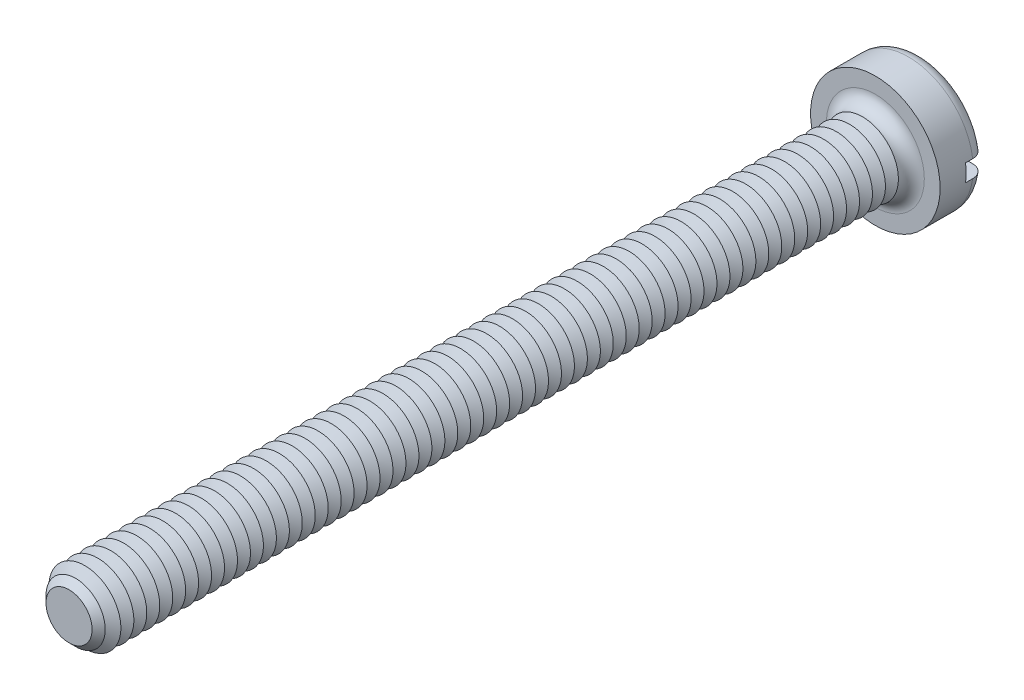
ISO-10303-21;
HEADER;
FILE_DESCRIPTION(('STEP AP214'),'2;1');
FILE_NAME('part.step','',(''),(''),'','','');
FILE_SCHEMA(('AUTOMOTIVE_DESIGN { 1 0 10303 214 1 1 1 1 }'));
ENDSEC;
DATA;
#1=APPLICATION_CONTEXT('core data for automotive mechanical design processes');
#2=APPLICATION_PROTOCOL_DEFINITION('international standard','automotive_design',2000,#1);
#3=PRODUCT_CONTEXT('',#1,'mechanical');
#4=PRODUCT('Part','Part','',(#3));
#5=PRODUCT_RELATED_PRODUCT_CATEGORY('part','',(#4));
#6=PRODUCT_DEFINITION_FORMATION('','',#4);
#7=PRODUCT_DEFINITION_CONTEXT('part definition',#1,'design');
#8=PRODUCT_DEFINITION('design','',#6,#7);
#9=PRODUCT_DEFINITION_SHAPE('','',#8);
#10=(LENGTH_UNIT() NAMED_UNIT(*) SI_UNIT(.MILLI.,.METRE.));
#11=(NAMED_UNIT(*) PLANE_ANGLE_UNIT() SI_UNIT($,.RADIAN.));
#12=(NAMED_UNIT(*) SI_UNIT($,.STERADIAN.) SOLID_ANGLE_UNIT());
#13=UNCERTAINTY_MEASURE_WITH_UNIT(LENGTH_MEASURE(1.E-05),#10,'distance_accuracy_value','');
#14=(GEOMETRIC_REPRESENTATION_CONTEXT(3) GLOBAL_UNCERTAINTY_ASSIGNED_CONTEXT((#13)) GLOBAL_UNIT_ASSIGNED_CONTEXT((#10,
#11,#12)) REPRESENTATION_CONTEXT('',''));
#15=CARTESIAN_POINT('',(0.,0.,0.));
#16=DIRECTION('',(0.,0.,1.));
#17=DIRECTION('',(1.,0.,0.));
#18=AXIS2_PLACEMENT_3D('',#15,#16,#17);
#19=CARTESIAN_POINT('',(0.,0.,-1.6));
#20=DIRECTION('',(0.,0.,1.));
#21=DIRECTION('',(1.,0.,0.));
#22=AXIS2_PLACEMENT_3D('',#19,#20,#21);
#23=PLANE('',#22);
#24=CARTESIAN_POINT('',(0.,0.,-1.6));
#25=DIRECTION('',(0.,0.,1.));
#26=DIRECTION('',(1.,0.,0.));
#27=AXIS2_PLACEMENT_3D('',#24,#25,#26);
#28=CIRCLE('',#27,1.8);
#29=CARTESIAN_POINT('',(-1.77482393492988,0.3,-1.6));
#30=VERTEX_POINT('',#29);
#31=CARTESIAN_POINT('',(1.77482393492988,0.3,-1.6));
#32=VERTEX_POINT('',#31);
#33=EDGE_CURVE('E116',#30,#32,#28,.F.);
#34=ORIENTED_EDGE('',*,*,#33,.T.);
#35=DIRECTION('',(1.,0.,0.));
#36=VECTOR('',#35,1.);
#37=CARTESIAN_POINT('',(-2.25,0.3,-1.6));
#38=LINE('',#37,#36);
#39=EDGE_CURVE('E111',#30,#32,#38,.T.);
#40=ORIENTED_EDGE('',*,*,#39,.F.);
#41=EDGE_LOOP('',(#34,#40));
#42=FACE_BOUND('',#41,.T.);
#43=ADVANCED_FACE('F39',(#42),#23,.F.);
#44=CARTESIAN_POINT('',(0.,0.,-1.15));
#45=DIRECTION('',(0.,0.,1.));
#46=DIRECTION('',(1.,0.,0.));
#47=AXIS2_PLACEMENT_3D('',#44,#45,#46);
#48=TOROIDAL_SURFACE('',#47,1.8,0.45);
#49=CARTESIAN_POINT('',(-2.09367249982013,0.3,-1.4713087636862));
#50=CARTESIAN_POINT('',(-2.07531034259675,0.3,-1.48912990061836));
#51=CARTESIAN_POINT('',(-2.05541605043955,0.3,-1.50540110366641));
#52=CARTESIAN_POINT('',(-2.01315405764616,0.3,-1.53437465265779));
#53=CARTESIAN_POINT('',(-1.99078310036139,0.3,-1.54707221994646));
#54=CARTESIAN_POINT('',(-1.94425163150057,0.3,-1.56853090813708));
#55=CARTESIAN_POINT('',(-1.92009286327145,0.3,-1.57729580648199));
#56=CARTESIAN_POINT('',(-1.8706617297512,0.3,-1.59068015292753));
#57=CARTESIAN_POINT('',(-1.84538964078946,0.3,-1.59530062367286));
#58=CARTESIAN_POINT('',(-1.7942134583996,0.3,-1.60031507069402));
#59=CARTESIAN_POINT('',(-1.76830582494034,0.3,-1.60067291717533));
#60=CARTESIAN_POINT('',(-1.71679040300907,0.3,-1.59707477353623));
#61=CARTESIAN_POINT('',(-1.69118264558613,0.3,-1.59311834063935));
#62=CARTESIAN_POINT('',(-1.64075792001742,0.3,-1.58095464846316));
#63=CARTESIAN_POINT('',(-1.61594989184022,0.3,-1.57271029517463));
#64=CARTESIAN_POINT('',(-1.56806655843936,0.3,-1.55217762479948));
#65=CARTESIAN_POINT('',(-1.54499130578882,0.3,-1.53988918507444));
#66=CARTESIAN_POINT('',(-1.50122413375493,0.3,-1.51158963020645));
#67=CARTESIAN_POINT('',(-1.48053389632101,0.3,-1.49557591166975));
#68=CARTESIAN_POINT('',(-1.44217532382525,0.3,-1.46026359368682));
#69=CARTESIAN_POINT('',(-1.42450683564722,0.3,-1.4409651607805));
#70=CARTESIAN_POINT('',(-1.39293961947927,0.3,-1.39986821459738));
#71=CARTESIAN_POINT('',(-1.37899788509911,0.3,-1.37810275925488));
#72=CARTESIAN_POINT('',(-1.35506190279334,0.3,-1.33249939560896));
#73=CARTESIAN_POINT('',(-1.34506709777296,0.3,-1.30866178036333));
#74=CARTESIAN_POINT('',(-1.3295415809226,0.3,-1.26015137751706));
#75=CARTESIAN_POINT('',(-1.32391771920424,0.3,-1.23550839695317));
#76=CARTESIAN_POINT('',(-1.31696995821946,0.3,-1.18562442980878));
#77=CARTESIAN_POINT('',(-1.31564552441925,0.3,-1.16038351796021));
#78=CARTESIAN_POINT('',(-1.31732714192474,0.3,-1.11049178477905));
#79=CARTESIAN_POINT('',(-1.32025766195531,0.3,-1.08583837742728));
#80=CARTESIAN_POINT('',(-1.3302124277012,0.3,-1.03737369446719));
#81=CARTESIAN_POINT('',(-1.33723664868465,0.3,-1.01356241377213));
#82=CARTESIAN_POINT('',(-1.35515820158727,0.3,-0.967413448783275));
#83=CARTESIAN_POINT('',(-1.36606032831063,0.3,-0.945077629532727));
#84=CARTESIAN_POINT('',(-1.39139351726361,0.3,-0.902507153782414));
#85=CARTESIAN_POINT('',(-1.40582489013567,0.3,-0.882272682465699));
#86=CARTESIAN_POINT('',(-1.43808691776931,0.3,-0.844072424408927));
#87=CARTESIAN_POINT('',(-1.4559757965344,0.3,-0.826155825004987));
#88=CARTESIAN_POINT('',(-1.49445205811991,0.3,-0.793502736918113));
#89=CARTESIAN_POINT('',(-1.51503974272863,0.3,-0.778766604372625));
#90=CARTESIAN_POINT('',(-1.55880475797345,0.3,-0.752571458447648));
#91=CARTESIAN_POINT('',(-1.58202794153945,0.3,-0.741189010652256));
#92=CARTESIAN_POINT('',(-1.63004083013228,0.3,-0.722432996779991));
#93=CARTESIAN_POINT('',(-1.65483064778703,0.3,-0.715059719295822));
#94=CARTESIAN_POINT('',(-1.70558060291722,0.3,-0.704463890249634));
#95=CARTESIAN_POINT('',(-1.73155090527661,0.3,-0.701289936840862));
#96=CARTESIAN_POINT('',(-1.78365633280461,0.3,-0.699350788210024));
#97=CARTESIAN_POINT('',(-1.80979145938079,0.3,-0.700585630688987));
#98=CARTESIAN_POINT('',(-1.86145503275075,0.3,-0.70744393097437));
#99=CARTESIAN_POINT('',(-1.88698403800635,0.3,-0.713063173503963));
#100=CARTESIAN_POINT('',(-1.93672112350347,0.3,-0.728546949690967));
#101=CARTESIAN_POINT('',(-1.96092925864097,0.3,-0.738411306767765));
#102=CARTESIAN_POINT('',(-2.00710191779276,0.3,-0.762015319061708));
#103=CARTESIAN_POINT('',(-2.02908465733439,0.3,-0.775719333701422));
#104=CARTESIAN_POINT('',(-2.0704025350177,0.3,-0.806663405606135));
#105=CARTESIAN_POINT('',(-2.08973782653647,0.3,-0.823903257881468));
#106=CARTESIAN_POINT('',(-2.12497879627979,0.3,-0.861218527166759));
#107=CARTESIAN_POINT('',(-2.1409209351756,0.3,-0.881259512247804));
#108=CARTESIAN_POINT('',(-2.16917502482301,0.3,-0.92375535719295));
#109=CARTESIAN_POINT('',(-2.18148717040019,0.3,-0.946210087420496));
#110=CARTESIAN_POINT('',(-2.20201023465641,0.3,-0.99266079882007));
#111=CARTESIAN_POINT('',(-2.21025973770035,0.3,-1.01663973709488));
#112=CARTESIAN_POINT('',(-2.22258852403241,0.3,-1.06564563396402));
#113=CARTESIAN_POINT('',(-2.22666813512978,0.3,-1.0906725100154));
#114=CARTESIAN_POINT('',(-2.23052418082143,0.3,-1.14090288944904));
#115=CARTESIAN_POINT('',(-2.23032644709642,0.3,-1.16610441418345));
#116=CARTESIAN_POINT('',(-2.22569614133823,0.3,-1.21612212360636));
#117=CARTESIAN_POINT('',(-2.2212625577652,0.3,-1.24093821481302));
#118=CARTESIAN_POINT('',(-2.20829785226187,0.3,-1.2894516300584));
#119=CARTESIAN_POINT('',(-2.19976997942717,0.3,-1.31314982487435));
#120=CARTESIAN_POINT('',(-2.17887390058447,0.3,-1.35876313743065));
#121=CARTESIAN_POINT('',(-2.1665103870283,0.3,-1.3806803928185));
#122=CARTESIAN_POINT('',(-2.14384463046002,0.3,-1.4140108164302));
#123=CARTESIAN_POINT('',(-2.13462949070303,0.3,-1.42617780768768));
#124=CARTESIAN_POINT('',(-2.1150151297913,0.3,-1.44951629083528));
#125=CARTESIAN_POINT('',(-2.10461591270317,0.3,-1.46068778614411));
#126=CARTESIAN_POINT('',(-2.09367249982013,0.3,-1.4713087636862));
#127=B_SPLINE_CURVE_WITH_KNOTS('',3,(#49,#50,#51,#52,#53,#54,#55,#56,#57,#58,#59,#60,#61,#62,
#63,#64,#65,#66,#67,#68,#69,#70,#71,#72,#73,#74,#75,#76,#77,#78,#79,#80,#81,#82,#83,#84,#85,#86,
#87,#88,#89,#90,#91,#92,#93,#94,#95,#96,#97,#98,#99,#100,#101,#102,#103,#104,#105,#106,#107,
#108,#109,#110,#111,#112,#113,#114,#115,#116,#117,#118,#119,#120,#121,#122,#123,#124,#125,#126),
.UNSPECIFIED.,.T.,.F.,(4,2,2,2,2,2,2,2,2,2,2,2,2,2,2,2,2,2,2,2,2,2,2,2,2,2,2,2,2,2,2,2,2,2,2,2,
2,2,4),(0.,0.0767085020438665,0.153519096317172,0.230255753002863,0.306973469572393,
0.384340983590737,0.461716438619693,0.539772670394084,0.617831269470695,0.695944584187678,
0.774053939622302,0.851218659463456,0.928372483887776,1.00383319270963,1.07928451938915,
1.15341274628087,1.22754052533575,1.30176027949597,1.37598656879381,1.45159320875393,
1.52720831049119,1.6044355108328,1.68166826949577,1.75978723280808,1.8379068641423,
1.91595148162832,1.99399285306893,2.07133254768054,2.14866775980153,2.22512456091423,
2.30157725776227,2.3772891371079,2.45299506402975,2.52824391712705,2.60351074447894,
2.67871794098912,2.75383349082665,2.79955010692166,2.84526656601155),.UNSPECIFIED.);
#128=CARTESIAN_POINT('',(-2.22991031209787,0.3,-1.14999999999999));
#129=VERTEX_POINT('',#128);
#130=EDGE_CURVE('E673',#129,#30,#127,.T.);
#131=ORIENTED_EDGE('',*,*,#130,.F.);
#132=CARTESIAN_POINT('',(0.,0.,-1.15));
#133=DIRECTION('',(0.,0.,1.));
#134=DIRECTION('',(1.,0.,0.));
#135=AXIS2_PLACEMENT_3D('',#132,#133,#134);
#136=CIRCLE('',#135,2.25);
#137=CARTESIAN_POINT('',(2.22991031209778,0.3,-1.15));
#138=VERTEX_POINT('',#137);
#139=EDGE_CURVE('E125',#138,#129,#136,.T.);
#140=ORIENTED_EDGE('',*,*,#139,.F.);
#141=CARTESIAN_POINT('',(1.39325818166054,0.3,-1.39903402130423));
#142=CARTESIAN_POINT('',(1.40771723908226,0.3,-1.42030595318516));
#143=CARTESIAN_POINT('',(1.4240122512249,0.3,-1.4403555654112));
#144=CARTESIAN_POINT('',(1.45976320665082,0.3,-1.4774406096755));
#145=CARTESIAN_POINT('',(1.47922380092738,0.3,-1.49447152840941));
#146=CARTESIAN_POINT('',(1.5206923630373,0.3,-1.52502510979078));
#147=CARTESIAN_POINT('',(1.54269721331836,0.3,-1.53855200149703));
#148=CARTESIAN_POINT('',(1.58863815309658,0.3,-1.56176272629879));
#149=CARTESIAN_POINT('',(1.61257369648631,0.3,-1.57144764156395));
#150=CARTESIAN_POINT('',(1.66199169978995,0.3,-1.58680804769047));
#151=CARTESIAN_POINT('',(1.68748839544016,0.3,-1.59243778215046));
#152=CARTESIAN_POINT('',(1.73906656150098,0.3,-1.59934902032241));
#153=CARTESIAN_POINT('',(1.76514807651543,0.3,-1.60063019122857));
#154=CARTESIAN_POINT('',(1.81721740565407,0.3,-1.59879130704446));
#155=CARTESIAN_POINT('',(1.84320486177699,0.3,-1.59566102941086));
#156=CARTESIAN_POINT('',(1.89427635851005,0.3,-1.58504931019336));
#157=CARTESIAN_POINT('',(1.91936042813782,0.3,-1.57756800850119));
#158=CARTESIAN_POINT('',(1.9677137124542,0.3,-1.55851722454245));
#159=CARTESIAN_POINT('',(1.99099484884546,0.3,-1.5469780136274));
#160=CARTESIAN_POINT('',(2.03525897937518,0.3,-1.52011224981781));
#161=CARTESIAN_POINT('',(2.05624211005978,0.3,-1.50478592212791));
#162=CARTESIAN_POINT('',(2.09506403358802,0.3,-1.47096472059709));
#163=CARTESIAN_POINT('',(2.11293536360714,0.3,-1.45250719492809));
#164=CARTESIAN_POINT('',(2.14528563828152,0.3,-1.41282609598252));
#165=CARTESIAN_POINT('',(2.15976477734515,0.3,-1.39160268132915));
#166=CARTESIAN_POINT('',(2.18476262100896,0.3,-1.34723254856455));
#167=CARTESIAN_POINT('',(2.19532119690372,0.3,-1.32410828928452));
#168=CARTESIAN_POINT('',(2.21237438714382,0.3,-1.27640693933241));
#169=CARTESIAN_POINT('',(2.21886918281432,0.3,-1.25182991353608));
#170=CARTESIAN_POINT('',(2.2275687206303,0.3,-1.20210937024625));
#171=CARTESIAN_POINT('',(2.22980376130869,0.3,-1.17697115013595));
#172=CARTESIAN_POINT('',(2.23000940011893,0.3,-1.12667754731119));
#173=CARTESIAN_POINT('',(2.22798009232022,0.3,-1.10152216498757));
#174=CARTESIAN_POINT('',(2.21972856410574,0.3,-1.05197773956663));
#175=CARTESIAN_POINT('',(2.21351744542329,0.3,-1.02758684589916));
#176=CARTESIAN_POINT('',(2.19709696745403,0.3,-0.980190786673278));
#177=CARTESIAN_POINT('',(2.18688760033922,0.3,-0.957185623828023));
#178=CARTESIAN_POINT('',(2.1627435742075,0.3,-0.913157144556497));
#179=CARTESIAN_POINT('',(2.14880093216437,0.3,-0.892138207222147));
#180=CARTESIAN_POINT('',(2.11760640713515,0.3,-0.852719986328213));
#181=CARTESIAN_POINT('',(2.10035443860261,0.3,-0.834320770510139));
#182=CARTESIAN_POINT('',(2.06291254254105,0.3,-0.80052923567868));
#183=CARTESIAN_POINT('',(2.04270386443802,0.3,-0.785157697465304));
#184=CARTESIAN_POINT('',(2.0000139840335,0.3,-0.757986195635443));
#185=CARTESIAN_POINT('',(1.97753267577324,0.3,-0.746186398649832));
#186=CARTESIAN_POINT('',(1.93069507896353,0.3,-0.726364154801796));
#187=CARTESIAN_POINT('',(1.90632219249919,0.3,-0.718380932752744));
#188=CARTESIAN_POINT('',(1.85658993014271,0.3,-0.706569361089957));
#189=CARTESIAN_POINT('',(1.83123049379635,0.3,-0.702741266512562));
#190=CARTESIAN_POINT('',(1.77994107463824,0.3,-0.699306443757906));
#191=CARTESIAN_POINT('',(1.75400788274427,0.3,-0.69974759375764));
#192=CARTESIAN_POINT('',(1.70257608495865,0.3,-0.704939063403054));
#193=CARTESIAN_POINT('',(1.67707750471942,0.3,-0.709689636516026));
#194=CARTESIAN_POINT('',(1.62701662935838,0.3,-0.723419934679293));
#195=CARTESIAN_POINT('',(1.60246387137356,0.3,-0.732434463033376));
#196=CARTESIAN_POINT('',(1.55521886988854,0.3,-0.754458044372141));
#197=CARTESIAN_POINT('',(1.53252668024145,0.3,-0.76746721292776));
#198=CARTESIAN_POINT('',(1.48966925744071,0.3,-0.797124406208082));
#199=CARTESIAN_POINT('',(1.46950315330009,0.3,-0.813771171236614));
#200=CARTESIAN_POINT('',(1.43229728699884,0.3,-0.850255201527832));
#201=CARTESIAN_POINT('',(1.41525734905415,0.3,-0.870092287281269));
#202=CARTESIAN_POINT('',(1.3850470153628,0.3,-0.912123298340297));
#203=CARTESIAN_POINT('',(1.37182821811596,0.3,-0.934282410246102));
#204=CARTESIAN_POINT('',(1.34939737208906,0.3,-0.980542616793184));
#205=CARTESIAN_POINT('',(1.34018456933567,0.3,-1.00464334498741));
#206=CARTESIAN_POINT('',(1.32624172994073,0.3,-1.05352472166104));
#207=CARTESIAN_POINT('',(1.32141599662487,0.3,-1.07827808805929));
#208=CARTESIAN_POINT('',(1.31606478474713,0.3,-1.12825155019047));
#209=CARTESIAN_POINT('',(1.31553992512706,0.3,-1.15347171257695));
#210=CARTESIAN_POINT('',(1.31878307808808,0.3,-1.20323022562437));
#211=CARTESIAN_POINT('',(1.32248353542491,0.3,-1.22777305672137));
#212=CARTESIAN_POINT('',(1.33394086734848,0.3,-1.27586981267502));
#213=CARTESIAN_POINT('',(1.34169274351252,0.3,-1.2994249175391));
#214=CARTESIAN_POINT('',(1.35704250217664,0.3,-1.33561898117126));
#215=CARTESIAN_POINT('',(1.36341395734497,0.3,-1.34879219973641));
#216=CARTESIAN_POINT('',(1.37741190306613,0.3,-1.37445328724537));
#217=CARTESIAN_POINT('',(1.38503837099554,0.3,-1.38694116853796));
#218=CARTESIAN_POINT('',(1.39325818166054,0.3,-1.39903402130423));
#219=B_SPLINE_CURVE_WITH_KNOTS('',3,(#141,#142,#143,#144,#145,#146,#147,#148,#149,#150,#151,
#152,#153,#154,#155,#156,#157,#158,#159,#160,#161,#162,#163,#164,#165,#166,#167,#168,#169,#170,
#171,#172,#173,#174,#175,#176,#177,#178,#179,#180,#181,#182,#183,#184,#185,#186,#187,#188,#189,
#190,#191,#192,#193,#194,#195,#196,#197,#198,#199,#200,#201,#202,#203,#204,#205,#206,#207,#208,
#209,#210,#211,#212,#213,#214,#215,#216,#217,#218),.UNSPECIFIED.,.T.,.F.,(4,2,2,2,2,2,2,2,2,2,2,
2,2,2,2,2,2,2,2,2,2,2,2,2,2,2,2,2,2,2,2,2,2,2,2,2,2,2,4),(0.,0.0771077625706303,
0.154329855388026,0.231458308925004,0.308565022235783,0.386528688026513,0.464498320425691,
0.542648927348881,0.620797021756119,0.698374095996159,0.77594655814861,0.852651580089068,
0.929352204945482,1.00524992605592,1.08114426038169,1.15649673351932,1.2318475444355,
1.30699910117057,1.38215080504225,1.45746451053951,1.53278016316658,1.60859599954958,
1.68441537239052,1.76099806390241,1.83758545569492,1.91503273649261,1.99248457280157,
2.07057979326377,2.14867727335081,2.22674775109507,2.30481383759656,2.38184276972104,
2.45885719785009,2.53414829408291,2.6094502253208,2.68356487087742,2.75758829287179,
2.80142397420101,2.84525886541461),.UNSPECIFIED.);
#220=EDGE_CURVE('E675',#32,#138,#219,.T.);
#221=ORIENTED_EDGE('',*,*,#220,.F.);
#222=ORIENTED_EDGE('',*,*,#33,.F.);
#223=EDGE_LOOP('',(#131,#140,#221,#222));
#224=FACE_BOUND('',#223,.T.);
#225=ADVANCED_FACE('F657',(#224),#48,.T.);
#226=CARTESIAN_POINT('',(0.,0.,-1.6));
#227=DIRECTION('',(0.,0.,1.));
#228=DIRECTION('',(1.,0.,0.));
#229=AXIS2_PLACEMENT_3D('',#226,#227,#228);
#230=CYLINDRICAL_SURFACE('',#229,2.25);
#231=DIRECTION('',(0.,0.,1.));
#232=VECTOR('',#231,1.);
#233=CARTESIAN_POINT('',(2.22991031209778,0.3,-1.6));
#234=LINE('',#233,#232);
#235=CARTESIAN_POINT('',(2.22991031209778,0.3,-0.9));
#236=VERTEX_POINT('',#235);
#237=EDGE_CURVE('E691',#138,#236,#234,.T.);
#238=ORIENTED_EDGE('',*,*,#237,.F.);
#239=ORIENTED_EDGE('',*,*,#139,.T.);
#240=DIRECTION('',(0.,0.,1.));
#241=VECTOR('',#240,1.);
#242=CARTESIAN_POINT('',(-2.22991031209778,0.3,-1.6));
#243=LINE('',#242,#241);
#244=CARTESIAN_POINT('',(-2.22991031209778,0.3,-0.9));
#245=VERTEX_POINT('',#244);
#246=EDGE_CURVE('E63',#245,#129,#243,.F.);
#247=ORIENTED_EDGE('',*,*,#246,.F.);
#248=CARTESIAN_POINT('',(0.,0.,-0.9));
#249=DIRECTION('',(0.,0.,-1.));
#250=DIRECTION('',(-1.,0.,0.));
#251=AXIS2_PLACEMENT_3D('',#248,#249,#250);
#252=CIRCLE('',#251,2.25);
#253=CARTESIAN_POINT('',(-2.22991031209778,-0.3,-0.9));
#254=VERTEX_POINT('',#253);
#255=EDGE_CURVE('E43',#245,#254,#252,.F.);
#256=ORIENTED_EDGE('',*,*,#255,.T.);
#257=DIRECTION('',(0.,0.,1.));
#258=VECTOR('',#257,1.);
#259=CARTESIAN_POINT('',(-2.22991031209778,-0.3,-1.6));
#260=LINE('',#259,#258);
#261=CARTESIAN_POINT('',(-2.22991031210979,-0.3,-1.15000000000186));
#262=VERTEX_POINT('',#261);
#263=EDGE_CURVE('E688',#262,#254,#260,.T.);
#264=ORIENTED_EDGE('',*,*,#263,.F.);
#265=CARTESIAN_POINT('',(2.22991031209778,-0.3,-1.15));
#266=VERTEX_POINT('',#265);
#267=EDGE_CURVE('E127',#262,#266,#136,.T.);
#268=ORIENTED_EDGE('',*,*,#267,.T.);
#269=DIRECTION('',(0.,0.,1.));
#270=VECTOR('',#269,1.);
#271=CARTESIAN_POINT('',(2.22991031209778,-0.3,-1.6));
#272=LINE('',#271,#270);
#273=CARTESIAN_POINT('',(2.22991031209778,-0.3,-0.9));
#274=VERTEX_POINT('',#273);
#275=EDGE_CURVE('E55',#274,#266,#272,.F.);
#276=ORIENTED_EDGE('',*,*,#275,.F.);
#277=EDGE_CURVE('E11',#274,#236,#252,.F.);
#278=ORIENTED_EDGE('',*,*,#277,.T.);
#279=EDGE_LOOP('',(#238,#239,#247,#256,#264,#268,#276,#278));
#280=FACE_BOUND('',#279,.T.);
#281=CARTESIAN_POINT('',(0.,0.,0.));
#282=DIRECTION('',(0.,0.,1.));
#283=DIRECTION('',(1.,0.,0.));
#284=AXIS2_PLACEMENT_3D('',#281,#282,#283);
#285=CIRCLE('',#284,2.25);
#286=CARTESIAN_POINT('',(2.25,0.,0.));
#287=VERTEX_POINT('',#286);
#288=EDGE_CURVE('E693',#287,#287,#285,.T.);
#289=ORIENTED_EDGE('',*,*,#288,.F.);
#290=EDGE_LOOP('',(#289));
#291=FACE_BOUND('',#290,.T.);
#292=ADVANCED_FACE('F653',(#280,#291),#230,.T.);
#293=CARTESIAN_POINT('',(1.77482393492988,-0.3,-1.6));
#294=VERTEX_POINT('',#293);
#295=CARTESIAN_POINT('',(-1.77482393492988,-0.3,-1.6));
#296=VERTEX_POINT('',#295);
#297=EDGE_CURVE('E109',#294,#296,#28,.F.);
#298=ORIENTED_EDGE('',*,*,#297,.T.);
#299=DIRECTION('',(-1.,0.,0.));
#300=VECTOR('',#299,1.);
#301=CARTESIAN_POINT('',(-2.25,-0.3,-1.6));
#302=LINE('',#301,#300);
#303=EDGE_CURVE('E96',#294,#296,#302,.T.);
#304=ORIENTED_EDGE('',*,*,#303,.F.);
#305=EDGE_LOOP('',(#298,#304));
#306=FACE_BOUND('',#305,.T.);
#307=ADVANCED_FACE('F108',(#306),#23,.F.);
#308=CARTESIAN_POINT('',(0.,0.,0.));
#309=DIRECTION('',(0.,0.,1.));
#310=DIRECTION('',(1.,0.,0.));
#311=AXIS2_PLACEMENT_3D('',#308,#309,#310);
#312=PLANE('',#311);
#313=CARTESIAN_POINT('',(0.,0.,0.));
#314=DIRECTION('',(0.,0.,1.));
#315=DIRECTION('',(1.,0.,0.));
#316=AXIS2_PLACEMENT_3D('',#313,#314,#315);
#317=CIRCLE('',#316,1.7);
#318=CARTESIAN_POINT('',(1.7,0.,0.));
#319=VERTEX_POINT('',#318);
#320=EDGE_CURVE('E115',#319,#319,#317,.F.);
#321=ORIENTED_EDGE('',*,*,#320,.T.);
#322=EDGE_LOOP('',(#321));
#323=FACE_BOUND('',#322,.T.);
#324=ORIENTED_EDGE('',*,*,#288,.T.);
#325=EDGE_LOOP('',(#324));
#326=FACE_BOUND('',#325,.T.);
#327=ADVANCED_FACE('F652',(#323,#326),#312,.T.);
#328=CARTESIAN_POINT('',(-2.09367249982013,-0.3,-1.4713087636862));
#329=CARTESIAN_POINT('',(-2.11176539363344,-0.3,-1.45374579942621));
#330=CARTESIAN_POINT('',(-2.1283968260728,-0.3,-1.43465254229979));
#331=CARTESIAN_POINT('',(-2.15823692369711,-0.3,-1.39393307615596));
#332=CARTESIAN_POINT('',(-2.17144184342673,-0.3,-1.37230413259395));
#333=CARTESIAN_POINT('',(-2.19402281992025,-0.3,-1.32713362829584));
#334=CARTESIAN_POINT('',(-2.20339951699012,-0.3,-1.30359238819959));
#335=CARTESIAN_POINT('',(-2.21804409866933,-0.3,-1.25527081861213));
#336=CARTESIAN_POINT('',(-2.22331295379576,-0.3,-1.23049078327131));
#337=CARTESIAN_POINT('',(-2.22957448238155,-0.3,-1.18050893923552));
#338=CARTESIAN_POINT('',(-2.23058617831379,-0.3,-1.15530951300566));
#339=CARTESIAN_POINT('',(-2.22835535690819,-0.3,-1.10509920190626));
#340=CARTESIAN_POINT('',(-2.22511277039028,-0.3,-1.08008832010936));
#341=CARTESIAN_POINT('',(-2.21448018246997,-0.3,-1.03101646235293));
#342=CARTESIAN_POINT('',(-2.20709836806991,-0.3,-1.00695371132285));
#343=CARTESIAN_POINT('',(-2.18841075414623,-0.3,-0.960404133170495));
#344=CARTESIAN_POINT('',(-2.17710493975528,-0.3,-0.937917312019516));
#345=CARTESIAN_POINT('',(-2.15086234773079,-0.3,-0.895085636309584));
#346=CARTESIAN_POINT('',(-2.13591537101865,-0.3,-0.874747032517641));
#347=CARTESIAN_POINT('',(-2.1028415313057,-0.3,-0.836845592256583));
#348=CARTESIAN_POINT('',(-2.08471458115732,-0.3,-0.819282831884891));
#349=CARTESIAN_POINT('',(-2.0456590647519,-0.3,-0.78729174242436));
#350=CARTESIAN_POINT('',(-2.0247112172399,-0.3,-0.772886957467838));
#351=CARTESIAN_POINT('',(-1.98071452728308,-0.3,-0.747756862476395));
#352=CARTESIAN_POINT('',(-1.95766557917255,-0.3,-0.737031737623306));
#353=CARTESIAN_POINT('',(-1.90986554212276,-0.3,-0.71944451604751));
#354=CARTESIAN_POINT('',(-1.88509923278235,-0.3,-0.712623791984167));
#355=CARTESIAN_POINT('',(-1.83477837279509,-0.3,-0.703186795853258));
#356=CARTESIAN_POINT('',(-1.80922377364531,-0.3,-0.700570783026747));
#357=CARTESIAN_POINT('',(-1.75774893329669,-0.3,-0.699591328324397));
#358=CARTESIAN_POINT('',(-1.73182778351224,-0.3,-0.701275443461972));
#359=CARTESIAN_POINT('',(-1.68062744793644,-0.3,-0.708937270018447));
#360=CARTESIAN_POINT('',(-1.65534829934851,-0.3,-0.714915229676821));
#361=CARTESIAN_POINT('',(-1.6059539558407,-0.3,-0.731056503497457));
#362=CARTESIAN_POINT('',(-1.58184881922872,-0.3,-0.741250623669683));
#363=CARTESIAN_POINT('',(-1.53569497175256,-0.3,-0.765548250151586));
#364=CARTESIAN_POINT('',(-1.51364629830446,-0.3,-0.779651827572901));
#365=CARTESIAN_POINT('',(-1.47229470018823,-0.3,-0.811355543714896));
#366=CARTESIAN_POINT('',(-1.45298625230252,-0.3,-0.828948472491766));
#367=CARTESIAN_POINT('',(-1.41765142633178,-0.3,-0.867170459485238));
#368=CARTESIAN_POINT('',(-1.40162480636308,-0.3,-0.887799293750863));
#369=CARTESIAN_POINT('',(-1.37358365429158,-0.3,-0.93118317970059));
#370=CARTESIAN_POINT('',(-1.3615121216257,-0.3,-0.953901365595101));
#371=CARTESIAN_POINT('',(-1.34145576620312,-0.3,-1.00107529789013));
#372=CARTESIAN_POINT('',(-1.33347032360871,-0.3,-1.02553078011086));
#373=CARTESIAN_POINT('',(-1.32199536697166,-0.3,-1.07489401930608));
#374=CARTESIAN_POINT('',(-1.31840873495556,-0.3,-1.09977921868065));
#375=CARTESIAN_POINT('',(-1.31553052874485,-0.3,-1.1497957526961));
#376=CARTESIAN_POINT('',(-1.31623852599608,-0.3,-1.17492706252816));
#377=CARTESIAN_POINT('',(-1.32188368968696,-0.3,-1.22435119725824));
#378=CARTESIAN_POINT('',(-1.32676151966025,-0.3,-1.24865083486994));
#379=CARTESIAN_POINT('',(-1.34050334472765,-0.3,-1.29609421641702));
#380=CARTESIAN_POINT('',(-1.34936742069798,-0.3,-1.31923793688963));
#381=CARTESIAN_POINT('',(-1.37086295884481,-0.3,-1.36387796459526));
#382=CARTESIAN_POINT('',(-1.38351729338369,-0.3,-1.38536324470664));
#383=CARTESIAN_POINT('',(-1.41218367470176,-0.3,-1.42596199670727));
#384=CARTESIAN_POINT('',(-1.42819606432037,-0.3,-1.44507522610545));
#385=CARTESIAN_POINT('',(-1.46347664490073,-0.3,-1.48081087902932));
#386=CARTESIAN_POINT('',(-1.48280543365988,-0.3,-1.49737347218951));
#387=CARTESIAN_POINT('',(-1.5239232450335,-0.3,-1.52709508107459));
#388=CARTESIAN_POINT('',(-1.54571253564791,-0.3,-1.54025372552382));
#389=CARTESIAN_POINT('',(-1.59160097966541,-0.3,-1.56305446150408));
#390=CARTESIAN_POINT('',(-1.61573734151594,-0.3,-1.57262172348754));
#391=CARTESIAN_POINT('',(-1.66526504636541,-0.3,-1.58760700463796));
#392=CARTESIAN_POINT('',(-1.69065641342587,-0.3,-1.59302494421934));
#393=CARTESIAN_POINT('',(-1.74220154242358,-0.3,-1.59958446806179));
#394=CARTESIAN_POINT('',(-1.7683598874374,-0.3,-1.60069012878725));
#395=CARTESIAN_POINT('',(-1.82049681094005,-0.3,-1.59847888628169));
#396=CARTESIAN_POINT('',(-1.8464753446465,-0.3,-1.59516091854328));
#397=CARTESIAN_POINT('',(-1.89742078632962,-0.3,-1.58419269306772));
#398=CARTESIAN_POINT('',(-1.92239041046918,-0.3,-1.57655503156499));
#399=CARTESIAN_POINT('',(-1.97064988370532,-0.3,-1.55715679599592));
#400=CARTESIAN_POINT('',(-1.99394179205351,-0.3,-1.54540138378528));
#401=CARTESIAN_POINT('',(-2.03003215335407,-0.3,-1.52312594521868));
#402=CARTESIAN_POINT('',(-2.04354254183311,-0.3,-1.51373809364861));
#403=CARTESIAN_POINT('',(-2.06946640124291,-0.3,-1.49355310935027));
#404=CARTESIAN_POINT('',(-2.08187987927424,-0.3,-1.48275598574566));
#405=CARTESIAN_POINT('',(-2.09367249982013,-0.3,-1.4713087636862));
#406=B_SPLINE_CURVE_WITH_KNOTS('',3,(#328,#329,#330,#331,#332,#333,#334,#335,#336,#337,#338,
#339,#340,#341,#342,#343,#344,#345,#346,#347,#348,#349,#350,#351,#352,#353,#354,#355,#356,#357,
#358,#359,#360,#361,#362,#363,#364,#365,#366,#367,#368,#369,#370,#371,#372,#373,#374,#375,#376,
#377,#378,#379,#380,#381,#382,#383,#384,#385,#386,#387,#388,#389,#390,#391,#392,#393,#394,#395,
#396,#397,#398,#399,#400,#401,#402,#403,#404,#405),.UNSPECIFIED.,.T.,.F.,(4,2,2,2,2,2,2,2,2,2,2,
2,2,2,2,2,2,2,2,2,2,2,2,2,2,2,2,2,2,2,2,2,2,2,2,2,2,2,4),(0.,0.0755864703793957,
0.151255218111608,0.226911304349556,0.302549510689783,0.377849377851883,0.453150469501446,
0.528303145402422,0.603456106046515,0.67882204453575,0.754190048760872,0.83010216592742,
0.906018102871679,0.982724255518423,1.05943513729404,1.13699806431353,1.21456547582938,
1.29270994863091,1.37085584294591,1.44884191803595,1.52682224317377,1.60362346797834,
1.68041303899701,1.75547480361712,1.83052907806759,1.90453278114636,1.97853798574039,
2.05299909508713,2.12746781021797,2.20347986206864,2.27950020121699,2.3570265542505,
2.43455439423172,2.5127267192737,2.59091785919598,2.66888216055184,2.74674907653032,
2.79601528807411,2.84528118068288),.UNSPECIFIED.);
#407=EDGE_CURVE('E103',#296,#262,#406,.T.);
#408=ORIENTED_EDGE('',*,*,#407,.F.);
#409=ORIENTED_EDGE('',*,*,#297,.F.);
#410=CARTESIAN_POINT('',(1.39325818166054,-0.3,-1.39903402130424));
#411=CARTESIAN_POINT('',(1.37924349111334,-0.3,-1.37841200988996));
#412=CARTESIAN_POINT('',(1.36693374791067,-0.3,-1.35661225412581));
#413=CARTESIAN_POINT('',(1.34612289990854,-0.3,-1.31124547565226));
#414=CARTESIAN_POINT('',(1.33762533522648,-0.3,-1.28767683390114));
#415=CARTESIAN_POINT('',(1.32472877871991,-0.3,-1.23943261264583));
#416=CARTESIAN_POINT('',(1.3203309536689,-0.3,-1.21475672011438));
#417=CARTESIAN_POINT('',(1.31579198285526,-0.3,-1.16502199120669));
#418=CARTESIAN_POINT('',(1.31564980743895,-0.3,-1.13996324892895));
#419=CARTESIAN_POINT('',(1.31960322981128,-0.3,-1.09044336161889));
#420=CARTESIAN_POINT('',(1.32365524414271,-0.3,-1.06597872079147));
#421=CARTESIAN_POINT('',(1.33579339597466,-0.3,-1.01807218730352));
#422=CARTESIAN_POINT('',(1.34387971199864,-0.3,-0.994630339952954));
#423=CARTESIAN_POINT('',(1.36386460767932,-0.3,-0.949319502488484));
#424=CARTESIAN_POINT('',(1.37577869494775,-0.3,-0.92745736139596));
#425=CARTESIAN_POINT('',(1.40303929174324,-0.3,-0.885990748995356));
#426=CARTESIAN_POINT('',(1.41838612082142,-0.3,-0.866386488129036));
#427=CARTESIAN_POINT('',(1.45239955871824,-0.3,-0.829572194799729));
#428=CARTESIAN_POINT('',(1.47112624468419,-0.3,-0.812417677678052));
#429=CARTESIAN_POINT('',(1.51114353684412,-0.3,-0.78141873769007));
#430=CARTESIAN_POINT('',(1.53243442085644,-0.3,-0.767574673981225));
#431=CARTESIAN_POINT('',(1.57744959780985,-0.3,-0.743302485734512));
#432=CARTESIAN_POINT('',(1.6012148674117,-0.3,-0.732950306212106));
#433=CARTESIAN_POINT('',(1.65013556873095,-0.3,-0.71633816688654));
#434=CARTESIAN_POINT('',(1.67529109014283,-0.3,-0.710078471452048));
#435=CARTESIAN_POINT('',(1.72654223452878,-0.3,-0.701786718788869));
#436=CARTESIAN_POINT('',(1.75264462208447,-0.3,-0.699796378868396));
#437=CARTESIAN_POINT('',(1.80481283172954,-0.3,-0.700236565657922));
#438=CARTESIAN_POINT('',(1.83087865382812,-0.3,-0.702667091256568));
#439=CARTESIAN_POINT('',(1.88216421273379,-0.3,-0.71188843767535));
#440=CARTESIAN_POINT('',(1.90738581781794,-0.3,-0.718668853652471));
#441=CARTESIAN_POINT('',(1.95631449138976,-0.3,-0.736408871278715));
#442=CARTESIAN_POINT('',(1.98002162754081,-0.3,-0.747368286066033));
#443=CARTESIAN_POINT('',(2.02500221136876,-0.3,-0.773046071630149));
#444=CARTESIAN_POINT('',(2.04629687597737,-0.3,-0.78772726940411));
#445=CARTESIAN_POINT('',(2.08608258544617,-0.3,-0.820494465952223));
#446=CARTESIAN_POINT('',(2.10457379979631,-0.3,-0.838580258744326));
#447=CARTESIAN_POINT('',(2.1380062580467,-0.3,-0.877422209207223));
#448=CARTESIAN_POINT('',(2.15298532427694,-0.3,-0.898145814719));
#449=CARTESIAN_POINT('',(2.17921311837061,-0.3,-0.941832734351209));
#450=CARTESIAN_POINT('',(2.19046204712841,-0.3,-0.964795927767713));
#451=CARTESIAN_POINT('',(2.20880507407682,-0.3,-1.01207981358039));
#452=CARTESIAN_POINT('',(2.2159367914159,-0.3,-1.0363859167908));
#453=CARTESIAN_POINT('',(2.22599386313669,-0.3,-1.08585317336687));
#454=CARTESIAN_POINT('',(2.22891936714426,-0.3,-1.11101429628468));
#455=CARTESIAN_POINT('',(2.23047255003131,-0.3,-1.16133395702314));
#456=CARTESIAN_POINT('',(2.22912306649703,-0.3,-1.18649179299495));
#457=CARTESIAN_POINT('',(2.22221641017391,-0.3,-1.236222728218));
#458=CARTESIAN_POINT('',(2.21665928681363,-0.3,-1.26079583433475));
#459=CARTESIAN_POINT('',(2.20150655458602,-0.3,-1.30864604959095));
#460=CARTESIAN_POINT('',(2.19191347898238,-0.3,-1.3319239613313));
#461=CARTESIAN_POINT('',(2.16897085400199,-0.3,-1.37654778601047));
#462=CARTESIAN_POINT('',(2.15562126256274,-0.3,-1.39789367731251));
#463=CARTESIAN_POINT('',(2.12549147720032,-0.3,-1.43814583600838));
#464=CARTESIAN_POINT('',(2.1086973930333,-0.3,-1.45704170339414));
#465=CARTESIAN_POINT('',(2.07219852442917,-0.3,-1.491773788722));
#466=CARTESIAN_POINT('',(2.0524936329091,-0.3,-1.50760989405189));
#467=CARTESIAN_POINT('',(2.01056127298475,-0.3,-1.53591667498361));
#468=CARTESIAN_POINT('',(1.98831430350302,-0.3,-1.54835845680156));
#469=CARTESIAN_POINT('',(1.94206418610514,-0.3,-1.5693763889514));
#470=CARTESIAN_POINT('',(1.91806093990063,-0.3,-1.57795232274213));
#471=CARTESIAN_POINT('',(1.86869953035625,-0.3,-1.5910955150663));
#472=CARTESIAN_POINT('',(1.84332941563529,-0.3,-1.59561788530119));
#473=CARTESIAN_POINT('',(1.7921914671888,-0.3,-1.60038767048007));
#474=CARTESIAN_POINT('',(1.76642362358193,-0.3,-1.60063497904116));
#475=CARTESIAN_POINT('',(1.71493241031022,-0.3,-1.59684388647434));
#476=CARTESIAN_POINT('',(1.6892123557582,-0.3,-1.59276040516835));
#477=CARTESIAN_POINT('',(1.63880694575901,-0.3,-1.58035661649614));
#478=CARTESIAN_POINT('',(1.61412189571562,-0.3,-1.5720350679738));
#479=CARTESIAN_POINT('',(1.56635013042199,-0.3,-1.55132424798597));
#480=CARTESIAN_POINT('',(1.54327365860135,-0.3,-1.53891136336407));
#481=CARTESIAN_POINT('',(1.49956705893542,-0.3,-1.51037484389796));
#482=CARTESIAN_POINT('',(1.478934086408,-0.3,-1.49425558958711));
#483=CARTESIAN_POINT('',(1.44732882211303,-0.3,-1.46489751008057));
#484=CARTESIAN_POINT('',(1.43548118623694,-0.3,-1.45258668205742));
#485=CARTESIAN_POINT('',(1.41324217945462,-0.3,-1.42671249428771));
#486=CARTESIAN_POINT('',(1.40285079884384,-0.3,-1.41314914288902));
#487=CARTESIAN_POINT('',(1.39325818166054,-0.3,-1.39903402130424));
#488=B_SPLINE_CURVE_WITH_KNOTS('',3,(#410,#411,#412,#413,#414,#415,#416,#417,#418,#419,#420,
#421,#422,#423,#424,#425,#426,#427,#428,#429,#430,#431,#432,#433,#434,#435,#436,#437,#438,#439,
#440,#441,#442,#443,#444,#445,#446,#447,#448,#449,#450,#451,#452,#453,#454,#455,#456,#457,#458,
#459,#460,#461,#462,#463,#464,#465,#466,#467,#468,#469,#470,#471,#472,#473,#474,#475,#476,#477,
#478,#479,#480,#481,#482,#483,#484,#485,#486,#487),.UNSPECIFIED.,.T.,.F.,(4,2,2,2,2,2,2,2,2,2,2,
2,2,2,2,2,2,2,2,2,2,2,2,2,2,2,2,2,2,2,2,2,2,2,2,2,2,2,4),(0.,0.0747398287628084,
0.149548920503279,0.224379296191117,0.29919156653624,0.373234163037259,0.447280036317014,
0.521629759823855,0.595986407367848,0.671825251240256,0.747672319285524,0.825076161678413,
0.902485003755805,0.980646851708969,1.05880868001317,1.13678424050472,1.21475631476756,
1.29197834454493,1.36919570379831,1.44553881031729,1.52187780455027,1.59750777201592,
1.67313504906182,1.74835899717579,1.82358206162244,1.89875798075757,1.97393474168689,
2.04942084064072,2.12490971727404,2.20102244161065,2.27713942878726,2.35408926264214,
2.43104101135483,2.50880170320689,2.58658518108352,2.66482568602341,2.74297419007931,
2.79413160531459,2.84528867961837),.UNSPECIFIED.);
#489=EDGE_CURVE('E92',#266,#294,#488,.T.);
#490=ORIENTED_EDGE('',*,*,#489,.F.);
#491=ORIENTED_EDGE('',*,*,#267,.F.);
#492=EDGE_LOOP('',(#408,#409,#490,#491));
#493=FACE_BOUND('',#492,.T.);
#494=ADVANCED_FACE('F113',(#493),#48,.T.);
#495=CARTESIAN_POINT('',(0.,0.,0.449999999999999));
#496=DIRECTION('',(0.,0.,1.));
#497=DIRECTION('',(1.,0.,0.));
#498=AXIS2_PLACEMENT_3D('',#495,#496,#497);
#499=TOROIDAL_SURFACE('',#498,1.7,0.45);
#500=ORIENTED_EDGE('',*,*,#320,.F.);
#501=EDGE_LOOP('',(#500));
#502=FACE_BOUND('',#501,.T.);
#503=CARTESIAN_POINT('',(0.,0.,0.449999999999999));
#504=DIRECTION('',(0.,0.,-1.));
#505=DIRECTION('',(-1.,0.,0.));
#506=AXIS2_PLACEMENT_3D('',#503,#504,#505);
#507=CIRCLE('',#506,1.25);
#508=CARTESIAN_POINT('',(-1.25,0.,0.449999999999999));
#509=VERTEX_POINT('',#508);
#510=EDGE_CURVE('E698',#509,#509,#507,.T.);
#511=ORIENTED_EDGE('',*,*,#510,.T.);
#512=EDGE_LOOP('',(#511));
#513=FACE_BOUND('',#512,.T.);
#514=ADVANCED_FACE('F645',(#502,#513),#499,.F.);
#515=CARTESIAN_POINT('',(0.,0.,0.674999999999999));
#516=DIRECTION('',(0.,0.,-1.));
#517=DIRECTION('',(-1.,0.,0.));
#518=AXIS2_PLACEMENT_3D('',#515,#516,#517);
#519=CONICAL_SURFACE('',#518,0.860288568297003,1.0471975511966);
#520=ORIENTED_EDGE('',*,*,#510,.F.);
#521=EDGE_LOOP('',(#520));
#522=FACE_BOUND('',#521,.T.);
#523=CARTESIAN_POINT('',(0.,0.,0.674999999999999));
#524=DIRECTION('',(0.,0.,-1.));
#525=DIRECTION('',(-1.,0.,0.));
#526=AXIS2_PLACEMENT_3D('',#523,#524,#525);
#527=CIRCLE('',#526,0.860288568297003);
#528=CARTESIAN_POINT('',(-0.860288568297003,0.,0.674999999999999));
#529=VERTEX_POINT('',#528);
#530=EDGE_CURVE('E705',#529,#529,#527,.T.);
#531=ORIENTED_EDGE('',*,*,#530,.T.);
#532=EDGE_LOOP('',(#531));
#533=FACE_BOUND('',#532,.T.);
#534=ADVANCED_FACE('F641',(#522,#533),#519,.T.);
#535=CARTESIAN_POINT('',(0.,0.,0.899999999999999));
#536=DIRECTION('',(0.,0.,1.));
#537=DIRECTION('',(1.,0.,0.));
#538=AXIS2_PLACEMENT_3D('',#535,#536,#537);
#539=CONICAL_SURFACE('',#538,1.25,1.0471975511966);
#540=ORIENTED_EDGE('',*,*,#530,.F.);
#541=EDGE_LOOP('',(#540));
#542=FACE_BOUND('',#541,.T.);
#543=CARTESIAN_POINT('',(0.,0.,0.899999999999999));
#544=DIRECTION('',(0.,0.,-1.));
#545=DIRECTION('',(-1.,0.,0.));
#546=AXIS2_PLACEMENT_3D('',#543,#544,#545);
#547=CIRCLE('',#546,1.25);
#548=CARTESIAN_POINT('',(-1.25,0.,0.899999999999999));
#549=VERTEX_POINT('',#548);
#550=EDGE_CURVE('E711',#549,#549,#547,.T.);
#551=ORIENTED_EDGE('',*,*,#550,.T.);
#552=EDGE_LOOP('',(#551));
#553=FACE_BOUND('',#552,.T.);
#554=ADVANCED_FACE('F637',(#542,#553),#539,.T.);
#555=CARTESIAN_POINT('',(0.,0.,1.125));
#556=DIRECTION('',(0.,0.,-1.));
#557=DIRECTION('',(-1.,0.,0.));
#558=AXIS2_PLACEMENT_3D('',#555,#556,#557);
#559=CONICAL_SURFACE('',#558,0.860288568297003,1.0471975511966);
#560=ORIENTED_EDGE('',*,*,#550,.F.);
#561=EDGE_LOOP('',(#560));
#562=FACE_BOUND('',#561,.T.);
#563=CARTESIAN_POINT('',(0.,0.,1.125));
#564=DIRECTION('',(0.,0.,-1.));
#565=DIRECTION('',(-1.,0.,0.));
#566=AXIS2_PLACEMENT_3D('',#563,#564,#565);
#567=CIRCLE('',#566,0.860288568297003);
#568=CARTESIAN_POINT('',(-0.860288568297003,0.,1.125));
#569=VERTEX_POINT('',#568);
#570=EDGE_CURVE('E714',#569,#569,#567,.T.);
#571=ORIENTED_EDGE('',*,*,#570,.T.);
#572=EDGE_LOOP('',(#571));
#573=FACE_BOUND('',#572,.T.);
#574=ADVANCED_FACE('F633',(#562,#573),#559,.T.);
#575=CARTESIAN_POINT('',(0.,0.,1.35));
#576=DIRECTION('',(0.,0.,1.));
#577=DIRECTION('',(1.,0.,0.));
#578=AXIS2_PLACEMENT_3D('',#575,#576,#577);
#579=CONICAL_SURFACE('',#578,1.25,1.0471975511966);
#580=ORIENTED_EDGE('',*,*,#570,.F.);
#581=EDGE_LOOP('',(#580));
#582=FACE_BOUND('',#581,.T.);
#583=CARTESIAN_POINT('',(0.,0.,1.35));
#584=DIRECTION('',(0.,0.,-1.));
#585=DIRECTION('',(-1.,0.,0.));
#586=AXIS2_PLACEMENT_3D('',#583,#584,#585);
#587=CIRCLE('',#586,1.25);
#588=CARTESIAN_POINT('',(-1.25,0.,1.35));
#589=VERTEX_POINT('',#588);
#590=EDGE_CURVE('E718',#589,#589,#587,.T.);
#591=ORIENTED_EDGE('',*,*,#590,.T.);
#592=EDGE_LOOP('',(#591));
#593=FACE_BOUND('',#592,.T.);
#594=ADVANCED_FACE('F629',(#582,#593),#579,.T.);
#595=CARTESIAN_POINT('',(0.,0.,1.575));
#596=DIRECTION('',(0.,0.,-1.));
#597=DIRECTION('',(-1.,0.,0.));
#598=AXIS2_PLACEMENT_3D('',#595,#596,#597);
#599=CONICAL_SURFACE('',#598,0.860288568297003,1.0471975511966);
#600=ORIENTED_EDGE('',*,*,#590,.F.);
#601=EDGE_LOOP('',(#600));
#602=FACE_BOUND('',#601,.T.);
#603=CARTESIAN_POINT('',(0.,0.,1.575));
#604=DIRECTION('',(0.,0.,-1.));
#605=DIRECTION('',(-1.,0.,0.));
#606=AXIS2_PLACEMENT_3D('',#603,#604,#605);
#607=CIRCLE('',#606,0.860288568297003);
#608=CARTESIAN_POINT('',(-0.860288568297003,0.,1.575));
#609=VERTEX_POINT('',#608);
#610=EDGE_CURVE('E722',#609,#609,#607,.T.);
#611=ORIENTED_EDGE('',*,*,#610,.T.);
#612=EDGE_LOOP('',(#611));
#613=FACE_BOUND('',#612,.T.);
#614=ADVANCED_FACE('F625',(#602,#613),#599,.T.);
#615=CARTESIAN_POINT('',(0.,0.,1.8));
#616=DIRECTION('',(0.,0.,1.));
#617=DIRECTION('',(1.,0.,0.));
#618=AXIS2_PLACEMENT_3D('',#615,#616,#617);
#619=CONICAL_SURFACE('',#618,1.25,1.0471975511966);
#620=ORIENTED_EDGE('',*,*,#610,.F.);
#621=EDGE_LOOP('',(#620));
#622=FACE_BOUND('',#621,.T.);
#623=CARTESIAN_POINT('',(0.,0.,1.8));
#624=DIRECTION('',(0.,0.,-1.));
#625=DIRECTION('',(-1.,0.,0.));
#626=AXIS2_PLACEMENT_3D('',#623,#624,#625);
#627=CIRCLE('',#626,1.25);
#628=CARTESIAN_POINT('',(-1.25,0.,1.8));
#629=VERTEX_POINT('',#628);
#630=EDGE_CURVE('E726',#629,#629,#627,.T.);
#631=ORIENTED_EDGE('',*,*,#630,.T.);
#632=EDGE_LOOP('',(#631));
#633=FACE_BOUND('',#632,.T.);
#634=ADVANCED_FACE('F621',(#622,#633),#619,.T.);
#635=CARTESIAN_POINT('',(0.,0.,2.025));
#636=DIRECTION('',(0.,0.,-1.));
#637=DIRECTION('',(-1.,0.,0.));
#638=AXIS2_PLACEMENT_3D('',#635,#636,#637);
#639=CONICAL_SURFACE('',#638,0.860288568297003,1.0471975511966);
#640=ORIENTED_EDGE('',*,*,#630,.F.);
#641=EDGE_LOOP('',(#640));
#642=FACE_BOUND('',#641,.T.);
#643=CARTESIAN_POINT('',(0.,0.,2.025));
#644=DIRECTION('',(0.,0.,-1.));
#645=DIRECTION('',(-1.,0.,0.));
#646=AXIS2_PLACEMENT_3D('',#643,#644,#645);
#647=CIRCLE('',#646,0.860288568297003);
#648=CARTESIAN_POINT('',(-0.860288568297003,0.,2.025));
#649=VERTEX_POINT('',#648);
#650=EDGE_CURVE('E730',#649,#649,#647,.T.);
#651=ORIENTED_EDGE('',*,*,#650,.T.);
#652=EDGE_LOOP('',(#651));
#653=FACE_BOUND('',#652,.T.);
#654=ADVANCED_FACE('F617',(#642,#653),#639,.T.);
#655=CARTESIAN_POINT('',(0.,0.,2.25));
#656=DIRECTION('',(0.,0.,1.));
#657=DIRECTION('',(1.,0.,0.));
#658=AXIS2_PLACEMENT_3D('',#655,#656,#657);
#659=CONICAL_SURFACE('',#658,1.25,1.0471975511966);
#660=ORIENTED_EDGE('',*,*,#650,.F.);
#661=EDGE_LOOP('',(#660));
#662=FACE_BOUND('',#661,.T.);
#663=CARTESIAN_POINT('',(0.,0.,2.25));
#664=DIRECTION('',(0.,0.,-1.));
#665=DIRECTION('',(-1.,0.,0.));
#666=AXIS2_PLACEMENT_3D('',#663,#664,#665);
#667=CIRCLE('',#666,1.25);
#668=CARTESIAN_POINT('',(-1.25,0.,2.25));
#669=VERTEX_POINT('',#668);
#670=EDGE_CURVE('E734',#669,#669,#667,.T.);
#671=ORIENTED_EDGE('',*,*,#670,.T.);
#672=EDGE_LOOP('',(#671));
#673=FACE_BOUND('',#672,.T.);
#674=ADVANCED_FACE('F613',(#662,#673),#659,.T.);
#675=CARTESIAN_POINT('',(0.,0.,2.475));
#676=DIRECTION('',(0.,0.,-1.));
#677=DIRECTION('',(-1.,0.,0.));
#678=AXIS2_PLACEMENT_3D('',#675,#676,#677);
#679=CONICAL_SURFACE('',#678,0.860288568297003,1.0471975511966);
#680=ORIENTED_EDGE('',*,*,#670,.F.);
#681=EDGE_LOOP('',(#680));
#682=FACE_BOUND('',#681,.T.);
#683=CARTESIAN_POINT('',(0.,0.,2.475));
#684=DIRECTION('',(0.,0.,-1.));
#685=DIRECTION('',(-1.,0.,0.));
#686=AXIS2_PLACEMENT_3D('',#683,#684,#685);
#687=CIRCLE('',#686,0.860288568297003);
#688=CARTESIAN_POINT('',(-0.860288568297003,0.,2.475));
#689=VERTEX_POINT('',#688);
#690=EDGE_CURVE('E737',#689,#689,#687,.T.);
#691=ORIENTED_EDGE('',*,*,#690,.T.);
#692=EDGE_LOOP('',(#691));
#693=FACE_BOUND('',#692,.T.);
#694=ADVANCED_FACE('F609',(#682,#693),#679,.T.);
#695=CARTESIAN_POINT('',(0.,0.,2.7));
#696=DIRECTION('',(0.,0.,1.));
#697=DIRECTION('',(1.,0.,0.));
#698=AXIS2_PLACEMENT_3D('',#695,#696,#697);
#699=CONICAL_SURFACE('',#698,1.25,1.0471975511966);
#700=ORIENTED_EDGE('',*,*,#690,.F.);
#701=EDGE_LOOP('',(#700));
#702=FACE_BOUND('',#701,.T.);
#703=CARTESIAN_POINT('',(0.,0.,2.7));
#704=DIRECTION('',(0.,0.,-1.));
#705=DIRECTION('',(-1.,0.,0.));
#706=AXIS2_PLACEMENT_3D('',#703,#704,#705);
#707=CIRCLE('',#706,1.25);
#708=CARTESIAN_POINT('',(-1.25,0.,2.7));
#709=VERTEX_POINT('',#708);
#710=EDGE_CURVE('E740',#709,#709,#707,.T.);
#711=ORIENTED_EDGE('',*,*,#710,.T.);
#712=EDGE_LOOP('',(#711));
#713=FACE_BOUND('',#712,.T.);
#714=ADVANCED_FACE('F605',(#702,#713),#699,.T.);
#715=CARTESIAN_POINT('',(0.,0.,2.925));
#716=DIRECTION('',(0.,0.,-1.));
#717=DIRECTION('',(-1.,0.,0.));
#718=AXIS2_PLACEMENT_3D('',#715,#716,#717);
#719=CONICAL_SURFACE('',#718,0.860288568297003,1.0471975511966);
#720=ORIENTED_EDGE('',*,*,#710,.F.);
#721=EDGE_LOOP('',(#720));
#722=FACE_BOUND('',#721,.T.);
#723=CARTESIAN_POINT('',(0.,0.,2.925));
#724=DIRECTION('',(0.,0.,-1.));
#725=DIRECTION('',(-1.,0.,0.));
#726=AXIS2_PLACEMENT_3D('',#723,#724,#725);
#727=CIRCLE('',#726,0.860288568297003);
#728=CARTESIAN_POINT('',(-0.860288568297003,0.,2.925));
#729=VERTEX_POINT('',#728);
#730=EDGE_CURVE('E744',#729,#729,#727,.T.);
#731=ORIENTED_EDGE('',*,*,#730,.T.);
#732=EDGE_LOOP('',(#731));
#733=FACE_BOUND('',#732,.T.);
#734=ADVANCED_FACE('F601',(#722,#733),#719,.T.);
#735=CARTESIAN_POINT('',(0.,0.,3.15));
#736=DIRECTION('',(0.,0.,1.));
#737=DIRECTION('',(1.,0.,0.));
#738=AXIS2_PLACEMENT_3D('',#735,#736,#737);
#739=CONICAL_SURFACE('',#738,1.25,1.0471975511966);
#740=ORIENTED_EDGE('',*,*,#730,.F.);
#741=EDGE_LOOP('',(#740));
#742=FACE_BOUND('',#741,.T.);
#743=CARTESIAN_POINT('',(0.,0.,3.15));
#744=DIRECTION('',(0.,0.,-1.));
#745=DIRECTION('',(-1.,0.,0.));
#746=AXIS2_PLACEMENT_3D('',#743,#744,#745);
#747=CIRCLE('',#746,1.25);
#748=CARTESIAN_POINT('',(-1.25,0.,3.15));
#749=VERTEX_POINT('',#748);
#750=EDGE_CURVE('E748',#749,#749,#747,.T.);
#751=ORIENTED_EDGE('',*,*,#750,.T.);
#752=EDGE_LOOP('',(#751));
#753=FACE_BOUND('',#752,.T.);
#754=ADVANCED_FACE('F597',(#742,#753),#739,.T.);
#755=CARTESIAN_POINT('',(0.,0.,3.375));
#756=DIRECTION('',(0.,0.,-1.));
#757=DIRECTION('',(-1.,0.,0.));
#758=AXIS2_PLACEMENT_3D('',#755,#756,#757);
#759=CONICAL_SURFACE('',#758,0.860288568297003,1.0471975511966);
#760=ORIENTED_EDGE('',*,*,#750,.F.);
#761=EDGE_LOOP('',(#760));
#762=FACE_BOUND('',#761,.T.);
#763=CARTESIAN_POINT('',(0.,0.,3.375));
#764=DIRECTION('',(0.,0.,-1.));
#765=DIRECTION('',(-1.,0.,0.));
#766=AXIS2_PLACEMENT_3D('',#763,#764,#765);
#767=CIRCLE('',#766,0.860288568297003);
#768=CARTESIAN_POINT('',(-0.860288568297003,0.,3.375));
#769=VERTEX_POINT('',#768);
#770=EDGE_CURVE('E752',#769,#769,#767,.T.);
#771=ORIENTED_EDGE('',*,*,#770,.T.);
#772=EDGE_LOOP('',(#771));
#773=FACE_BOUND('',#772,.T.);
#774=ADVANCED_FACE('F593',(#762,#773),#759,.T.);
#775=CARTESIAN_POINT('',(0.,0.,3.6));
#776=DIRECTION('',(0.,0.,1.));
#777=DIRECTION('',(1.,0.,0.));
#778=AXIS2_PLACEMENT_3D('',#775,#776,#777);
#779=CONICAL_SURFACE('',#778,1.25,1.0471975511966);
#780=ORIENTED_EDGE('',*,*,#770,.F.);
#781=EDGE_LOOP('',(#780));
#782=FACE_BOUND('',#781,.T.);
#783=CARTESIAN_POINT('',(0.,0.,3.6));
#784=DIRECTION('',(0.,0.,-1.));
#785=DIRECTION('',(-1.,0.,0.));
#786=AXIS2_PLACEMENT_3D('',#783,#784,#785);
#787=CIRCLE('',#786,1.25);
#788=CARTESIAN_POINT('',(-1.25,0.,3.6));
#789=VERTEX_POINT('',#788);
#790=EDGE_CURVE('E755',#789,#789,#787,.T.);
#791=ORIENTED_EDGE('',*,*,#790,.T.);
#792=EDGE_LOOP('',(#791));
#793=FACE_BOUND('',#792,.T.);
#794=ADVANCED_FACE('F589',(#782,#793),#779,.T.);
#795=CARTESIAN_POINT('',(0.,0.,3.825));
#796=DIRECTION('',(0.,0.,-1.));
#797=DIRECTION('',(-1.,0.,0.));
#798=AXIS2_PLACEMENT_3D('',#795,#796,#797);
#799=CONICAL_SURFACE('',#798,0.860288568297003,1.0471975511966);
#800=ORIENTED_EDGE('',*,*,#790,.F.);
#801=EDGE_LOOP('',(#800));
#802=FACE_BOUND('',#801,.T.);
#803=CARTESIAN_POINT('',(0.,0.,3.825));
#804=DIRECTION('',(0.,0.,-1.));
#805=DIRECTION('',(-1.,0.,0.));
#806=AXIS2_PLACEMENT_3D('',#803,#804,#805);
#807=CIRCLE('',#806,0.860288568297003);
#808=CARTESIAN_POINT('',(-0.860288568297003,0.,3.825));
#809=VERTEX_POINT('',#808);
#810=EDGE_CURVE('E759',#809,#809,#807,.T.);
#811=ORIENTED_EDGE('',*,*,#810,.T.);
#812=EDGE_LOOP('',(#811));
#813=FACE_BOUND('',#812,.T.);
#814=ADVANCED_FACE('F585',(#802,#813),#799,.T.);
#815=CARTESIAN_POINT('',(0.,0.,4.05));
#816=DIRECTION('',(0.,0.,1.));
#817=DIRECTION('',(1.,0.,0.));
#818=AXIS2_PLACEMENT_3D('',#815,#816,#817);
#819=CONICAL_SURFACE('',#818,1.25,1.0471975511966);
#820=ORIENTED_EDGE('',*,*,#810,.F.);
#821=EDGE_LOOP('',(#820));
#822=FACE_BOUND('',#821,.T.);
#823=CARTESIAN_POINT('',(0.,0.,4.05));
#824=DIRECTION('',(0.,0.,-1.));
#825=DIRECTION('',(-1.,0.,0.));
#826=AXIS2_PLACEMENT_3D('',#823,#824,#825);
#827=CIRCLE('',#826,1.25);
#828=CARTESIAN_POINT('',(-1.25,0.,4.05));
#829=VERTEX_POINT('',#828);
#830=EDGE_CURVE('E763',#829,#829,#827,.T.);
#831=ORIENTED_EDGE('',*,*,#830,.T.);
#832=EDGE_LOOP('',(#831));
#833=FACE_BOUND('',#832,.T.);
#834=ADVANCED_FACE('F581',(#822,#833),#819,.T.);
#835=CARTESIAN_POINT('',(0.,0.,4.275));
#836=DIRECTION('',(0.,0.,-1.));
#837=DIRECTION('',(-1.,0.,0.));
#838=AXIS2_PLACEMENT_3D('',#835,#836,#837);
#839=CONICAL_SURFACE('',#838,0.860288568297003,1.0471975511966);
#840=ORIENTED_EDGE('',*,*,#830,.F.);
#841=EDGE_LOOP('',(#840));
#842=FACE_BOUND('',#841,.T.);
#843=CARTESIAN_POINT('',(0.,0.,4.275));
#844=DIRECTION('',(0.,0.,-1.));
#845=DIRECTION('',(-1.,0.,0.));
#846=AXIS2_PLACEMENT_3D('',#843,#844,#845);
#847=CIRCLE('',#846,0.860288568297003);
#848=CARTESIAN_POINT('',(-0.860288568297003,0.,4.275));
#849=VERTEX_POINT('',#848);
#850=EDGE_CURVE('E767',#849,#849,#847,.T.);
#851=ORIENTED_EDGE('',*,*,#850,.T.);
#852=EDGE_LOOP('',(#851));
#853=FACE_BOUND('',#852,.T.);
#854=ADVANCED_FACE('F577',(#842,#853),#839,.T.);
#855=CARTESIAN_POINT('',(0.,0.,4.5));
#856=DIRECTION('',(0.,0.,1.));
#857=DIRECTION('',(1.,0.,0.));
#858=AXIS2_PLACEMENT_3D('',#855,#856,#857);
#859=CONICAL_SURFACE('',#858,1.25,1.0471975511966);
#860=ORIENTED_EDGE('',*,*,#850,.F.);
#861=EDGE_LOOP('',(#860));
#862=FACE_BOUND('',#861,.T.);
#863=CARTESIAN_POINT('',(0.,0.,4.5));
#864=DIRECTION('',(0.,0.,-1.));
#865=DIRECTION('',(-1.,0.,0.));
#866=AXIS2_PLACEMENT_3D('',#863,#864,#865);
#867=CIRCLE('',#866,1.25);
#868=CARTESIAN_POINT('',(-1.25,0.,4.5));
#869=VERTEX_POINT('',#868);
#870=EDGE_CURVE('E771',#869,#869,#867,.T.);
#871=ORIENTED_EDGE('',*,*,#870,.T.);
#872=EDGE_LOOP('',(#871));
#873=FACE_BOUND('',#872,.T.);
#874=ADVANCED_FACE('F573',(#862,#873),#859,.T.);
#875=CARTESIAN_POINT('',(0.,0.,4.725));
#876=DIRECTION('',(0.,0.,-1.));
#877=DIRECTION('',(-1.,0.,0.));
#878=AXIS2_PLACEMENT_3D('',#875,#876,#877);
#879=CONICAL_SURFACE('',#878,0.860288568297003,1.0471975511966);
#880=ORIENTED_EDGE('',*,*,#870,.F.);
#881=EDGE_LOOP('',(#880));
#882=FACE_BOUND('',#881,.T.);
#883=CARTESIAN_POINT('',(0.,0.,4.725));
#884=DIRECTION('',(0.,0.,-1.));
#885=DIRECTION('',(-1.,0.,0.));
#886=AXIS2_PLACEMENT_3D('',#883,#884,#885);
#887=CIRCLE('',#886,0.860288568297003);
#888=CARTESIAN_POINT('',(-0.860288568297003,0.,4.725));
#889=VERTEX_POINT('',#888);
#890=EDGE_CURVE('E775',#889,#889,#887,.T.);
#891=ORIENTED_EDGE('',*,*,#890,.T.);
#892=EDGE_LOOP('',(#891));
#893=FACE_BOUND('',#892,.T.);
#894=ADVANCED_FACE('F569',(#882,#893),#879,.T.);
#895=CARTESIAN_POINT('',(0.,0.,4.95));
#896=DIRECTION('',(0.,0.,1.));
#897=DIRECTION('',(1.,0.,0.));
#898=AXIS2_PLACEMENT_3D('',#895,#896,#897);
#899=CONICAL_SURFACE('',#898,1.25,1.0471975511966);
#900=ORIENTED_EDGE('',*,*,#890,.F.);
#901=EDGE_LOOP('',(#900));
#902=FACE_BOUND('',#901,.T.);
#903=CARTESIAN_POINT('',(0.,0.,4.95));
#904=DIRECTION('',(0.,0.,-1.));
#905=DIRECTION('',(-1.,0.,0.));
#906=AXIS2_PLACEMENT_3D('',#903,#904,#905);
#907=CIRCLE('',#906,1.25);
#908=CARTESIAN_POINT('',(-1.25,0.,4.95));
#909=VERTEX_POINT('',#908);
#910=EDGE_CURVE('E779',#909,#909,#907,.T.);
#911=ORIENTED_EDGE('',*,*,#910,.T.);
#912=EDGE_LOOP('',(#911));
#913=FACE_BOUND('',#912,.T.);
#914=ADVANCED_FACE('F565',(#902,#913),#899,.T.);
#915=CARTESIAN_POINT('',(0.,0.,5.175));
#916=DIRECTION('',(0.,0.,-1.));
#917=DIRECTION('',(-1.,0.,0.));
#918=AXIS2_PLACEMENT_3D('',#915,#916,#917);
#919=CONICAL_SURFACE('',#918,0.860288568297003,1.0471975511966);
#920=ORIENTED_EDGE('',*,*,#910,.F.);
#921=EDGE_LOOP('',(#920));
#922=FACE_BOUND('',#921,.T.);
#923=CARTESIAN_POINT('',(0.,0.,5.175));
#924=DIRECTION('',(0.,0.,-1.));
#925=DIRECTION('',(-1.,0.,0.));
#926=AXIS2_PLACEMENT_3D('',#923,#924,#925);
#927=CIRCLE('',#926,0.860288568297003);
#928=CARTESIAN_POINT('',(-0.860288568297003,0.,5.175));
#929=VERTEX_POINT('',#928);
#930=EDGE_CURVE('E783',#929,#929,#927,.T.);
#931=ORIENTED_EDGE('',*,*,#930,.T.);
#932=EDGE_LOOP('',(#931));
#933=FACE_BOUND('',#932,.T.);
#934=ADVANCED_FACE('F561',(#922,#933),#919,.T.);
#935=CARTESIAN_POINT('',(0.,0.,5.4));
#936=DIRECTION('',(0.,0.,1.));
#937=DIRECTION('',(1.,0.,0.));
#938=AXIS2_PLACEMENT_3D('',#935,#936,#937);
#939=CONICAL_SURFACE('',#938,1.25,1.0471975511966);
#940=ORIENTED_EDGE('',*,*,#930,.F.);
#941=EDGE_LOOP('',(#940));
#942=FACE_BOUND('',#941,.T.);
#943=CARTESIAN_POINT('',(0.,0.,5.4));
#944=DIRECTION('',(0.,0.,-1.));
#945=DIRECTION('',(-1.,0.,0.));
#946=AXIS2_PLACEMENT_3D('',#943,#944,#945);
#947=CIRCLE('',#946,1.25);
#948=CARTESIAN_POINT('',(-1.25,0.,5.4));
#949=VERTEX_POINT('',#948);
#950=EDGE_CURVE('E787',#949,#949,#947,.T.);
#951=ORIENTED_EDGE('',*,*,#950,.T.);
#952=EDGE_LOOP('',(#951));
#953=FACE_BOUND('',#952,.T.);
#954=ADVANCED_FACE('F557',(#942,#953),#939,.T.);
#955=CARTESIAN_POINT('',(0.,0.,5.625));
#956=DIRECTION('',(0.,0.,-1.));
#957=DIRECTION('',(-1.,0.,0.));
#958=AXIS2_PLACEMENT_3D('',#955,#956,#957);
#959=CONICAL_SURFACE('',#958,0.860288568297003,1.0471975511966);
#960=ORIENTED_EDGE('',*,*,#950,.F.);
#961=EDGE_LOOP('',(#960));
#962=FACE_BOUND('',#961,.T.);
#963=CARTESIAN_POINT('',(0.,0.,5.625));
#964=DIRECTION('',(0.,0.,-1.));
#965=DIRECTION('',(-1.,0.,0.));
#966=AXIS2_PLACEMENT_3D('',#963,#964,#965);
#967=CIRCLE('',#966,0.860288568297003);
#968=CARTESIAN_POINT('',(-0.860288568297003,0.,5.625));
#969=VERTEX_POINT('',#968);
#970=EDGE_CURVE('E791',#969,#969,#967,.T.);
#971=ORIENTED_EDGE('',*,*,#970,.T.);
#972=EDGE_LOOP('',(#971));
#973=FACE_BOUND('',#972,.T.);
#974=ADVANCED_FACE('F553',(#962,#973),#959,.T.);
#975=CARTESIAN_POINT('',(0.,0.,5.85));
#976=DIRECTION('',(0.,0.,1.));
#977=DIRECTION('',(1.,0.,0.));
#978=AXIS2_PLACEMENT_3D('',#975,#976,#977);
#979=CONICAL_SURFACE('',#978,1.25,1.0471975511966);
#980=ORIENTED_EDGE('',*,*,#970,.F.);
#981=EDGE_LOOP('',(#980));
#982=FACE_BOUND('',#981,.T.);
#983=CARTESIAN_POINT('',(0.,0.,5.85));
#984=DIRECTION('',(0.,0.,-1.));
#985=DIRECTION('',(-1.,0.,0.));
#986=AXIS2_PLACEMENT_3D('',#983,#984,#985);
#987=CIRCLE('',#986,1.25);
#988=CARTESIAN_POINT('',(-1.25,0.,5.85));
#989=VERTEX_POINT('',#988);
#990=EDGE_CURVE('E795',#989,#989,#987,.T.);
#991=ORIENTED_EDGE('',*,*,#990,.T.);
#992=EDGE_LOOP('',(#991));
#993=FACE_BOUND('',#992,.T.);
#994=ADVANCED_FACE('F549',(#982,#993),#979,.T.);
#995=CARTESIAN_POINT('',(0.,0.,6.075));
#996=DIRECTION('',(0.,0.,-1.));
#997=DIRECTION('',(-1.,0.,0.));
#998=AXIS2_PLACEMENT_3D('',#995,#996,#997);
#999=CONICAL_SURFACE('',#998,0.860288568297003,1.0471975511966);
#1000=ORIENTED_EDGE('',*,*,#990,.F.);
#1001=EDGE_LOOP('',(#1000));
#1002=FACE_BOUND('',#1001,.T.);
#1003=CARTESIAN_POINT('',(0.,0.,6.075));
#1004=DIRECTION('',(0.,0.,-1.));
#1005=DIRECTION('',(-1.,0.,0.));
#1006=AXIS2_PLACEMENT_3D('',#1003,#1004,#1005);
#1007=CIRCLE('',#1006,0.860288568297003);
#1008=CARTESIAN_POINT('',(-0.860288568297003,0.,6.075));
#1009=VERTEX_POINT('',#1008);
#1010=EDGE_CURVE('E799',#1009,#1009,#1007,.T.);
#1011=ORIENTED_EDGE('',*,*,#1010,.T.);
#1012=EDGE_LOOP('',(#1011));
#1013=FACE_BOUND('',#1012,.T.);
#1014=ADVANCED_FACE('F545',(#1002,#1013),#999,.T.);
#1015=CARTESIAN_POINT('',(0.,0.,6.3));
#1016=DIRECTION('',(0.,0.,1.));
#1017=DIRECTION('',(1.,0.,0.));
#1018=AXIS2_PLACEMENT_3D('',#1015,#1016,#1017);
#1019=CONICAL_SURFACE('',#1018,1.25,1.0471975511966);
#1020=ORIENTED_EDGE('',*,*,#1010,.F.);
#1021=EDGE_LOOP('',(#1020));
#1022=FACE_BOUND('',#1021,.T.);
#1023=CARTESIAN_POINT('',(0.,0.,6.3));
#1024=DIRECTION('',(0.,0.,-1.));
#1025=DIRECTION('',(-1.,0.,0.));
#1026=AXIS2_PLACEMENT_3D('',#1023,#1024,#1025);
#1027=CIRCLE('',#1026,1.25);
#1028=CARTESIAN_POINT('',(-1.25,0.,6.3));
#1029=VERTEX_POINT('',#1028);
#1030=EDGE_CURVE('E803',#1029,#1029,#1027,.T.);
#1031=ORIENTED_EDGE('',*,*,#1030,.T.);
#1032=EDGE_LOOP('',(#1031));
#1033=FACE_BOUND('',#1032,.T.);
#1034=ADVANCED_FACE('F541',(#1022,#1033),#1019,.T.);
#1035=CARTESIAN_POINT('',(0.,0.,6.525));
#1036=DIRECTION('',(0.,0.,-1.));
#1037=DIRECTION('',(-1.,0.,0.));
#1038=AXIS2_PLACEMENT_3D('',#1035,#1036,#1037);
#1039=CONICAL_SURFACE('',#1038,0.860288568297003,1.0471975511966);
#1040=ORIENTED_EDGE('',*,*,#1030,.F.);
#1041=EDGE_LOOP('',(#1040));
#1042=FACE_BOUND('',#1041,.T.);
#1043=CARTESIAN_POINT('',(0.,0.,6.525));
#1044=DIRECTION('',(0.,0.,-1.));
#1045=DIRECTION('',(-1.,0.,0.));
#1046=AXIS2_PLACEMENT_3D('',#1043,#1044,#1045);
#1047=CIRCLE('',#1046,0.860288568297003);
#1048=CARTESIAN_POINT('',(-0.860288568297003,0.,6.525));
#1049=VERTEX_POINT('',#1048);
#1050=EDGE_CURVE('E807',#1049,#1049,#1047,.T.);
#1051=ORIENTED_EDGE('',*,*,#1050,.T.);
#1052=EDGE_LOOP('',(#1051));
#1053=FACE_BOUND('',#1052,.T.);
#1054=ADVANCED_FACE('F537',(#1042,#1053),#1039,.T.);
#1055=CARTESIAN_POINT('',(0.,0.,6.75));
#1056=DIRECTION('',(0.,0.,1.));
#1057=DIRECTION('',(1.,0.,0.));
#1058=AXIS2_PLACEMENT_3D('',#1055,#1056,#1057);
#1059=CONICAL_SURFACE('',#1058,1.25,1.0471975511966);
#1060=ORIENTED_EDGE('',*,*,#1050,.F.);
#1061=EDGE_LOOP('',(#1060));
#1062=FACE_BOUND('',#1061,.T.);
#1063=CARTESIAN_POINT('',(0.,0.,6.75));
#1064=DIRECTION('',(0.,0.,-1.));
#1065=DIRECTION('',(-1.,0.,0.));
#1066=AXIS2_PLACEMENT_3D('',#1063,#1064,#1065);
#1067=CIRCLE('',#1066,1.25);
#1068=CARTESIAN_POINT('',(-1.25,0.,6.75));
#1069=VERTEX_POINT('',#1068);
#1070=EDGE_CURVE('E811',#1069,#1069,#1067,.T.);
#1071=ORIENTED_EDGE('',*,*,#1070,.T.);
#1072=EDGE_LOOP('',(#1071));
#1073=FACE_BOUND('',#1072,.T.);
#1074=ADVANCED_FACE('F533',(#1062,#1073),#1059,.T.);
#1075=CARTESIAN_POINT('',(0.,0.,6.975));
#1076=DIRECTION('',(0.,0.,-1.));
#1077=DIRECTION('',(-1.,0.,0.));
#1078=AXIS2_PLACEMENT_3D('',#1075,#1076,#1077);
#1079=CONICAL_SURFACE('',#1078,0.860288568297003,1.0471975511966);
#1080=ORIENTED_EDGE('',*,*,#1070,.F.);
#1081=EDGE_LOOP('',(#1080));
#1082=FACE_BOUND('',#1081,.T.);
#1083=CARTESIAN_POINT('',(0.,0.,6.975));
#1084=DIRECTION('',(0.,0.,-1.));
#1085=DIRECTION('',(-1.,0.,0.));
#1086=AXIS2_PLACEMENT_3D('',#1083,#1084,#1085);
#1087=CIRCLE('',#1086,0.860288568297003);
#1088=CARTESIAN_POINT('',(-0.860288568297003,0.,6.975));
#1089=VERTEX_POINT('',#1088);
#1090=EDGE_CURVE('E815',#1089,#1089,#1087,.T.);
#1091=ORIENTED_EDGE('',*,*,#1090,.T.);
#1092=EDGE_LOOP('',(#1091));
#1093=FACE_BOUND('',#1092,.T.);
#1094=ADVANCED_FACE('F529',(#1082,#1093),#1079,.T.);
#1095=CARTESIAN_POINT('',(0.,0.,7.2));
#1096=DIRECTION('',(0.,0.,1.));
#1097=DIRECTION('',(1.,0.,0.));
#1098=AXIS2_PLACEMENT_3D('',#1095,#1096,#1097);
#1099=CONICAL_SURFACE('',#1098,1.25,1.0471975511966);
#1100=ORIENTED_EDGE('',*,*,#1090,.F.);
#1101=EDGE_LOOP('',(#1100));
#1102=FACE_BOUND('',#1101,.T.);
#1103=CARTESIAN_POINT('',(0.,0.,7.2));
#1104=DIRECTION('',(0.,0.,-1.));
#1105=DIRECTION('',(-1.,0.,0.));
#1106=AXIS2_PLACEMENT_3D('',#1103,#1104,#1105);
#1107=CIRCLE('',#1106,1.25);
#1108=CARTESIAN_POINT('',(-1.25,0.,7.2));
#1109=VERTEX_POINT('',#1108);
#1110=EDGE_CURVE('E819',#1109,#1109,#1107,.T.);
#1111=ORIENTED_EDGE('',*,*,#1110,.T.);
#1112=EDGE_LOOP('',(#1111));
#1113=FACE_BOUND('',#1112,.T.);
#1114=ADVANCED_FACE('F525',(#1102,#1113),#1099,.T.);
#1115=CARTESIAN_POINT('',(0.,0.,7.425));
#1116=DIRECTION('',(0.,0.,-1.));
#1117=DIRECTION('',(-1.,0.,0.));
#1118=AXIS2_PLACEMENT_3D('',#1115,#1116,#1117);
#1119=CONICAL_SURFACE('',#1118,0.860288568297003,1.0471975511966);
#1120=ORIENTED_EDGE('',*,*,#1110,.F.);
#1121=EDGE_LOOP('',(#1120));
#1122=FACE_BOUND('',#1121,.T.);
#1123=CARTESIAN_POINT('',(0.,0.,7.425));
#1124=DIRECTION('',(0.,0.,-1.));
#1125=DIRECTION('',(-1.,0.,0.));
#1126=AXIS2_PLACEMENT_3D('',#1123,#1124,#1125);
#1127=CIRCLE('',#1126,0.860288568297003);
#1128=CARTESIAN_POINT('',(-0.860288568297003,0.,7.425));
#1129=VERTEX_POINT('',#1128);
#1130=EDGE_CURVE('E823',#1129,#1129,#1127,.T.);
#1131=ORIENTED_EDGE('',*,*,#1130,.T.);
#1132=EDGE_LOOP('',(#1131));
#1133=FACE_BOUND('',#1132,.T.);
#1134=ADVANCED_FACE('F521',(#1122,#1133),#1119,.T.);
#1135=CARTESIAN_POINT('',(0.,0.,7.65));
#1136=DIRECTION('',(0.,0.,1.));
#1137=DIRECTION('',(1.,0.,0.));
#1138=AXIS2_PLACEMENT_3D('',#1135,#1136,#1137);
#1139=CONICAL_SURFACE('',#1138,1.25,1.0471975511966);
#1140=ORIENTED_EDGE('',*,*,#1130,.F.);
#1141=EDGE_LOOP('',(#1140));
#1142=FACE_BOUND('',#1141,.T.);
#1143=CARTESIAN_POINT('',(0.,0.,7.65));
#1144=DIRECTION('',(0.,0.,-1.));
#1145=DIRECTION('',(-1.,0.,0.));
#1146=AXIS2_PLACEMENT_3D('',#1143,#1144,#1145);
#1147=CIRCLE('',#1146,1.25);
#1148=CARTESIAN_POINT('',(-1.25,0.,7.65));
#1149=VERTEX_POINT('',#1148);
#1150=EDGE_CURVE('E827',#1149,#1149,#1147,.T.);
#1151=ORIENTED_EDGE('',*,*,#1150,.T.);
#1152=EDGE_LOOP('',(#1151));
#1153=FACE_BOUND('',#1152,.T.);
#1154=ADVANCED_FACE('F517',(#1142,#1153),#1139,.T.);
#1155=CARTESIAN_POINT('',(0.,0.,7.875));
#1156=DIRECTION('',(0.,0.,-1.));
#1157=DIRECTION('',(-1.,0.,0.));
#1158=AXIS2_PLACEMENT_3D('',#1155,#1156,#1157);
#1159=CONICAL_SURFACE('',#1158,0.860288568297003,1.0471975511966);
#1160=ORIENTED_EDGE('',*,*,#1150,.F.);
#1161=EDGE_LOOP('',(#1160));
#1162=FACE_BOUND('',#1161,.T.);
#1163=CARTESIAN_POINT('',(0.,0.,7.875));
#1164=DIRECTION('',(0.,0.,-1.));
#1165=DIRECTION('',(-1.,0.,0.));
#1166=AXIS2_PLACEMENT_3D('',#1163,#1164,#1165);
#1167=CIRCLE('',#1166,0.860288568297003);
#1168=CARTESIAN_POINT('',(-0.860288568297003,0.,7.875));
#1169=VERTEX_POINT('',#1168);
#1170=EDGE_CURVE('E831',#1169,#1169,#1167,.T.);
#1171=ORIENTED_EDGE('',*,*,#1170,.T.);
#1172=EDGE_LOOP('',(#1171));
#1173=FACE_BOUND('',#1172,.T.);
#1174=ADVANCED_FACE('F513',(#1162,#1173),#1159,.T.);
#1175=CARTESIAN_POINT('',(0.,0.,8.1));
#1176=DIRECTION('',(0.,0.,1.));
#1177=DIRECTION('',(1.,0.,0.));
#1178=AXIS2_PLACEMENT_3D('',#1175,#1176,#1177);
#1179=CONICAL_SURFACE('',#1178,1.25,1.0471975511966);
#1180=ORIENTED_EDGE('',*,*,#1170,.F.);
#1181=EDGE_LOOP('',(#1180));
#1182=FACE_BOUND('',#1181,.T.);
#1183=CARTESIAN_POINT('',(0.,0.,8.1));
#1184=DIRECTION('',(0.,0.,-1.));
#1185=DIRECTION('',(-1.,0.,0.));
#1186=AXIS2_PLACEMENT_3D('',#1183,#1184,#1185);
#1187=CIRCLE('',#1186,1.25);
#1188=CARTESIAN_POINT('',(-1.25,0.,8.1));
#1189=VERTEX_POINT('',#1188);
#1190=EDGE_CURVE('E835',#1189,#1189,#1187,.T.);
#1191=ORIENTED_EDGE('',*,*,#1190,.T.);
#1192=EDGE_LOOP('',(#1191));
#1193=FACE_BOUND('',#1192,.T.);
#1194=ADVANCED_FACE('F509',(#1182,#1193),#1179,.T.);
#1195=CARTESIAN_POINT('',(0.,0.,8.325));
#1196=DIRECTION('',(0.,0.,-1.));
#1197=DIRECTION('',(-1.,0.,0.));
#1198=AXIS2_PLACEMENT_3D('',#1195,#1196,#1197);
#1199=CONICAL_SURFACE('',#1198,0.860288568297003,1.0471975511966);
#1200=ORIENTED_EDGE('',*,*,#1190,.F.);
#1201=EDGE_LOOP('',(#1200));
#1202=FACE_BOUND('',#1201,.T.);
#1203=CARTESIAN_POINT('',(0.,0.,8.325));
#1204=DIRECTION('',(0.,0.,-1.));
#1205=DIRECTION('',(-1.,0.,0.));
#1206=AXIS2_PLACEMENT_3D('',#1203,#1204,#1205);
#1207=CIRCLE('',#1206,0.860288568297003);
#1208=CARTESIAN_POINT('',(-0.860288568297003,0.,8.325));
#1209=VERTEX_POINT('',#1208);
#1210=EDGE_CURVE('E839',#1209,#1209,#1207,.T.);
#1211=ORIENTED_EDGE('',*,*,#1210,.T.);
#1212=EDGE_LOOP('',(#1211));
#1213=FACE_BOUND('',#1212,.T.);
#1214=ADVANCED_FACE('F505',(#1202,#1213),#1199,.T.);
#1215=CARTESIAN_POINT('',(0.,0.,8.55));
#1216=DIRECTION('',(0.,0.,1.));
#1217=DIRECTION('',(1.,0.,0.));
#1218=AXIS2_PLACEMENT_3D('',#1215,#1216,#1217);
#1219=CONICAL_SURFACE('',#1218,1.25,1.0471975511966);
#1220=ORIENTED_EDGE('',*,*,#1210,.F.);
#1221=EDGE_LOOP('',(#1220));
#1222=FACE_BOUND('',#1221,.T.);
#1223=CARTESIAN_POINT('',(0.,0.,8.55));
#1224=DIRECTION('',(0.,0.,-1.));
#1225=DIRECTION('',(-1.,0.,0.));
#1226=AXIS2_PLACEMENT_3D('',#1223,#1224,#1225);
#1227=CIRCLE('',#1226,1.25);
#1228=CARTESIAN_POINT('',(-1.25,0.,8.55));
#1229=VERTEX_POINT('',#1228);
#1230=EDGE_CURVE('E843',#1229,#1229,#1227,.T.);
#1231=ORIENTED_EDGE('',*,*,#1230,.T.);
#1232=EDGE_LOOP('',(#1231));
#1233=FACE_BOUND('',#1232,.T.);
#1234=ADVANCED_FACE('F501',(#1222,#1233),#1219,.T.);
#1235=CARTESIAN_POINT('',(0.,0.,8.775));
#1236=DIRECTION('',(0.,0.,-1.));
#1237=DIRECTION('',(-1.,0.,0.));
#1238=AXIS2_PLACEMENT_3D('',#1235,#1236,#1237);
#1239=CONICAL_SURFACE('',#1238,0.860288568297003,1.0471975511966);
#1240=ORIENTED_EDGE('',*,*,#1230,.F.);
#1241=EDGE_LOOP('',(#1240));
#1242=FACE_BOUND('',#1241,.T.);
#1243=CARTESIAN_POINT('',(0.,0.,8.775));
#1244=DIRECTION('',(0.,0.,-1.));
#1245=DIRECTION('',(-1.,0.,0.));
#1246=AXIS2_PLACEMENT_3D('',#1243,#1244,#1245);
#1247=CIRCLE('',#1246,0.860288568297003);
#1248=CARTESIAN_POINT('',(-0.860288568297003,0.,8.775));
#1249=VERTEX_POINT('',#1248);
#1250=EDGE_CURVE('E847',#1249,#1249,#1247,.T.);
#1251=ORIENTED_EDGE('',*,*,#1250,.T.);
#1252=EDGE_LOOP('',(#1251));
#1253=FACE_BOUND('',#1252,.T.);
#1254=ADVANCED_FACE('F497',(#1242,#1253),#1239,.T.);
#1255=CARTESIAN_POINT('',(0.,0.,9.));
#1256=DIRECTION('',(0.,0.,1.));
#1257=DIRECTION('',(1.,0.,0.));
#1258=AXIS2_PLACEMENT_3D('',#1255,#1256,#1257);
#1259=CONICAL_SURFACE('',#1258,1.25,1.0471975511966);
#1260=ORIENTED_EDGE('',*,*,#1250,.F.);
#1261=EDGE_LOOP('',(#1260));
#1262=FACE_BOUND('',#1261,.T.);
#1263=CARTESIAN_POINT('',(0.,0.,9.));
#1264=DIRECTION('',(0.,0.,-1.));
#1265=DIRECTION('',(-1.,0.,0.));
#1266=AXIS2_PLACEMENT_3D('',#1263,#1264,#1265);
#1267=CIRCLE('',#1266,1.25);
#1268=CARTESIAN_POINT('',(-1.25,0.,9.));
#1269=VERTEX_POINT('',#1268);
#1270=EDGE_CURVE('E851',#1269,#1269,#1267,.T.);
#1271=ORIENTED_EDGE('',*,*,#1270,.T.);
#1272=EDGE_LOOP('',(#1271));
#1273=FACE_BOUND('',#1272,.T.);
#1274=ADVANCED_FACE('F493',(#1262,#1273),#1259,.T.);
#1275=CARTESIAN_POINT('',(0.,0.,9.225));
#1276=DIRECTION('',(0.,0.,-1.));
#1277=DIRECTION('',(-1.,0.,0.));
#1278=AXIS2_PLACEMENT_3D('',#1275,#1276,#1277);
#1279=CONICAL_SURFACE('',#1278,0.860288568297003,1.0471975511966);
#1280=ORIENTED_EDGE('',*,*,#1270,.F.);
#1281=EDGE_LOOP('',(#1280));
#1282=FACE_BOUND('',#1281,.T.);
#1283=CARTESIAN_POINT('',(0.,0.,9.225));
#1284=DIRECTION('',(0.,0.,-1.));
#1285=DIRECTION('',(-1.,0.,0.));
#1286=AXIS2_PLACEMENT_3D('',#1283,#1284,#1285);
#1287=CIRCLE('',#1286,0.860288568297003);
#1288=CARTESIAN_POINT('',(-0.860288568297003,0.,9.225));
#1289=VERTEX_POINT('',#1288);
#1290=EDGE_CURVE('E855',#1289,#1289,#1287,.T.);
#1291=ORIENTED_EDGE('',*,*,#1290,.T.);
#1292=EDGE_LOOP('',(#1291));
#1293=FACE_BOUND('',#1292,.T.);
#1294=ADVANCED_FACE('F489',(#1282,#1293),#1279,.T.);
#1295=CARTESIAN_POINT('',(0.,0.,9.45));
#1296=DIRECTION('',(0.,0.,1.));
#1297=DIRECTION('',(1.,0.,0.));
#1298=AXIS2_PLACEMENT_3D('',#1295,#1296,#1297);
#1299=CONICAL_SURFACE('',#1298,1.25,1.0471975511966);
#1300=ORIENTED_EDGE('',*,*,#1290,.F.);
#1301=EDGE_LOOP('',(#1300));
#1302=FACE_BOUND('',#1301,.T.);
#1303=CARTESIAN_POINT('',(0.,0.,9.45));
#1304=DIRECTION('',(0.,0.,-1.));
#1305=DIRECTION('',(-1.,0.,0.));
#1306=AXIS2_PLACEMENT_3D('',#1303,#1304,#1305);
#1307=CIRCLE('',#1306,1.25);
#1308=CARTESIAN_POINT('',(-1.25,0.,9.45));
#1309=VERTEX_POINT('',#1308);
#1310=EDGE_CURVE('E859',#1309,#1309,#1307,.T.);
#1311=ORIENTED_EDGE('',*,*,#1310,.T.);
#1312=EDGE_LOOP('',(#1311));
#1313=FACE_BOUND('',#1312,.T.);
#1314=ADVANCED_FACE('F485',(#1302,#1313),#1299,.T.);
#1315=CARTESIAN_POINT('',(0.,0.,9.675));
#1316=DIRECTION('',(0.,0.,-1.));
#1317=DIRECTION('',(-1.,0.,0.));
#1318=AXIS2_PLACEMENT_3D('',#1315,#1316,#1317);
#1319=CONICAL_SURFACE('',#1318,0.860288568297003,1.0471975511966);
#1320=ORIENTED_EDGE('',*,*,#1310,.F.);
#1321=EDGE_LOOP('',(#1320));
#1322=FACE_BOUND('',#1321,.T.);
#1323=CARTESIAN_POINT('',(0.,0.,9.675));
#1324=DIRECTION('',(0.,0.,-1.));
#1325=DIRECTION('',(-1.,0.,0.));
#1326=AXIS2_PLACEMENT_3D('',#1323,#1324,#1325);
#1327=CIRCLE('',#1326,0.860288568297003);
#1328=CARTESIAN_POINT('',(-0.860288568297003,0.,9.675));
#1329=VERTEX_POINT('',#1328);
#1330=EDGE_CURVE('E863',#1329,#1329,#1327,.T.);
#1331=ORIENTED_EDGE('',*,*,#1330,.T.);
#1332=EDGE_LOOP('',(#1331));
#1333=FACE_BOUND('',#1332,.T.);
#1334=ADVANCED_FACE('F481',(#1322,#1333),#1319,.T.);
#1335=CARTESIAN_POINT('',(0.,0.,9.9));
#1336=DIRECTION('',(0.,0.,1.));
#1337=DIRECTION('',(1.,0.,0.));
#1338=AXIS2_PLACEMENT_3D('',#1335,#1336,#1337);
#1339=CONICAL_SURFACE('',#1338,1.25,1.0471975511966);
#1340=ORIENTED_EDGE('',*,*,#1330,.F.);
#1341=EDGE_LOOP('',(#1340));
#1342=FACE_BOUND('',#1341,.T.);
#1343=CARTESIAN_POINT('',(0.,0.,9.9));
#1344=DIRECTION('',(0.,0.,-1.));
#1345=DIRECTION('',(-1.,0.,0.));
#1346=AXIS2_PLACEMENT_3D('',#1343,#1344,#1345);
#1347=CIRCLE('',#1346,1.25);
#1348=CARTESIAN_POINT('',(-1.25,0.,9.9));
#1349=VERTEX_POINT('',#1348);
#1350=EDGE_CURVE('E867',#1349,#1349,#1347,.T.);
#1351=ORIENTED_EDGE('',*,*,#1350,.T.);
#1352=EDGE_LOOP('',(#1351));
#1353=FACE_BOUND('',#1352,.T.);
#1354=ADVANCED_FACE('F477',(#1342,#1353),#1339,.T.);
#1355=CARTESIAN_POINT('',(0.,0.,10.125));
#1356=DIRECTION('',(0.,0.,-1.));
#1357=DIRECTION('',(-1.,0.,0.));
#1358=AXIS2_PLACEMENT_3D('',#1355,#1356,#1357);
#1359=CONICAL_SURFACE('',#1358,0.860288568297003,1.0471975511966);
#1360=ORIENTED_EDGE('',*,*,#1350,.F.);
#1361=EDGE_LOOP('',(#1360));
#1362=FACE_BOUND('',#1361,.T.);
#1363=CARTESIAN_POINT('',(0.,0.,10.125));
#1364=DIRECTION('',(0.,0.,-1.));
#1365=DIRECTION('',(-1.,0.,0.));
#1366=AXIS2_PLACEMENT_3D('',#1363,#1364,#1365);
#1367=CIRCLE('',#1366,0.860288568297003);
#1368=CARTESIAN_POINT('',(-0.860288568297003,0.,10.125));
#1369=VERTEX_POINT('',#1368);
#1370=EDGE_CURVE('E871',#1369,#1369,#1367,.T.);
#1371=ORIENTED_EDGE('',*,*,#1370,.T.);
#1372=EDGE_LOOP('',(#1371));
#1373=FACE_BOUND('',#1372,.T.);
#1374=ADVANCED_FACE('F473',(#1362,#1373),#1359,.T.);
#1375=CARTESIAN_POINT('',(0.,0.,10.35));
#1376=DIRECTION('',(0.,0.,1.));
#1377=DIRECTION('',(1.,0.,0.));
#1378=AXIS2_PLACEMENT_3D('',#1375,#1376,#1377);
#1379=CONICAL_SURFACE('',#1378,1.25,1.0471975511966);
#1380=ORIENTED_EDGE('',*,*,#1370,.F.);
#1381=EDGE_LOOP('',(#1380));
#1382=FACE_BOUND('',#1381,.T.);
#1383=CARTESIAN_POINT('',(0.,0.,10.35));
#1384=DIRECTION('',(0.,0.,-1.));
#1385=DIRECTION('',(-1.,0.,0.));
#1386=AXIS2_PLACEMENT_3D('',#1383,#1384,#1385);
#1387=CIRCLE('',#1386,1.25);
#1388=CARTESIAN_POINT('',(-1.25,0.,10.35));
#1389=VERTEX_POINT('',#1388);
#1390=EDGE_CURVE('E875',#1389,#1389,#1387,.T.);
#1391=ORIENTED_EDGE('',*,*,#1390,.T.);
#1392=EDGE_LOOP('',(#1391));
#1393=FACE_BOUND('',#1392,.T.);
#1394=ADVANCED_FACE('F469',(#1382,#1393),#1379,.T.);
#1395=CARTESIAN_POINT('',(0.,0.,10.575));
#1396=DIRECTION('',(0.,0.,-1.));
#1397=DIRECTION('',(-1.,0.,0.));
#1398=AXIS2_PLACEMENT_3D('',#1395,#1396,#1397);
#1399=CONICAL_SURFACE('',#1398,0.860288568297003,1.0471975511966);
#1400=ORIENTED_EDGE('',*,*,#1390,.F.);
#1401=EDGE_LOOP('',(#1400));
#1402=FACE_BOUND('',#1401,.T.);
#1403=CARTESIAN_POINT('',(0.,0.,10.575));
#1404=DIRECTION('',(0.,0.,-1.));
#1405=DIRECTION('',(-1.,0.,0.));
#1406=AXIS2_PLACEMENT_3D('',#1403,#1404,#1405);
#1407=CIRCLE('',#1406,0.860288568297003);
#1408=CARTESIAN_POINT('',(-0.860288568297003,0.,10.575));
#1409=VERTEX_POINT('',#1408);
#1410=EDGE_CURVE('E879',#1409,#1409,#1407,.T.);
#1411=ORIENTED_EDGE('',*,*,#1410,.T.);
#1412=EDGE_LOOP('',(#1411));
#1413=FACE_BOUND('',#1412,.T.);
#1414=ADVANCED_FACE('F465',(#1402,#1413),#1399,.T.);
#1415=CARTESIAN_POINT('',(0.,0.,10.8));
#1416=DIRECTION('',(0.,0.,1.));
#1417=DIRECTION('',(1.,0.,0.));
#1418=AXIS2_PLACEMENT_3D('',#1415,#1416,#1417);
#1419=CONICAL_SURFACE('',#1418,1.25,1.0471975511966);
#1420=ORIENTED_EDGE('',*,*,#1410,.F.);
#1421=EDGE_LOOP('',(#1420));
#1422=FACE_BOUND('',#1421,.T.);
#1423=CARTESIAN_POINT('',(0.,0.,10.8));
#1424=DIRECTION('',(0.,0.,-1.));
#1425=DIRECTION('',(-1.,0.,0.));
#1426=AXIS2_PLACEMENT_3D('',#1423,#1424,#1425);
#1427=CIRCLE('',#1426,1.25);
#1428=CARTESIAN_POINT('',(-1.25,0.,10.8));
#1429=VERTEX_POINT('',#1428);
#1430=EDGE_CURVE('E883',#1429,#1429,#1427,.T.);
#1431=ORIENTED_EDGE('',*,*,#1430,.T.);
#1432=EDGE_LOOP('',(#1431));
#1433=FACE_BOUND('',#1432,.T.);
#1434=ADVANCED_FACE('F461',(#1422,#1433),#1419,.T.);
#1435=CARTESIAN_POINT('',(0.,0.,11.025));
#1436=DIRECTION('',(0.,0.,-1.));
#1437=DIRECTION('',(-1.,0.,0.));
#1438=AXIS2_PLACEMENT_3D('',#1435,#1436,#1437);
#1439=CONICAL_SURFACE('',#1438,0.860288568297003,1.0471975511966);
#1440=ORIENTED_EDGE('',*,*,#1430,.F.);
#1441=EDGE_LOOP('',(#1440));
#1442=FACE_BOUND('',#1441,.T.);
#1443=CARTESIAN_POINT('',(0.,0.,11.025));
#1444=DIRECTION('',(0.,0.,-1.));
#1445=DIRECTION('',(-1.,0.,0.));
#1446=AXIS2_PLACEMENT_3D('',#1443,#1444,#1445);
#1447=CIRCLE('',#1446,0.860288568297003);
#1448=CARTESIAN_POINT('',(-0.860288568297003,0.,11.025));
#1449=VERTEX_POINT('',#1448);
#1450=EDGE_CURVE('E887',#1449,#1449,#1447,.T.);
#1451=ORIENTED_EDGE('',*,*,#1450,.T.);
#1452=EDGE_LOOP('',(#1451));
#1453=FACE_BOUND('',#1452,.T.);
#1454=ADVANCED_FACE('F457',(#1442,#1453),#1439,.T.);
#1455=CARTESIAN_POINT('',(0.,0.,11.25));
#1456=DIRECTION('',(0.,0.,1.));
#1457=DIRECTION('',(1.,0.,0.));
#1458=AXIS2_PLACEMENT_3D('',#1455,#1456,#1457);
#1459=CONICAL_SURFACE('',#1458,1.25,1.0471975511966);
#1460=ORIENTED_EDGE('',*,*,#1450,.F.);
#1461=EDGE_LOOP('',(#1460));
#1462=FACE_BOUND('',#1461,.T.);
#1463=CARTESIAN_POINT('',(0.,0.,11.25));
#1464=DIRECTION('',(0.,0.,-1.));
#1465=DIRECTION('',(-1.,0.,0.));
#1466=AXIS2_PLACEMENT_3D('',#1463,#1464,#1465);
#1467=CIRCLE('',#1466,1.25);
#1468=CARTESIAN_POINT('',(-1.25,0.,11.25));
#1469=VERTEX_POINT('',#1468);
#1470=EDGE_CURVE('E891',#1469,#1469,#1467,.T.);
#1471=ORIENTED_EDGE('',*,*,#1470,.T.);
#1472=EDGE_LOOP('',(#1471));
#1473=FACE_BOUND('',#1472,.T.);
#1474=ADVANCED_FACE('F453',(#1462,#1473),#1459,.T.);
#1475=CARTESIAN_POINT('',(0.,0.,11.475));
#1476=DIRECTION('',(0.,0.,-1.));
#1477=DIRECTION('',(-1.,0.,0.));
#1478=AXIS2_PLACEMENT_3D('',#1475,#1476,#1477);
#1479=CONICAL_SURFACE('',#1478,0.860288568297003,1.0471975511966);
#1480=ORIENTED_EDGE('',*,*,#1470,.F.);
#1481=EDGE_LOOP('',(#1480));
#1482=FACE_BOUND('',#1481,.T.);
#1483=CARTESIAN_POINT('',(0.,0.,11.475));
#1484=DIRECTION('',(0.,0.,-1.));
#1485=DIRECTION('',(-1.,0.,0.));
#1486=AXIS2_PLACEMENT_3D('',#1483,#1484,#1485);
#1487=CIRCLE('',#1486,0.860288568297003);
#1488=CARTESIAN_POINT('',(-0.860288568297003,0.,11.475));
#1489=VERTEX_POINT('',#1488);
#1490=EDGE_CURVE('E895',#1489,#1489,#1487,.T.);
#1491=ORIENTED_EDGE('',*,*,#1490,.T.);
#1492=EDGE_LOOP('',(#1491));
#1493=FACE_BOUND('',#1492,.T.);
#1494=ADVANCED_FACE('F449',(#1482,#1493),#1479,.T.);
#1495=CARTESIAN_POINT('',(0.,0.,11.7));
#1496=DIRECTION('',(0.,0.,1.));
#1497=DIRECTION('',(1.,0.,0.));
#1498=AXIS2_PLACEMENT_3D('',#1495,#1496,#1497);
#1499=CONICAL_SURFACE('',#1498,1.25,1.0471975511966);
#1500=ORIENTED_EDGE('',*,*,#1490,.F.);
#1501=EDGE_LOOP('',(#1500));
#1502=FACE_BOUND('',#1501,.T.);
#1503=CARTESIAN_POINT('',(0.,0.,11.7));
#1504=DIRECTION('',(0.,0.,-1.));
#1505=DIRECTION('',(-1.,0.,0.));
#1506=AXIS2_PLACEMENT_3D('',#1503,#1504,#1505);
#1507=CIRCLE('',#1506,1.25);
#1508=CARTESIAN_POINT('',(-1.25,0.,11.7));
#1509=VERTEX_POINT('',#1508);
#1510=EDGE_CURVE('E899',#1509,#1509,#1507,.T.);
#1511=ORIENTED_EDGE('',*,*,#1510,.T.);
#1512=EDGE_LOOP('',(#1511));
#1513=FACE_BOUND('',#1512,.T.);
#1514=ADVANCED_FACE('F445',(#1502,#1513),#1499,.T.);
#1515=CARTESIAN_POINT('',(0.,0.,11.925));
#1516=DIRECTION('',(0.,0.,-1.));
#1517=DIRECTION('',(-1.,0.,0.));
#1518=AXIS2_PLACEMENT_3D('',#1515,#1516,#1517);
#1519=CONICAL_SURFACE('',#1518,0.860288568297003,1.0471975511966);
#1520=ORIENTED_EDGE('',*,*,#1510,.F.);
#1521=EDGE_LOOP('',(#1520));
#1522=FACE_BOUND('',#1521,.T.);
#1523=CARTESIAN_POINT('',(0.,0.,11.925));
#1524=DIRECTION('',(0.,0.,-1.));
#1525=DIRECTION('',(-1.,0.,0.));
#1526=AXIS2_PLACEMENT_3D('',#1523,#1524,#1525);
#1527=CIRCLE('',#1526,0.860288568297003);
#1528=CARTESIAN_POINT('',(-0.860288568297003,0.,11.925));
#1529=VERTEX_POINT('',#1528);
#1530=EDGE_CURVE('E903',#1529,#1529,#1527,.T.);
#1531=ORIENTED_EDGE('',*,*,#1530,.T.);
#1532=EDGE_LOOP('',(#1531));
#1533=FACE_BOUND('',#1532,.T.);
#1534=ADVANCED_FACE('F441',(#1522,#1533),#1519,.T.);
#1535=CARTESIAN_POINT('',(0.,0.,12.15));
#1536=DIRECTION('',(0.,0.,1.));
#1537=DIRECTION('',(1.,0.,0.));
#1538=AXIS2_PLACEMENT_3D('',#1535,#1536,#1537);
#1539=CONICAL_SURFACE('',#1538,1.25,1.0471975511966);
#1540=ORIENTED_EDGE('',*,*,#1530,.F.);
#1541=EDGE_LOOP('',(#1540));
#1542=FACE_BOUND('',#1541,.T.);
#1543=CARTESIAN_POINT('',(0.,0.,12.15));
#1544=DIRECTION('',(0.,0.,-1.));
#1545=DIRECTION('',(-1.,0.,0.));
#1546=AXIS2_PLACEMENT_3D('',#1543,#1544,#1545);
#1547=CIRCLE('',#1546,1.25);
#1548=CARTESIAN_POINT('',(-1.25,0.,12.15));
#1549=VERTEX_POINT('',#1548);
#1550=EDGE_CURVE('E907',#1549,#1549,#1547,.T.);
#1551=ORIENTED_EDGE('',*,*,#1550,.T.);
#1552=EDGE_LOOP('',(#1551));
#1553=FACE_BOUND('',#1552,.T.);
#1554=ADVANCED_FACE('F437',(#1542,#1553),#1539,.T.);
#1555=CARTESIAN_POINT('',(0.,0.,12.375));
#1556=DIRECTION('',(0.,0.,-1.));
#1557=DIRECTION('',(-1.,0.,0.));
#1558=AXIS2_PLACEMENT_3D('',#1555,#1556,#1557);
#1559=CONICAL_SURFACE('',#1558,0.860288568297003,1.0471975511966);
#1560=ORIENTED_EDGE('',*,*,#1550,.F.);
#1561=EDGE_LOOP('',(#1560));
#1562=FACE_BOUND('',#1561,.T.);
#1563=CARTESIAN_POINT('',(0.,0.,12.375));
#1564=DIRECTION('',(0.,0.,-1.));
#1565=DIRECTION('',(-1.,0.,0.));
#1566=AXIS2_PLACEMENT_3D('',#1563,#1564,#1565);
#1567=CIRCLE('',#1566,0.860288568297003);
#1568=CARTESIAN_POINT('',(-0.860288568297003,0.,12.375));
#1569=VERTEX_POINT('',#1568);
#1570=EDGE_CURVE('E911',#1569,#1569,#1567,.T.);
#1571=ORIENTED_EDGE('',*,*,#1570,.T.);
#1572=EDGE_LOOP('',(#1571));
#1573=FACE_BOUND('',#1572,.T.);
#1574=ADVANCED_FACE('F433',(#1562,#1573),#1559,.T.);
#1575=CARTESIAN_POINT('',(0.,0.,12.6));
#1576=DIRECTION('',(0.,0.,1.));
#1577=DIRECTION('',(1.,0.,0.));
#1578=AXIS2_PLACEMENT_3D('',#1575,#1576,#1577);
#1579=CONICAL_SURFACE('',#1578,1.25,1.0471975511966);
#1580=ORIENTED_EDGE('',*,*,#1570,.F.);
#1581=EDGE_LOOP('',(#1580));
#1582=FACE_BOUND('',#1581,.T.);
#1583=CARTESIAN_POINT('',(0.,0.,12.6));
#1584=DIRECTION('',(0.,0.,-1.));
#1585=DIRECTION('',(-1.,0.,0.));
#1586=AXIS2_PLACEMENT_3D('',#1583,#1584,#1585);
#1587=CIRCLE('',#1586,1.25);
#1588=CARTESIAN_POINT('',(-1.25,0.,12.6));
#1589=VERTEX_POINT('',#1588);
#1590=EDGE_CURVE('E915',#1589,#1589,#1587,.T.);
#1591=ORIENTED_EDGE('',*,*,#1590,.T.);
#1592=EDGE_LOOP('',(#1591));
#1593=FACE_BOUND('',#1592,.T.);
#1594=ADVANCED_FACE('F429',(#1582,#1593),#1579,.T.);
#1595=CARTESIAN_POINT('',(0.,0.,12.825));
#1596=DIRECTION('',(0.,0.,-1.));
#1597=DIRECTION('',(-1.,0.,0.));
#1598=AXIS2_PLACEMENT_3D('',#1595,#1596,#1597);
#1599=CONICAL_SURFACE('',#1598,0.860288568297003,1.0471975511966);
#1600=ORIENTED_EDGE('',*,*,#1590,.F.);
#1601=EDGE_LOOP('',(#1600));
#1602=FACE_BOUND('',#1601,.T.);
#1603=CARTESIAN_POINT('',(0.,0.,12.825));
#1604=DIRECTION('',(0.,0.,-1.));
#1605=DIRECTION('',(-1.,0.,0.));
#1606=AXIS2_PLACEMENT_3D('',#1603,#1604,#1605);
#1607=CIRCLE('',#1606,0.860288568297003);
#1608=CARTESIAN_POINT('',(-0.860288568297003,0.,12.825));
#1609=VERTEX_POINT('',#1608);
#1610=EDGE_CURVE('E919',#1609,#1609,#1607,.T.);
#1611=ORIENTED_EDGE('',*,*,#1610,.T.);
#1612=EDGE_LOOP('',(#1611));
#1613=FACE_BOUND('',#1612,.T.);
#1614=ADVANCED_FACE('F425',(#1602,#1613),#1599,.T.);
#1615=CARTESIAN_POINT('',(0.,0.,13.05));
#1616=DIRECTION('',(0.,0.,1.));
#1617=DIRECTION('',(1.,0.,0.));
#1618=AXIS2_PLACEMENT_3D('',#1615,#1616,#1617);
#1619=CONICAL_SURFACE('',#1618,1.25,1.0471975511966);
#1620=ORIENTED_EDGE('',*,*,#1610,.F.);
#1621=EDGE_LOOP('',(#1620));
#1622=FACE_BOUND('',#1621,.T.);
#1623=CARTESIAN_POINT('',(0.,0.,13.05));
#1624=DIRECTION('',(0.,0.,-1.));
#1625=DIRECTION('',(-1.,0.,0.));
#1626=AXIS2_PLACEMENT_3D('',#1623,#1624,#1625);
#1627=CIRCLE('',#1626,1.25);
#1628=CARTESIAN_POINT('',(-1.25,0.,13.05));
#1629=VERTEX_POINT('',#1628);
#1630=EDGE_CURVE('E923',#1629,#1629,#1627,.T.);
#1631=ORIENTED_EDGE('',*,*,#1630,.T.);
#1632=EDGE_LOOP('',(#1631));
#1633=FACE_BOUND('',#1632,.T.);
#1634=ADVANCED_FACE('F421',(#1622,#1633),#1619,.T.);
#1635=CARTESIAN_POINT('',(0.,0.,13.275));
#1636=DIRECTION('',(0.,0.,-1.));
#1637=DIRECTION('',(-1.,0.,0.));
#1638=AXIS2_PLACEMENT_3D('',#1635,#1636,#1637);
#1639=CONICAL_SURFACE('',#1638,0.860288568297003,1.0471975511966);
#1640=ORIENTED_EDGE('',*,*,#1630,.F.);
#1641=EDGE_LOOP('',(#1640));
#1642=FACE_BOUND('',#1641,.T.);
#1643=CARTESIAN_POINT('',(0.,0.,13.275));
#1644=DIRECTION('',(0.,0.,-1.));
#1645=DIRECTION('',(-1.,0.,0.));
#1646=AXIS2_PLACEMENT_3D('',#1643,#1644,#1645);
#1647=CIRCLE('',#1646,0.860288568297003);
#1648=CARTESIAN_POINT('',(-0.860288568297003,0.,13.275));
#1649=VERTEX_POINT('',#1648);
#1650=EDGE_CURVE('E927',#1649,#1649,#1647,.T.);
#1651=ORIENTED_EDGE('',*,*,#1650,.T.);
#1652=EDGE_LOOP('',(#1651));
#1653=FACE_BOUND('',#1652,.T.);
#1654=ADVANCED_FACE('F417',(#1642,#1653),#1639,.T.);
#1655=CARTESIAN_POINT('',(0.,0.,13.5));
#1656=DIRECTION('',(0.,0.,1.));
#1657=DIRECTION('',(1.,0.,0.));
#1658=AXIS2_PLACEMENT_3D('',#1655,#1656,#1657);
#1659=CONICAL_SURFACE('',#1658,1.25,1.0471975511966);
#1660=ORIENTED_EDGE('',*,*,#1650,.F.);
#1661=EDGE_LOOP('',(#1660));
#1662=FACE_BOUND('',#1661,.T.);
#1663=CARTESIAN_POINT('',(0.,0.,13.5));
#1664=DIRECTION('',(0.,0.,-1.));
#1665=DIRECTION('',(-1.,0.,0.));
#1666=AXIS2_PLACEMENT_3D('',#1663,#1664,#1665);
#1667=CIRCLE('',#1666,1.25);
#1668=CARTESIAN_POINT('',(-1.25,0.,13.5));
#1669=VERTEX_POINT('',#1668);
#1670=EDGE_CURVE('E931',#1669,#1669,#1667,.T.);
#1671=ORIENTED_EDGE('',*,*,#1670,.T.);
#1672=EDGE_LOOP('',(#1671));
#1673=FACE_BOUND('',#1672,.T.);
#1674=ADVANCED_FACE('F413',(#1662,#1673),#1659,.T.);
#1675=CARTESIAN_POINT('',(0.,0.,13.725));
#1676=DIRECTION('',(0.,0.,-1.));
#1677=DIRECTION('',(-1.,0.,0.));
#1678=AXIS2_PLACEMENT_3D('',#1675,#1676,#1677);
#1679=CONICAL_SURFACE('',#1678,0.860288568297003,1.0471975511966);
#1680=ORIENTED_EDGE('',*,*,#1670,.F.);
#1681=EDGE_LOOP('',(#1680));
#1682=FACE_BOUND('',#1681,.T.);
#1683=CARTESIAN_POINT('',(0.,0.,13.725));
#1684=DIRECTION('',(0.,0.,-1.));
#1685=DIRECTION('',(-1.,0.,0.));
#1686=AXIS2_PLACEMENT_3D('',#1683,#1684,#1685);
#1687=CIRCLE('',#1686,0.860288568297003);
#1688=CARTESIAN_POINT('',(-0.860288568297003,0.,13.725));
#1689=VERTEX_POINT('',#1688);
#1690=EDGE_CURVE('E935',#1689,#1689,#1687,.T.);
#1691=ORIENTED_EDGE('',*,*,#1690,.T.);
#1692=EDGE_LOOP('',(#1691));
#1693=FACE_BOUND('',#1692,.T.);
#1694=ADVANCED_FACE('F409',(#1682,#1693),#1679,.T.);
#1695=CARTESIAN_POINT('',(0.,0.,13.95));
#1696=DIRECTION('',(0.,0.,1.));
#1697=DIRECTION('',(1.,0.,0.));
#1698=AXIS2_PLACEMENT_3D('',#1695,#1696,#1697);
#1699=CONICAL_SURFACE('',#1698,1.25,1.0471975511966);
#1700=ORIENTED_EDGE('',*,*,#1690,.F.);
#1701=EDGE_LOOP('',(#1700));
#1702=FACE_BOUND('',#1701,.T.);
#1703=CARTESIAN_POINT('',(0.,0.,13.95));
#1704=DIRECTION('',(0.,0.,-1.));
#1705=DIRECTION('',(-1.,0.,0.));
#1706=AXIS2_PLACEMENT_3D('',#1703,#1704,#1705);
#1707=CIRCLE('',#1706,1.25);
#1708=CARTESIAN_POINT('',(-1.25,0.,13.95));
#1709=VERTEX_POINT('',#1708);
#1710=EDGE_CURVE('E939',#1709,#1709,#1707,.T.);
#1711=ORIENTED_EDGE('',*,*,#1710,.T.);
#1712=EDGE_LOOP('',(#1711));
#1713=FACE_BOUND('',#1712,.T.);
#1714=ADVANCED_FACE('F405',(#1702,#1713),#1699,.T.);
#1715=CARTESIAN_POINT('',(0.,0.,14.175));
#1716=DIRECTION('',(0.,0.,-1.));
#1717=DIRECTION('',(-1.,0.,0.));
#1718=AXIS2_PLACEMENT_3D('',#1715,#1716,#1717);
#1719=CONICAL_SURFACE('',#1718,0.860288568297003,1.0471975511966);
#1720=ORIENTED_EDGE('',*,*,#1710,.F.);
#1721=EDGE_LOOP('',(#1720));
#1722=FACE_BOUND('',#1721,.T.);
#1723=CARTESIAN_POINT('',(0.,0.,14.175));
#1724=DIRECTION('',(0.,0.,-1.));
#1725=DIRECTION('',(-1.,0.,0.));
#1726=AXIS2_PLACEMENT_3D('',#1723,#1724,#1725);
#1727=CIRCLE('',#1726,0.860288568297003);
#1728=CARTESIAN_POINT('',(-0.860288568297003,0.,14.175));
#1729=VERTEX_POINT('',#1728);
#1730=EDGE_CURVE('E943',#1729,#1729,#1727,.T.);
#1731=ORIENTED_EDGE('',*,*,#1730,.T.);
#1732=EDGE_LOOP('',(#1731));
#1733=FACE_BOUND('',#1732,.T.);
#1734=ADVANCED_FACE('F401',(#1722,#1733),#1719,.T.);
#1735=CARTESIAN_POINT('',(0.,0.,14.4));
#1736=DIRECTION('',(0.,0.,1.));
#1737=DIRECTION('',(1.,0.,0.));
#1738=AXIS2_PLACEMENT_3D('',#1735,#1736,#1737);
#1739=CONICAL_SURFACE('',#1738,1.25,1.0471975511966);
#1740=ORIENTED_EDGE('',*,*,#1730,.F.);
#1741=EDGE_LOOP('',(#1740));
#1742=FACE_BOUND('',#1741,.T.);
#1743=CARTESIAN_POINT('',(0.,0.,14.4));
#1744=DIRECTION('',(0.,0.,-1.));
#1745=DIRECTION('',(-1.,0.,0.));
#1746=AXIS2_PLACEMENT_3D('',#1743,#1744,#1745);
#1747=CIRCLE('',#1746,1.25);
#1748=CARTESIAN_POINT('',(-1.25,0.,14.4));
#1749=VERTEX_POINT('',#1748);
#1750=EDGE_CURVE('E947',#1749,#1749,#1747,.T.);
#1751=ORIENTED_EDGE('',*,*,#1750,.T.);
#1752=EDGE_LOOP('',(#1751));
#1753=FACE_BOUND('',#1752,.T.);
#1754=ADVANCED_FACE('F397',(#1742,#1753),#1739,.T.);
#1755=CARTESIAN_POINT('',(0.,0.,14.625));
#1756=DIRECTION('',(0.,0.,-1.));
#1757=DIRECTION('',(-1.,0.,0.));
#1758=AXIS2_PLACEMENT_3D('',#1755,#1756,#1757);
#1759=CONICAL_SURFACE('',#1758,0.860288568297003,1.0471975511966);
#1760=ORIENTED_EDGE('',*,*,#1750,.F.);
#1761=EDGE_LOOP('',(#1760));
#1762=FACE_BOUND('',#1761,.T.);
#1763=CARTESIAN_POINT('',(0.,0.,14.625));
#1764=DIRECTION('',(0.,0.,-1.));
#1765=DIRECTION('',(-1.,0.,0.));
#1766=AXIS2_PLACEMENT_3D('',#1763,#1764,#1765);
#1767=CIRCLE('',#1766,0.860288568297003);
#1768=CARTESIAN_POINT('',(-0.860288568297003,0.,14.625));
#1769=VERTEX_POINT('',#1768);
#1770=EDGE_CURVE('E951',#1769,#1769,#1767,.T.);
#1771=ORIENTED_EDGE('',*,*,#1770,.T.);
#1772=EDGE_LOOP('',(#1771));
#1773=FACE_BOUND('',#1772,.T.);
#1774=ADVANCED_FACE('F393',(#1762,#1773),#1759,.T.);
#1775=CARTESIAN_POINT('',(0.,0.,14.85));
#1776=DIRECTION('',(0.,0.,1.));
#1777=DIRECTION('',(1.,0.,0.));
#1778=AXIS2_PLACEMENT_3D('',#1775,#1776,#1777);
#1779=CONICAL_SURFACE('',#1778,1.25,1.0471975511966);
#1780=ORIENTED_EDGE('',*,*,#1770,.F.);
#1781=EDGE_LOOP('',(#1780));
#1782=FACE_BOUND('',#1781,.T.);
#1783=CARTESIAN_POINT('',(0.,0.,14.85));
#1784=DIRECTION('',(0.,0.,-1.));
#1785=DIRECTION('',(-1.,0.,0.));
#1786=AXIS2_PLACEMENT_3D('',#1783,#1784,#1785);
#1787=CIRCLE('',#1786,1.25);
#1788=CARTESIAN_POINT('',(-1.25,0.,14.85));
#1789=VERTEX_POINT('',#1788);
#1790=EDGE_CURVE('E955',#1789,#1789,#1787,.T.);
#1791=ORIENTED_EDGE('',*,*,#1790,.T.);
#1792=EDGE_LOOP('',(#1791));
#1793=FACE_BOUND('',#1792,.T.);
#1794=ADVANCED_FACE('F389',(#1782,#1793),#1779,.T.);
#1795=CARTESIAN_POINT('',(0.,0.,15.075));
#1796=DIRECTION('',(0.,0.,-1.));
#1797=DIRECTION('',(-1.,0.,0.));
#1798=AXIS2_PLACEMENT_3D('',#1795,#1796,#1797);
#1799=CONICAL_SURFACE('',#1798,0.860288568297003,1.0471975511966);
#1800=ORIENTED_EDGE('',*,*,#1790,.F.);
#1801=EDGE_LOOP('',(#1800));
#1802=FACE_BOUND('',#1801,.T.);
#1803=CARTESIAN_POINT('',(0.,0.,15.075));
#1804=DIRECTION('',(0.,0.,-1.));
#1805=DIRECTION('',(-1.,0.,0.));
#1806=AXIS2_PLACEMENT_3D('',#1803,#1804,#1805);
#1807=CIRCLE('',#1806,0.860288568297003);
#1808=CARTESIAN_POINT('',(-0.860288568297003,0.,15.075));
#1809=VERTEX_POINT('',#1808);
#1810=EDGE_CURVE('E959',#1809,#1809,#1807,.T.);
#1811=ORIENTED_EDGE('',*,*,#1810,.T.);
#1812=EDGE_LOOP('',(#1811));
#1813=FACE_BOUND('',#1812,.T.);
#1814=ADVANCED_FACE('F385',(#1802,#1813),#1799,.T.);
#1815=CARTESIAN_POINT('',(0.,0.,15.3));
#1816=DIRECTION('',(0.,0.,1.));
#1817=DIRECTION('',(1.,0.,0.));
#1818=AXIS2_PLACEMENT_3D('',#1815,#1816,#1817);
#1819=CONICAL_SURFACE('',#1818,1.25,1.0471975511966);
#1820=ORIENTED_EDGE('',*,*,#1810,.F.);
#1821=EDGE_LOOP('',(#1820));
#1822=FACE_BOUND('',#1821,.T.);
#1823=CARTESIAN_POINT('',(0.,0.,15.3));
#1824=DIRECTION('',(0.,0.,-1.));
#1825=DIRECTION('',(-1.,0.,0.));
#1826=AXIS2_PLACEMENT_3D('',#1823,#1824,#1825);
#1827=CIRCLE('',#1826,1.25);
#1828=CARTESIAN_POINT('',(-1.25,0.,15.3));
#1829=VERTEX_POINT('',#1828);
#1830=EDGE_CURVE('E963',#1829,#1829,#1827,.T.);
#1831=ORIENTED_EDGE('',*,*,#1830,.T.);
#1832=EDGE_LOOP('',(#1831));
#1833=FACE_BOUND('',#1832,.T.);
#1834=ADVANCED_FACE('F381',(#1822,#1833),#1819,.T.);
#1835=CARTESIAN_POINT('',(0.,0.,15.525));
#1836=DIRECTION('',(0.,0.,-1.));
#1837=DIRECTION('',(-1.,0.,0.));
#1838=AXIS2_PLACEMENT_3D('',#1835,#1836,#1837);
#1839=CONICAL_SURFACE('',#1838,0.860288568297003,1.0471975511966);
#1840=ORIENTED_EDGE('',*,*,#1830,.F.);
#1841=EDGE_LOOP('',(#1840));
#1842=FACE_BOUND('',#1841,.T.);
#1843=CARTESIAN_POINT('',(0.,0.,15.525));
#1844=DIRECTION('',(0.,0.,-1.));
#1845=DIRECTION('',(-1.,0.,0.));
#1846=AXIS2_PLACEMENT_3D('',#1843,#1844,#1845);
#1847=CIRCLE('',#1846,0.860288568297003);
#1848=CARTESIAN_POINT('',(-0.860288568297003,0.,15.525));
#1849=VERTEX_POINT('',#1848);
#1850=EDGE_CURVE('E967',#1849,#1849,#1847,.T.);
#1851=ORIENTED_EDGE('',*,*,#1850,.T.);
#1852=EDGE_LOOP('',(#1851));
#1853=FACE_BOUND('',#1852,.T.);
#1854=ADVANCED_FACE('F377',(#1842,#1853),#1839,.T.);
#1855=CARTESIAN_POINT('',(0.,0.,15.75));
#1856=DIRECTION('',(0.,0.,1.));
#1857=DIRECTION('',(1.,0.,0.));
#1858=AXIS2_PLACEMENT_3D('',#1855,#1856,#1857);
#1859=CONICAL_SURFACE('',#1858,1.25,1.0471975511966);
#1860=ORIENTED_EDGE('',*,*,#1850,.F.);
#1861=EDGE_LOOP('',(#1860));
#1862=FACE_BOUND('',#1861,.T.);
#1863=CARTESIAN_POINT('',(0.,0.,15.75));
#1864=DIRECTION('',(0.,0.,-1.));
#1865=DIRECTION('',(-1.,0.,0.));
#1866=AXIS2_PLACEMENT_3D('',#1863,#1864,#1865);
#1867=CIRCLE('',#1866,1.25);
#1868=CARTESIAN_POINT('',(-1.25,0.,15.75));
#1869=VERTEX_POINT('',#1868);
#1870=EDGE_CURVE('E971',#1869,#1869,#1867,.T.);
#1871=ORIENTED_EDGE('',*,*,#1870,.T.);
#1872=EDGE_LOOP('',(#1871));
#1873=FACE_BOUND('',#1872,.T.);
#1874=ADVANCED_FACE('F373',(#1862,#1873),#1859,.T.);
#1875=CARTESIAN_POINT('',(0.,0.,15.975));
#1876=DIRECTION('',(0.,0.,-1.));
#1877=DIRECTION('',(-1.,0.,0.));
#1878=AXIS2_PLACEMENT_3D('',#1875,#1876,#1877);
#1879=CONICAL_SURFACE('',#1878,0.860288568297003,1.0471975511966);
#1880=ORIENTED_EDGE('',*,*,#1870,.F.);
#1881=EDGE_LOOP('',(#1880));
#1882=FACE_BOUND('',#1881,.T.);
#1883=CARTESIAN_POINT('',(0.,0.,15.975));
#1884=DIRECTION('',(0.,0.,-1.));
#1885=DIRECTION('',(-1.,0.,0.));
#1886=AXIS2_PLACEMENT_3D('',#1883,#1884,#1885);
#1887=CIRCLE('',#1886,0.860288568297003);
#1888=CARTESIAN_POINT('',(-0.860288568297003,0.,15.975));
#1889=VERTEX_POINT('',#1888);
#1890=EDGE_CURVE('E975',#1889,#1889,#1887,.T.);
#1891=ORIENTED_EDGE('',*,*,#1890,.T.);
#1892=EDGE_LOOP('',(#1891));
#1893=FACE_BOUND('',#1892,.T.);
#1894=ADVANCED_FACE('F369',(#1882,#1893),#1879,.T.);
#1895=CARTESIAN_POINT('',(0.,0.,16.2));
#1896=DIRECTION('',(0.,0.,1.));
#1897=DIRECTION('',(1.,0.,0.));
#1898=AXIS2_PLACEMENT_3D('',#1895,#1896,#1897);
#1899=CONICAL_SURFACE('',#1898,1.25,1.0471975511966);
#1900=ORIENTED_EDGE('',*,*,#1890,.F.);
#1901=EDGE_LOOP('',(#1900));
#1902=FACE_BOUND('',#1901,.T.);
#1903=CARTESIAN_POINT('',(0.,0.,16.2));
#1904=DIRECTION('',(0.,0.,-1.));
#1905=DIRECTION('',(-1.,0.,0.));
#1906=AXIS2_PLACEMENT_3D('',#1903,#1904,#1905);
#1907=CIRCLE('',#1906,1.25);
#1908=CARTESIAN_POINT('',(-1.25,0.,16.2));
#1909=VERTEX_POINT('',#1908);
#1910=EDGE_CURVE('E979',#1909,#1909,#1907,.T.);
#1911=ORIENTED_EDGE('',*,*,#1910,.T.);
#1912=EDGE_LOOP('',(#1911));
#1913=FACE_BOUND('',#1912,.T.);
#1914=ADVANCED_FACE('F365',(#1902,#1913),#1899,.T.);
#1915=CARTESIAN_POINT('',(0.,0.,16.425));
#1916=DIRECTION('',(0.,0.,-1.));
#1917=DIRECTION('',(-1.,0.,0.));
#1918=AXIS2_PLACEMENT_3D('',#1915,#1916,#1917);
#1919=CONICAL_SURFACE('',#1918,0.860288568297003,1.0471975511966);
#1920=ORIENTED_EDGE('',*,*,#1910,.F.);
#1921=EDGE_LOOP('',(#1920));
#1922=FACE_BOUND('',#1921,.T.);
#1923=CARTESIAN_POINT('',(0.,0.,16.425));
#1924=DIRECTION('',(0.,0.,-1.));
#1925=DIRECTION('',(-1.,0.,0.));
#1926=AXIS2_PLACEMENT_3D('',#1923,#1924,#1925);
#1927=CIRCLE('',#1926,0.860288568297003);
#1928=CARTESIAN_POINT('',(-0.860288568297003,0.,16.425));
#1929=VERTEX_POINT('',#1928);
#1930=EDGE_CURVE('E983',#1929,#1929,#1927,.T.);
#1931=ORIENTED_EDGE('',*,*,#1930,.T.);
#1932=EDGE_LOOP('',(#1931));
#1933=FACE_BOUND('',#1932,.T.);
#1934=ADVANCED_FACE('F361',(#1922,#1933),#1919,.T.);
#1935=CARTESIAN_POINT('',(0.,0.,16.65));
#1936=DIRECTION('',(0.,0.,1.));
#1937=DIRECTION('',(1.,0.,0.));
#1938=AXIS2_PLACEMENT_3D('',#1935,#1936,#1937);
#1939=CONICAL_SURFACE('',#1938,1.25,1.0471975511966);
#1940=ORIENTED_EDGE('',*,*,#1930,.F.);
#1941=EDGE_LOOP('',(#1940));
#1942=FACE_BOUND('',#1941,.T.);
#1943=CARTESIAN_POINT('',(0.,0.,16.65));
#1944=DIRECTION('',(0.,0.,-1.));
#1945=DIRECTION('',(-1.,0.,0.));
#1946=AXIS2_PLACEMENT_3D('',#1943,#1944,#1945);
#1947=CIRCLE('',#1946,1.25);
#1948=CARTESIAN_POINT('',(-1.25,0.,16.65));
#1949=VERTEX_POINT('',#1948);
#1950=EDGE_CURVE('E987',#1949,#1949,#1947,.T.);
#1951=ORIENTED_EDGE('',*,*,#1950,.T.);
#1952=EDGE_LOOP('',(#1951));
#1953=FACE_BOUND('',#1952,.T.);
#1954=ADVANCED_FACE('F357',(#1942,#1953),#1939,.T.);
#1955=CARTESIAN_POINT('',(0.,0.,16.875));
#1956=DIRECTION('',(0.,0.,-1.));
#1957=DIRECTION('',(-1.,0.,0.));
#1958=AXIS2_PLACEMENT_3D('',#1955,#1956,#1957);
#1959=CONICAL_SURFACE('',#1958,0.860288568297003,1.0471975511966);
#1960=ORIENTED_EDGE('',*,*,#1950,.F.);
#1961=EDGE_LOOP('',(#1960));
#1962=FACE_BOUND('',#1961,.T.);
#1963=CARTESIAN_POINT('',(0.,0.,16.875));
#1964=DIRECTION('',(0.,0.,-1.));
#1965=DIRECTION('',(-1.,0.,0.));
#1966=AXIS2_PLACEMENT_3D('',#1963,#1964,#1965);
#1967=CIRCLE('',#1966,0.860288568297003);
#1968=CARTESIAN_POINT('',(-0.860288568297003,0.,16.875));
#1969=VERTEX_POINT('',#1968);
#1970=EDGE_CURVE('E991',#1969,#1969,#1967,.T.);
#1971=ORIENTED_EDGE('',*,*,#1970,.T.);
#1972=EDGE_LOOP('',(#1971));
#1973=FACE_BOUND('',#1972,.T.);
#1974=ADVANCED_FACE('F353',(#1962,#1973),#1959,.T.);
#1975=CARTESIAN_POINT('',(0.,0.,17.1));
#1976=DIRECTION('',(0.,0.,1.));
#1977=DIRECTION('',(1.,0.,0.));
#1978=AXIS2_PLACEMENT_3D('',#1975,#1976,#1977);
#1979=CONICAL_SURFACE('',#1978,1.25,1.0471975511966);
#1980=ORIENTED_EDGE('',*,*,#1970,.F.);
#1981=EDGE_LOOP('',(#1980));
#1982=FACE_BOUND('',#1981,.T.);
#1983=CARTESIAN_POINT('',(0.,0.,17.1));
#1984=DIRECTION('',(0.,0.,-1.));
#1985=DIRECTION('',(-1.,0.,0.));
#1986=AXIS2_PLACEMENT_3D('',#1983,#1984,#1985);
#1987=CIRCLE('',#1986,1.25);
#1988=CARTESIAN_POINT('',(-1.25,0.,17.1));
#1989=VERTEX_POINT('',#1988);
#1990=EDGE_CURVE('E995',#1989,#1989,#1987,.T.);
#1991=ORIENTED_EDGE('',*,*,#1990,.T.);
#1992=EDGE_LOOP('',(#1991));
#1993=FACE_BOUND('',#1992,.T.);
#1994=ADVANCED_FACE('F349',(#1982,#1993),#1979,.T.);
#1995=CARTESIAN_POINT('',(0.,0.,17.325));
#1996=DIRECTION('',(0.,0.,-1.));
#1997=DIRECTION('',(-1.,0.,0.));
#1998=AXIS2_PLACEMENT_3D('',#1995,#1996,#1997);
#1999=CONICAL_SURFACE('',#1998,0.860288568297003,1.0471975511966);
#2000=ORIENTED_EDGE('',*,*,#1990,.F.);
#2001=EDGE_LOOP('',(#2000));
#2002=FACE_BOUND('',#2001,.T.);
#2003=CARTESIAN_POINT('',(0.,0.,17.325));
#2004=DIRECTION('',(0.,0.,-1.));
#2005=DIRECTION('',(-1.,0.,0.));
#2006=AXIS2_PLACEMENT_3D('',#2003,#2004,#2005);
#2007=CIRCLE('',#2006,0.860288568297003);
#2008=CARTESIAN_POINT('',(-0.860288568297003,0.,17.325));
#2009=VERTEX_POINT('',#2008);
#2010=EDGE_CURVE('E999',#2009,#2009,#2007,.T.);
#2011=ORIENTED_EDGE('',*,*,#2010,.T.);
#2012=EDGE_LOOP('',(#2011));
#2013=FACE_BOUND('',#2012,.T.);
#2014=ADVANCED_FACE('F345',(#2002,#2013),#1999,.T.);
#2015=CARTESIAN_POINT('',(0.,0.,17.55));
#2016=DIRECTION('',(0.,0.,1.));
#2017=DIRECTION('',(1.,0.,0.));
#2018=AXIS2_PLACEMENT_3D('',#2015,#2016,#2017);
#2019=CONICAL_SURFACE('',#2018,1.25,1.0471975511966);
#2020=ORIENTED_EDGE('',*,*,#2010,.F.);
#2021=EDGE_LOOP('',(#2020));
#2022=FACE_BOUND('',#2021,.T.);
#2023=CARTESIAN_POINT('',(0.,0.,17.55));
#2024=DIRECTION('',(0.,0.,-1.));
#2025=DIRECTION('',(-1.,0.,0.));
#2026=AXIS2_PLACEMENT_3D('',#2023,#2024,#2025);
#2027=CIRCLE('',#2026,1.25);
#2028=CARTESIAN_POINT('',(-1.25,0.,17.55));
#2029=VERTEX_POINT('',#2028);
#2030=EDGE_CURVE('E1003',#2029,#2029,#2027,.T.);
#2031=ORIENTED_EDGE('',*,*,#2030,.T.);
#2032=EDGE_LOOP('',(#2031));
#2033=FACE_BOUND('',#2032,.T.);
#2034=ADVANCED_FACE('F341',(#2022,#2033),#2019,.T.);
#2035=CARTESIAN_POINT('',(0.,0.,17.775));
#2036=DIRECTION('',(0.,0.,-1.));
#2037=DIRECTION('',(-1.,0.,0.));
#2038=AXIS2_PLACEMENT_3D('',#2035,#2036,#2037);
#2039=CONICAL_SURFACE('',#2038,0.860288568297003,1.0471975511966);
#2040=ORIENTED_EDGE('',*,*,#2030,.F.);
#2041=EDGE_LOOP('',(#2040));
#2042=FACE_BOUND('',#2041,.T.);
#2043=CARTESIAN_POINT('',(0.,0.,17.775));
#2044=DIRECTION('',(0.,0.,-1.));
#2045=DIRECTION('',(-1.,0.,0.));
#2046=AXIS2_PLACEMENT_3D('',#2043,#2044,#2045);
#2047=CIRCLE('',#2046,0.860288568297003);
#2048=CARTESIAN_POINT('',(-0.860288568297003,0.,17.775));
#2049=VERTEX_POINT('',#2048);
#2050=EDGE_CURVE('E1007',#2049,#2049,#2047,.T.);
#2051=ORIENTED_EDGE('',*,*,#2050,.T.);
#2052=EDGE_LOOP('',(#2051));
#2053=FACE_BOUND('',#2052,.T.);
#2054=ADVANCED_FACE('F337',(#2042,#2053),#2039,.T.);
#2055=CARTESIAN_POINT('',(0.,0.,18.));
#2056=DIRECTION('',(0.,0.,1.));
#2057=DIRECTION('',(1.,0.,0.));
#2058=AXIS2_PLACEMENT_3D('',#2055,#2056,#2057);
#2059=CONICAL_SURFACE('',#2058,1.25,1.0471975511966);
#2060=ORIENTED_EDGE('',*,*,#2050,.F.);
#2061=EDGE_LOOP('',(#2060));
#2062=FACE_BOUND('',#2061,.T.);
#2063=CARTESIAN_POINT('',(0.,0.,18.));
#2064=DIRECTION('',(0.,0.,-1.));
#2065=DIRECTION('',(-1.,0.,0.));
#2066=AXIS2_PLACEMENT_3D('',#2063,#2064,#2065);
#2067=CIRCLE('',#2066,1.25);
#2068=CARTESIAN_POINT('',(-1.25,0.,18.));
#2069=VERTEX_POINT('',#2068);
#2070=EDGE_CURVE('E1011',#2069,#2069,#2067,.T.);
#2071=ORIENTED_EDGE('',*,*,#2070,.T.);
#2072=EDGE_LOOP('',(#2071));
#2073=FACE_BOUND('',#2072,.T.);
#2074=ADVANCED_FACE('F333',(#2062,#2073),#2059,.T.);
#2075=CARTESIAN_POINT('',(0.,0.,18.225));
#2076=DIRECTION('',(0.,0.,-1.));
#2077=DIRECTION('',(-1.,0.,0.));
#2078=AXIS2_PLACEMENT_3D('',#2075,#2076,#2077);
#2079=CONICAL_SURFACE('',#2078,0.860288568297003,1.0471975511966);
#2080=ORIENTED_EDGE('',*,*,#2070,.F.);
#2081=EDGE_LOOP('',(#2080));
#2082=FACE_BOUND('',#2081,.T.);
#2083=CARTESIAN_POINT('',(0.,0.,18.225));
#2084=DIRECTION('',(0.,0.,-1.));
#2085=DIRECTION('',(-1.,0.,0.));
#2086=AXIS2_PLACEMENT_3D('',#2083,#2084,#2085);
#2087=CIRCLE('',#2086,0.860288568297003);
#2088=CARTESIAN_POINT('',(-0.860288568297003,0.,18.225));
#2089=VERTEX_POINT('',#2088);
#2090=EDGE_CURVE('E1015',#2089,#2089,#2087,.T.);
#2091=ORIENTED_EDGE('',*,*,#2090,.T.);
#2092=EDGE_LOOP('',(#2091));
#2093=FACE_BOUND('',#2092,.T.);
#2094=ADVANCED_FACE('F329',(#2082,#2093),#2079,.T.);
#2095=CARTESIAN_POINT('',(0.,0.,18.45));
#2096=DIRECTION('',(0.,0.,1.));
#2097=DIRECTION('',(1.,0.,0.));
#2098=AXIS2_PLACEMENT_3D('',#2095,#2096,#2097);
#2099=CONICAL_SURFACE('',#2098,1.25,1.0471975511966);
#2100=ORIENTED_EDGE('',*,*,#2090,.F.);
#2101=EDGE_LOOP('',(#2100));
#2102=FACE_BOUND('',#2101,.T.);
#2103=CARTESIAN_POINT('',(0.,0.,18.45));
#2104=DIRECTION('',(0.,0.,-1.));
#2105=DIRECTION('',(-1.,0.,0.));
#2106=AXIS2_PLACEMENT_3D('',#2103,#2104,#2105);
#2107=CIRCLE('',#2106,1.25);
#2108=CARTESIAN_POINT('',(-1.25,0.,18.45));
#2109=VERTEX_POINT('',#2108);
#2110=EDGE_CURVE('E1019',#2109,#2109,#2107,.T.);
#2111=ORIENTED_EDGE('',*,*,#2110,.T.);
#2112=EDGE_LOOP('',(#2111));
#2113=FACE_BOUND('',#2112,.T.);
#2114=ADVANCED_FACE('F325',(#2102,#2113),#2099,.T.);
#2115=CARTESIAN_POINT('',(0.,0.,18.675));
#2116=DIRECTION('',(0.,0.,-1.));
#2117=DIRECTION('',(-1.,0.,0.));
#2118=AXIS2_PLACEMENT_3D('',#2115,#2116,#2117);
#2119=CONICAL_SURFACE('',#2118,0.860288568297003,1.0471975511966);
#2120=ORIENTED_EDGE('',*,*,#2110,.F.);
#2121=EDGE_LOOP('',(#2120));
#2122=FACE_BOUND('',#2121,.T.);
#2123=CARTESIAN_POINT('',(0.,0.,18.675));
#2124=DIRECTION('',(0.,0.,-1.));
#2125=DIRECTION('',(-1.,0.,0.));
#2126=AXIS2_PLACEMENT_3D('',#2123,#2124,#2125);
#2127=CIRCLE('',#2126,0.860288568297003);
#2128=CARTESIAN_POINT('',(-0.860288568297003,0.,18.675));
#2129=VERTEX_POINT('',#2128);
#2130=EDGE_CURVE('E1023',#2129,#2129,#2127,.T.);
#2131=ORIENTED_EDGE('',*,*,#2130,.T.);
#2132=EDGE_LOOP('',(#2131));
#2133=FACE_BOUND('',#2132,.T.);
#2134=ADVANCED_FACE('F321',(#2122,#2133),#2119,.T.);
#2135=CARTESIAN_POINT('',(0.,0.,18.9));
#2136=DIRECTION('',(0.,0.,1.));
#2137=DIRECTION('',(1.,0.,0.));
#2138=AXIS2_PLACEMENT_3D('',#2135,#2136,#2137);
#2139=CONICAL_SURFACE('',#2138,1.25,1.0471975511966);
#2140=ORIENTED_EDGE('',*,*,#2130,.F.);
#2141=EDGE_LOOP('',(#2140));
#2142=FACE_BOUND('',#2141,.T.);
#2143=CARTESIAN_POINT('',(0.,0.,18.9));
#2144=DIRECTION('',(0.,0.,-1.));
#2145=DIRECTION('',(-1.,0.,0.));
#2146=AXIS2_PLACEMENT_3D('',#2143,#2144,#2145);
#2147=CIRCLE('',#2146,1.25);
#2148=CARTESIAN_POINT('',(-1.25,0.,18.9));
#2149=VERTEX_POINT('',#2148);
#2150=EDGE_CURVE('E1027',#2149,#2149,#2147,.T.);
#2151=ORIENTED_EDGE('',*,*,#2150,.T.);
#2152=EDGE_LOOP('',(#2151));
#2153=FACE_BOUND('',#2152,.T.);
#2154=ADVANCED_FACE('F317',(#2142,#2153),#2139,.T.);
#2155=CARTESIAN_POINT('',(0.,0.,19.125));
#2156=DIRECTION('',(0.,0.,-1.));
#2157=DIRECTION('',(-1.,0.,0.));
#2158=AXIS2_PLACEMENT_3D('',#2155,#2156,#2157);
#2159=CONICAL_SURFACE('',#2158,0.860288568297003,1.0471975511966);
#2160=ORIENTED_EDGE('',*,*,#2150,.F.);
#2161=EDGE_LOOP('',(#2160));
#2162=FACE_BOUND('',#2161,.T.);
#2163=CARTESIAN_POINT('',(0.,0.,19.125));
#2164=DIRECTION('',(0.,0.,-1.));
#2165=DIRECTION('',(-1.,0.,0.));
#2166=AXIS2_PLACEMENT_3D('',#2163,#2164,#2165);
#2167=CIRCLE('',#2166,0.860288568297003);
#2168=CARTESIAN_POINT('',(-0.860288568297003,0.,19.125));
#2169=VERTEX_POINT('',#2168);
#2170=EDGE_CURVE('E1031',#2169,#2169,#2167,.T.);
#2171=ORIENTED_EDGE('',*,*,#2170,.T.);
#2172=EDGE_LOOP('',(#2171));
#2173=FACE_BOUND('',#2172,.T.);
#2174=ADVANCED_FACE('F313',(#2162,#2173),#2159,.T.);
#2175=CARTESIAN_POINT('',(0.,0.,19.35));
#2176=DIRECTION('',(0.,0.,1.));
#2177=DIRECTION('',(1.,0.,0.));
#2178=AXIS2_PLACEMENT_3D('',#2175,#2176,#2177);
#2179=CONICAL_SURFACE('',#2178,1.25,1.0471975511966);
#2180=ORIENTED_EDGE('',*,*,#2170,.F.);
#2181=EDGE_LOOP('',(#2180));
#2182=FACE_BOUND('',#2181,.T.);
#2183=CARTESIAN_POINT('',(0.,0.,19.35));
#2184=DIRECTION('',(0.,0.,-1.));
#2185=DIRECTION('',(-1.,0.,0.));
#2186=AXIS2_PLACEMENT_3D('',#2183,#2184,#2185);
#2187=CIRCLE('',#2186,1.25);
#2188=CARTESIAN_POINT('',(-1.25,0.,19.35));
#2189=VERTEX_POINT('',#2188);
#2190=EDGE_CURVE('E1035',#2189,#2189,#2187,.T.);
#2191=ORIENTED_EDGE('',*,*,#2190,.T.);
#2192=EDGE_LOOP('',(#2191));
#2193=FACE_BOUND('',#2192,.T.);
#2194=ADVANCED_FACE('F309',(#2182,#2193),#2179,.T.);
#2195=CARTESIAN_POINT('',(0.,0.,19.575));
#2196=DIRECTION('',(0.,0.,-1.));
#2197=DIRECTION('',(-1.,0.,0.));
#2198=AXIS2_PLACEMENT_3D('',#2195,#2196,#2197);
#2199=CONICAL_SURFACE('',#2198,0.860288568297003,1.0471975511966);
#2200=ORIENTED_EDGE('',*,*,#2190,.F.);
#2201=EDGE_LOOP('',(#2200));
#2202=FACE_BOUND('',#2201,.T.);
#2203=CARTESIAN_POINT('',(0.,0.,19.575));
#2204=DIRECTION('',(0.,0.,-1.));
#2205=DIRECTION('',(-1.,0.,0.));
#2206=AXIS2_PLACEMENT_3D('',#2203,#2204,#2205);
#2207=CIRCLE('',#2206,0.860288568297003);
#2208=CARTESIAN_POINT('',(-0.860288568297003,0.,19.575));
#2209=VERTEX_POINT('',#2208);
#2210=EDGE_CURVE('E1039',#2209,#2209,#2207,.T.);
#2211=ORIENTED_EDGE('',*,*,#2210,.T.);
#2212=EDGE_LOOP('',(#2211));
#2213=FACE_BOUND('',#2212,.T.);
#2214=ADVANCED_FACE('F305',(#2202,#2213),#2199,.T.);
#2215=CARTESIAN_POINT('',(0.,0.,19.8));
#2216=DIRECTION('',(0.,0.,1.));
#2217=DIRECTION('',(1.,0.,0.));
#2218=AXIS2_PLACEMENT_3D('',#2215,#2216,#2217);
#2219=CONICAL_SURFACE('',#2218,1.25,1.0471975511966);
#2220=ORIENTED_EDGE('',*,*,#2210,.F.);
#2221=EDGE_LOOP('',(#2220));
#2222=FACE_BOUND('',#2221,.T.);
#2223=CARTESIAN_POINT('',(0.,0.,19.8));
#2224=DIRECTION('',(0.,0.,-1.));
#2225=DIRECTION('',(-1.,0.,0.));
#2226=AXIS2_PLACEMENT_3D('',#2223,#2224,#2225);
#2227=CIRCLE('',#2226,1.25);
#2228=CARTESIAN_POINT('',(-1.25,0.,19.8));
#2229=VERTEX_POINT('',#2228);
#2230=EDGE_CURVE('E1043',#2229,#2229,#2227,.T.);
#2231=ORIENTED_EDGE('',*,*,#2230,.T.);
#2232=EDGE_LOOP('',(#2231));
#2233=FACE_BOUND('',#2232,.T.);
#2234=ADVANCED_FACE('F301',(#2222,#2233),#2219,.T.);
#2235=CARTESIAN_POINT('',(0.,0.,20.025));
#2236=DIRECTION('',(0.,0.,-1.));
#2237=DIRECTION('',(-1.,0.,0.));
#2238=AXIS2_PLACEMENT_3D('',#2235,#2236,#2237);
#2239=CONICAL_SURFACE('',#2238,0.860288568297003,1.0471975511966);
#2240=ORIENTED_EDGE('',*,*,#2230,.F.);
#2241=EDGE_LOOP('',(#2240));
#2242=FACE_BOUND('',#2241,.T.);
#2243=CARTESIAN_POINT('',(0.,0.,20.025));
#2244=DIRECTION('',(0.,0.,-1.));
#2245=DIRECTION('',(-1.,0.,0.));
#2246=AXIS2_PLACEMENT_3D('',#2243,#2244,#2245);
#2247=CIRCLE('',#2246,0.860288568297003);
#2248=CARTESIAN_POINT('',(-0.860288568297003,0.,20.025));
#2249=VERTEX_POINT('',#2248);
#2250=EDGE_CURVE('E1047',#2249,#2249,#2247,.T.);
#2251=ORIENTED_EDGE('',*,*,#2250,.T.);
#2252=EDGE_LOOP('',(#2251));
#2253=FACE_BOUND('',#2252,.T.);
#2254=ADVANCED_FACE('F297',(#2242,#2253),#2239,.T.);
#2255=CARTESIAN_POINT('',(0.,0.,20.25));
#2256=DIRECTION('',(0.,0.,1.));
#2257=DIRECTION('',(1.,0.,0.));
#2258=AXIS2_PLACEMENT_3D('',#2255,#2256,#2257);
#2259=CONICAL_SURFACE('',#2258,1.25,1.0471975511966);
#2260=ORIENTED_EDGE('',*,*,#2250,.F.);
#2261=EDGE_LOOP('',(#2260));
#2262=FACE_BOUND('',#2261,.T.);
#2263=CARTESIAN_POINT('',(0.,0.,20.25));
#2264=DIRECTION('',(0.,0.,-1.));
#2265=DIRECTION('',(-1.,0.,0.));
#2266=AXIS2_PLACEMENT_3D('',#2263,#2264,#2265);
#2267=CIRCLE('',#2266,1.25);
#2268=CARTESIAN_POINT('',(-1.25,0.,20.25));
#2269=VERTEX_POINT('',#2268);
#2270=EDGE_CURVE('E1051',#2269,#2269,#2267,.T.);
#2271=ORIENTED_EDGE('',*,*,#2270,.T.);
#2272=EDGE_LOOP('',(#2271));
#2273=FACE_BOUND('',#2272,.T.);
#2274=ADVANCED_FACE('F293',(#2262,#2273),#2259,.T.);
#2275=CARTESIAN_POINT('',(0.,0.,20.475));
#2276=DIRECTION('',(0.,0.,-1.));
#2277=DIRECTION('',(-1.,0.,0.));
#2278=AXIS2_PLACEMENT_3D('',#2275,#2276,#2277);
#2279=CONICAL_SURFACE('',#2278,0.860288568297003,1.0471975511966);
#2280=ORIENTED_EDGE('',*,*,#2270,.F.);
#2281=EDGE_LOOP('',(#2280));
#2282=FACE_BOUND('',#2281,.T.);
#2283=CARTESIAN_POINT('',(0.,0.,20.475));
#2284=DIRECTION('',(0.,0.,-1.));
#2285=DIRECTION('',(-1.,0.,0.));
#2286=AXIS2_PLACEMENT_3D('',#2283,#2284,#2285);
#2287=CIRCLE('',#2286,0.860288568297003);
#2288=CARTESIAN_POINT('',(-0.860288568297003,0.,20.475));
#2289=VERTEX_POINT('',#2288);
#2290=EDGE_CURVE('E1055',#2289,#2289,#2287,.T.);
#2291=ORIENTED_EDGE('',*,*,#2290,.T.);
#2292=EDGE_LOOP('',(#2291));
#2293=FACE_BOUND('',#2292,.T.);
#2294=ADVANCED_FACE('F289',(#2282,#2293),#2279,.T.);
#2295=CARTESIAN_POINT('',(0.,0.,20.7));
#2296=DIRECTION('',(0.,0.,1.));
#2297=DIRECTION('',(1.,0.,0.));
#2298=AXIS2_PLACEMENT_3D('',#2295,#2296,#2297);
#2299=CONICAL_SURFACE('',#2298,1.25,1.0471975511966);
#2300=ORIENTED_EDGE('',*,*,#2290,.F.);
#2301=EDGE_LOOP('',(#2300));
#2302=FACE_BOUND('',#2301,.T.);
#2303=CARTESIAN_POINT('',(0.,0.,20.7));
#2304=DIRECTION('',(0.,0.,-1.));
#2305=DIRECTION('',(-1.,0.,0.));
#2306=AXIS2_PLACEMENT_3D('',#2303,#2304,#2305);
#2307=CIRCLE('',#2306,1.25);
#2308=CARTESIAN_POINT('',(-1.25,0.,20.7));
#2309=VERTEX_POINT('',#2308);
#2310=EDGE_CURVE('E1059',#2309,#2309,#2307,.T.);
#2311=ORIENTED_EDGE('',*,*,#2310,.T.);
#2312=EDGE_LOOP('',(#2311));
#2313=FACE_BOUND('',#2312,.T.);
#2314=ADVANCED_FACE('F285',(#2302,#2313),#2299,.T.);
#2315=CARTESIAN_POINT('',(0.,0.,20.925));
#2316=DIRECTION('',(0.,0.,-1.));
#2317=DIRECTION('',(-1.,0.,0.));
#2318=AXIS2_PLACEMENT_3D('',#2315,#2316,#2317);
#2319=CONICAL_SURFACE('',#2318,0.860288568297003,1.0471975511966);
#2320=ORIENTED_EDGE('',*,*,#2310,.F.);
#2321=EDGE_LOOP('',(#2320));
#2322=FACE_BOUND('',#2321,.T.);
#2323=CARTESIAN_POINT('',(0.,0.,20.925));
#2324=DIRECTION('',(0.,0.,-1.));
#2325=DIRECTION('',(-1.,0.,0.));
#2326=AXIS2_PLACEMENT_3D('',#2323,#2324,#2325);
#2327=CIRCLE('',#2326,0.860288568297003);
#2328=CARTESIAN_POINT('',(-0.860288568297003,0.,20.925));
#2329=VERTEX_POINT('',#2328);
#2330=EDGE_CURVE('E1063',#2329,#2329,#2327,.T.);
#2331=ORIENTED_EDGE('',*,*,#2330,.T.);
#2332=EDGE_LOOP('',(#2331));
#2333=FACE_BOUND('',#2332,.T.);
#2334=ADVANCED_FACE('F281',(#2322,#2333),#2319,.T.);
#2335=CARTESIAN_POINT('',(0.,0.,21.15));
#2336=DIRECTION('',(0.,0.,1.));
#2337=DIRECTION('',(1.,0.,0.));
#2338=AXIS2_PLACEMENT_3D('',#2335,#2336,#2337);
#2339=CONICAL_SURFACE('',#2338,1.25,1.0471975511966);
#2340=ORIENTED_EDGE('',*,*,#2330,.F.);
#2341=EDGE_LOOP('',(#2340));
#2342=FACE_BOUND('',#2341,.T.);
#2343=CARTESIAN_POINT('',(0.,0.,21.15));
#2344=DIRECTION('',(0.,0.,-1.));
#2345=DIRECTION('',(-1.,0.,0.));
#2346=AXIS2_PLACEMENT_3D('',#2343,#2344,#2345);
#2347=CIRCLE('',#2346,1.25);
#2348=CARTESIAN_POINT('',(-1.25,0.,21.15));
#2349=VERTEX_POINT('',#2348);
#2350=EDGE_CURVE('E1067',#2349,#2349,#2347,.T.);
#2351=ORIENTED_EDGE('',*,*,#2350,.T.);
#2352=EDGE_LOOP('',(#2351));
#2353=FACE_BOUND('',#2352,.T.);
#2354=ADVANCED_FACE('F277',(#2342,#2353),#2339,.T.);
#2355=CARTESIAN_POINT('',(0.,0.,21.375));
#2356=DIRECTION('',(0.,0.,-1.));
#2357=DIRECTION('',(-1.,0.,0.));
#2358=AXIS2_PLACEMENT_3D('',#2355,#2356,#2357);
#2359=CONICAL_SURFACE('',#2358,0.860288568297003,1.0471975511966);
#2360=ORIENTED_EDGE('',*,*,#2350,.F.);
#2361=EDGE_LOOP('',(#2360));
#2362=FACE_BOUND('',#2361,.T.);
#2363=CARTESIAN_POINT('',(0.,0.,21.375));
#2364=DIRECTION('',(0.,0.,-1.));
#2365=DIRECTION('',(-1.,0.,0.));
#2366=AXIS2_PLACEMENT_3D('',#2363,#2364,#2365);
#2367=CIRCLE('',#2366,0.860288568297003);
#2368=CARTESIAN_POINT('',(-0.860288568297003,0.,21.375));
#2369=VERTEX_POINT('',#2368);
#2370=EDGE_CURVE('E1071',#2369,#2369,#2367,.T.);
#2371=ORIENTED_EDGE('',*,*,#2370,.T.);
#2372=EDGE_LOOP('',(#2371));
#2373=FACE_BOUND('',#2372,.T.);
#2374=ADVANCED_FACE('F273',(#2362,#2373),#2359,.T.);
#2375=CARTESIAN_POINT('',(0.,0.,21.6));
#2376=DIRECTION('',(0.,0.,1.));
#2377=DIRECTION('',(1.,0.,0.));
#2378=AXIS2_PLACEMENT_3D('',#2375,#2376,#2377);
#2379=CONICAL_SURFACE('',#2378,1.25,1.0471975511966);
#2380=ORIENTED_EDGE('',*,*,#2370,.F.);
#2381=EDGE_LOOP('',(#2380));
#2382=FACE_BOUND('',#2381,.T.);
#2383=CARTESIAN_POINT('',(0.,0.,21.6));
#2384=DIRECTION('',(0.,0.,-1.));
#2385=DIRECTION('',(-1.,0.,0.));
#2386=AXIS2_PLACEMENT_3D('',#2383,#2384,#2385);
#2387=CIRCLE('',#2386,1.25);
#2388=CARTESIAN_POINT('',(-1.25,0.,21.6));
#2389=VERTEX_POINT('',#2388);
#2390=EDGE_CURVE('E1075',#2389,#2389,#2387,.T.);
#2391=ORIENTED_EDGE('',*,*,#2390,.T.);
#2392=EDGE_LOOP('',(#2391));
#2393=FACE_BOUND('',#2392,.T.);
#2394=ADVANCED_FACE('F269',(#2382,#2393),#2379,.T.);
#2395=CARTESIAN_POINT('',(0.,0.,21.825));
#2396=DIRECTION('',(0.,0.,-1.));
#2397=DIRECTION('',(-1.,0.,0.));
#2398=AXIS2_PLACEMENT_3D('',#2395,#2396,#2397);
#2399=CONICAL_SURFACE('',#2398,0.860288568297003,1.0471975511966);
#2400=ORIENTED_EDGE('',*,*,#2390,.F.);
#2401=EDGE_LOOP('',(#2400));
#2402=FACE_BOUND('',#2401,.T.);
#2403=CARTESIAN_POINT('',(0.,0.,21.825));
#2404=DIRECTION('',(0.,0.,-1.));
#2405=DIRECTION('',(-1.,0.,0.));
#2406=AXIS2_PLACEMENT_3D('',#2403,#2404,#2405);
#2407=CIRCLE('',#2406,0.860288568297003);
#2408=CARTESIAN_POINT('',(-0.860288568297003,0.,21.825));
#2409=VERTEX_POINT('',#2408);
#2410=EDGE_CURVE('E1079',#2409,#2409,#2407,.T.);
#2411=ORIENTED_EDGE('',*,*,#2410,.T.);
#2412=EDGE_LOOP('',(#2411));
#2413=FACE_BOUND('',#2412,.T.);
#2414=ADVANCED_FACE('F265',(#2402,#2413),#2399,.T.);
#2415=CARTESIAN_POINT('',(0.,0.,22.05));
#2416=DIRECTION('',(0.,0.,1.));
#2417=DIRECTION('',(1.,0.,0.));
#2418=AXIS2_PLACEMENT_3D('',#2415,#2416,#2417);
#2419=CONICAL_SURFACE('',#2418,1.25,1.0471975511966);
#2420=ORIENTED_EDGE('',*,*,#2410,.F.);
#2421=EDGE_LOOP('',(#2420));
#2422=FACE_BOUND('',#2421,.T.);
#2423=CARTESIAN_POINT('',(0.,0.,22.05));
#2424=DIRECTION('',(0.,0.,-1.));
#2425=DIRECTION('',(-1.,0.,0.));
#2426=AXIS2_PLACEMENT_3D('',#2423,#2424,#2425);
#2427=CIRCLE('',#2426,1.25);
#2428=CARTESIAN_POINT('',(-1.25,0.,22.05));
#2429=VERTEX_POINT('',#2428);
#2430=EDGE_CURVE('E1083',#2429,#2429,#2427,.T.);
#2431=ORIENTED_EDGE('',*,*,#2430,.T.);
#2432=EDGE_LOOP('',(#2431));
#2433=FACE_BOUND('',#2432,.T.);
#2434=ADVANCED_FACE('F261',(#2422,#2433),#2419,.T.);
#2435=CARTESIAN_POINT('',(0.,0.,22.275));
#2436=DIRECTION('',(0.,0.,-1.));
#2437=DIRECTION('',(-1.,0.,0.));
#2438=AXIS2_PLACEMENT_3D('',#2435,#2436,#2437);
#2439=CONICAL_SURFACE('',#2438,0.860288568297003,1.0471975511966);
#2440=ORIENTED_EDGE('',*,*,#2430,.F.);
#2441=EDGE_LOOP('',(#2440));
#2442=FACE_BOUND('',#2441,.T.);
#2443=CARTESIAN_POINT('',(0.,0.,22.275));
#2444=DIRECTION('',(0.,0.,-1.));
#2445=DIRECTION('',(-1.,0.,0.));
#2446=AXIS2_PLACEMENT_3D('',#2443,#2444,#2445);
#2447=CIRCLE('',#2446,0.860288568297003);
#2448=CARTESIAN_POINT('',(-0.860288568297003,0.,22.275));
#2449=VERTEX_POINT('',#2448);
#2450=EDGE_CURVE('E1087',#2449,#2449,#2447,.T.);
#2451=ORIENTED_EDGE('',*,*,#2450,.T.);
#2452=EDGE_LOOP('',(#2451));
#2453=FACE_BOUND('',#2452,.T.);
#2454=ADVANCED_FACE('F257',(#2442,#2453),#2439,.T.);
#2455=CARTESIAN_POINT('',(0.,0.,22.5));
#2456=DIRECTION('',(0.,0.,1.));
#2457=DIRECTION('',(1.,0.,0.));
#2458=AXIS2_PLACEMENT_3D('',#2455,#2456,#2457);
#2459=CONICAL_SURFACE('',#2458,1.25,1.0471975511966);
#2460=ORIENTED_EDGE('',*,*,#2450,.F.);
#2461=EDGE_LOOP('',(#2460));
#2462=FACE_BOUND('',#2461,.T.);
#2463=CARTESIAN_POINT('',(0.,0.,22.5));
#2464=DIRECTION('',(0.,0.,-1.));
#2465=DIRECTION('',(-1.,0.,0.));
#2466=AXIS2_PLACEMENT_3D('',#2463,#2464,#2465);
#2467=CIRCLE('',#2466,1.25);
#2468=CARTESIAN_POINT('',(-1.25,0.,22.5));
#2469=VERTEX_POINT('',#2468);
#2470=EDGE_CURVE('E1090',#2469,#2469,#2467,.T.);
#2471=ORIENTED_EDGE('',*,*,#2470,.T.);
#2472=EDGE_LOOP('',(#2471));
#2473=FACE_BOUND('',#2472,.T.);
#2474=ADVANCED_FACE('F253',(#2462,#2473),#2459,.T.);
#2475=CARTESIAN_POINT('',(0.,0.,22.725));
#2476=DIRECTION('',(0.,0.,-1.));
#2477=DIRECTION('',(-1.,0.,0.));
#2478=AXIS2_PLACEMENT_3D('',#2475,#2476,#2477);
#2479=CONICAL_SURFACE('',#2478,0.860288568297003,1.0471975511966);
#2480=ORIENTED_EDGE('',*,*,#2470,.F.);
#2481=EDGE_LOOP('',(#2480));
#2482=FACE_BOUND('',#2481,.T.);
#2483=CARTESIAN_POINT('',(0.,0.,22.725));
#2484=DIRECTION('',(0.,0.,-1.));
#2485=DIRECTION('',(-1.,0.,0.));
#2486=AXIS2_PLACEMENT_3D('',#2483,#2484,#2485);
#2487=CIRCLE('',#2486,0.860288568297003);
#2488=CARTESIAN_POINT('',(-0.860288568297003,0.,22.725));
#2489=VERTEX_POINT('',#2488);
#2490=EDGE_CURVE('E1094',#2489,#2489,#2487,.T.);
#2491=ORIENTED_EDGE('',*,*,#2490,.T.);
#2492=EDGE_LOOP('',(#2491));
#2493=FACE_BOUND('',#2492,.T.);
#2494=ADVANCED_FACE('F249',(#2482,#2493),#2479,.T.);
#2495=CARTESIAN_POINT('',(0.,0.,22.95));
#2496=DIRECTION('',(0.,0.,1.));
#2497=DIRECTION('',(1.,0.,0.));
#2498=AXIS2_PLACEMENT_3D('',#2495,#2496,#2497);
#2499=CONICAL_SURFACE('',#2498,1.25,1.0471975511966);
#2500=ORIENTED_EDGE('',*,*,#2490,.F.);
#2501=EDGE_LOOP('',(#2500));
#2502=FACE_BOUND('',#2501,.T.);
#2503=CARTESIAN_POINT('',(0.,0.,22.95));
#2504=DIRECTION('',(0.,0.,-1.));
#2505=DIRECTION('',(-1.,0.,0.));
#2506=AXIS2_PLACEMENT_3D('',#2503,#2504,#2505);
#2507=CIRCLE('',#2506,1.25);
#2508=CARTESIAN_POINT('',(-1.25,0.,22.95));
#2509=VERTEX_POINT('',#2508);
#2510=EDGE_CURVE('E1098',#2509,#2509,#2507,.T.);
#2511=ORIENTED_EDGE('',*,*,#2510,.T.);
#2512=EDGE_LOOP('',(#2511));
#2513=FACE_BOUND('',#2512,.T.);
#2514=ADVANCED_FACE('F245',(#2502,#2513),#2499,.T.);
#2515=CARTESIAN_POINT('',(0.,0.,23.175));
#2516=DIRECTION('',(0.,0.,-1.));
#2517=DIRECTION('',(-1.,0.,0.));
#2518=AXIS2_PLACEMENT_3D('',#2515,#2516,#2517);
#2519=CONICAL_SURFACE('',#2518,0.860288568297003,1.0471975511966);
#2520=ORIENTED_EDGE('',*,*,#2510,.F.);
#2521=EDGE_LOOP('',(#2520));
#2522=FACE_BOUND('',#2521,.T.);
#2523=CARTESIAN_POINT('',(0.,0.,23.175));
#2524=DIRECTION('',(0.,0.,-1.));
#2525=DIRECTION('',(-1.,0.,0.));
#2526=AXIS2_PLACEMENT_3D('',#2523,#2524,#2525);
#2527=CIRCLE('',#2526,0.860288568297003);
#2528=CARTESIAN_POINT('',(-0.860288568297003,0.,23.175));
#2529=VERTEX_POINT('',#2528);
#2530=EDGE_CURVE('E1102',#2529,#2529,#2527,.T.);
#2531=ORIENTED_EDGE('',*,*,#2530,.T.);
#2532=EDGE_LOOP('',(#2531));
#2533=FACE_BOUND('',#2532,.T.);
#2534=ADVANCED_FACE('F241',(#2522,#2533),#2519,.T.);
#2535=CARTESIAN_POINT('',(0.,0.,23.4));
#2536=DIRECTION('',(0.,0.,1.));
#2537=DIRECTION('',(1.,0.,0.));
#2538=AXIS2_PLACEMENT_3D('',#2535,#2536,#2537);
#2539=CONICAL_SURFACE('',#2538,1.25,1.0471975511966);
#2540=ORIENTED_EDGE('',*,*,#2530,.F.);
#2541=EDGE_LOOP('',(#2540));
#2542=FACE_BOUND('',#2541,.T.);
#2543=CARTESIAN_POINT('',(0.,0.,23.4));
#2544=DIRECTION('',(0.,0.,-1.));
#2545=DIRECTION('',(-1.,0.,0.));
#2546=AXIS2_PLACEMENT_3D('',#2543,#2544,#2545);
#2547=CIRCLE('',#2546,1.25);
#2548=CARTESIAN_POINT('',(-1.25,0.,23.4));
#2549=VERTEX_POINT('',#2548);
#2550=EDGE_CURVE('E1106',#2549,#2549,#2547,.T.);
#2551=ORIENTED_EDGE('',*,*,#2550,.T.);
#2552=EDGE_LOOP('',(#2551));
#2553=FACE_BOUND('',#2552,.T.);
#2554=ADVANCED_FACE('F237',(#2542,#2553),#2539,.T.);
#2555=CARTESIAN_POINT('',(0.,0.,23.625));
#2556=DIRECTION('',(0.,0.,-1.));
#2557=DIRECTION('',(-1.,0.,0.));
#2558=AXIS2_PLACEMENT_3D('',#2555,#2556,#2557);
#2559=CONICAL_SURFACE('',#2558,0.860288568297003,1.0471975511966);
#2560=ORIENTED_EDGE('',*,*,#2550,.F.);
#2561=EDGE_LOOP('',(#2560));
#2562=FACE_BOUND('',#2561,.T.);
#2563=CARTESIAN_POINT('',(0.,0.,23.625));
#2564=DIRECTION('',(0.,0.,-1.));
#2565=DIRECTION('',(-1.,0.,0.));
#2566=AXIS2_PLACEMENT_3D('',#2563,#2564,#2565);
#2567=CIRCLE('',#2566,0.860288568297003);
#2568=CARTESIAN_POINT('',(-0.860288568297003,0.,23.625));
#2569=VERTEX_POINT('',#2568);
#2570=EDGE_CURVE('E1110',#2569,#2569,#2567,.T.);
#2571=ORIENTED_EDGE('',*,*,#2570,.T.);
#2572=EDGE_LOOP('',(#2571));
#2573=FACE_BOUND('',#2572,.T.);
#2574=ADVANCED_FACE('F233',(#2562,#2573),#2559,.T.);
#2575=CARTESIAN_POINT('',(0.,0.,23.85));
#2576=DIRECTION('',(0.,0.,1.));
#2577=DIRECTION('',(1.,0.,0.));
#2578=AXIS2_PLACEMENT_3D('',#2575,#2576,#2577);
#2579=CONICAL_SURFACE('',#2578,1.25,1.0471975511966);
#2580=ORIENTED_EDGE('',*,*,#2570,.F.);
#2581=EDGE_LOOP('',(#2580));
#2582=FACE_BOUND('',#2581,.T.);
#2583=CARTESIAN_POINT('',(0.,0.,23.85));
#2584=DIRECTION('',(0.,0.,-1.));
#2585=DIRECTION('',(-1.,0.,0.));
#2586=AXIS2_PLACEMENT_3D('',#2583,#2584,#2585);
#2587=CIRCLE('',#2586,1.25);
#2588=CARTESIAN_POINT('',(-1.25,0.,23.85));
#2589=VERTEX_POINT('',#2588);
#2590=EDGE_CURVE('E1114',#2589,#2589,#2587,.T.);
#2591=ORIENTED_EDGE('',*,*,#2590,.T.);
#2592=EDGE_LOOP('',(#2591));
#2593=FACE_BOUND('',#2592,.T.);
#2594=ADVANCED_FACE('F229',(#2582,#2593),#2579,.T.);
#2595=CARTESIAN_POINT('',(0.,0.,24.075));
#2596=DIRECTION('',(0.,0.,-1.));
#2597=DIRECTION('',(-1.,0.,0.));
#2598=AXIS2_PLACEMENT_3D('',#2595,#2596,#2597);
#2599=CONICAL_SURFACE('',#2598,0.860288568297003,1.0471975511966);
#2600=ORIENTED_EDGE('',*,*,#2590,.F.);
#2601=EDGE_LOOP('',(#2600));
#2602=FACE_BOUND('',#2601,.T.);
#2603=CARTESIAN_POINT('',(0.,0.,24.075));
#2604=DIRECTION('',(0.,0.,-1.));
#2605=DIRECTION('',(-1.,0.,0.));
#2606=AXIS2_PLACEMENT_3D('',#2603,#2604,#2605);
#2607=CIRCLE('',#2606,0.860288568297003);
#2608=CARTESIAN_POINT('',(-0.860288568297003,0.,24.075));
#2609=VERTEX_POINT('',#2608);
#2610=EDGE_CURVE('E1118',#2609,#2609,#2607,.T.);
#2611=ORIENTED_EDGE('',*,*,#2610,.T.);
#2612=EDGE_LOOP('',(#2611));
#2613=FACE_BOUND('',#2612,.T.);
#2614=ADVANCED_FACE('F225',(#2602,#2613),#2599,.T.);
#2615=CARTESIAN_POINT('',(0.,0.,24.3));
#2616=DIRECTION('',(0.,0.,1.));
#2617=DIRECTION('',(1.,0.,0.));
#2618=AXIS2_PLACEMENT_3D('',#2615,#2616,#2617);
#2619=CONICAL_SURFACE('',#2618,1.25,1.0471975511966);
#2620=ORIENTED_EDGE('',*,*,#2610,.F.);
#2621=EDGE_LOOP('',(#2620));
#2622=FACE_BOUND('',#2621,.T.);
#2623=CARTESIAN_POINT('',(0.,0.,24.3));
#2624=DIRECTION('',(0.,0.,-1.));
#2625=DIRECTION('',(-1.,0.,0.));
#2626=AXIS2_PLACEMENT_3D('',#2623,#2624,#2625);
#2627=CIRCLE('',#2626,1.25);
#2628=CARTESIAN_POINT('',(-1.25,0.,24.3));
#2629=VERTEX_POINT('',#2628);
#2630=EDGE_CURVE('E1122',#2629,#2629,#2627,.T.);
#2631=ORIENTED_EDGE('',*,*,#2630,.T.);
#2632=EDGE_LOOP('',(#2631));
#2633=FACE_BOUND('',#2632,.T.);
#2634=ADVANCED_FACE('F221',(#2622,#2633),#2619,.T.);
#2635=CARTESIAN_POINT('',(0.,0.,24.525));
#2636=DIRECTION('',(0.,0.,-1.));
#2637=DIRECTION('',(-1.,0.,0.));
#2638=AXIS2_PLACEMENT_3D('',#2635,#2636,#2637);
#2639=CONICAL_SURFACE('',#2638,0.860288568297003,1.0471975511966);
#2640=ORIENTED_EDGE('',*,*,#2630,.F.);
#2641=EDGE_LOOP('',(#2640));
#2642=FACE_BOUND('',#2641,.T.);
#2643=CARTESIAN_POINT('',(0.,0.,24.525));
#2644=DIRECTION('',(0.,0.,-1.));
#2645=DIRECTION('',(-1.,0.,0.));
#2646=AXIS2_PLACEMENT_3D('',#2643,#2644,#2645);
#2647=CIRCLE('',#2646,0.860288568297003);
#2648=CARTESIAN_POINT('',(-0.860288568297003,0.,24.525));
#2649=VERTEX_POINT('',#2648);
#2650=EDGE_CURVE('E1126',#2649,#2649,#2647,.T.);
#2651=ORIENTED_EDGE('',*,*,#2650,.T.);
#2652=EDGE_LOOP('',(#2651));
#2653=FACE_BOUND('',#2652,.T.);
#2654=ADVANCED_FACE('F217',(#2642,#2653),#2639,.T.);
#2655=CARTESIAN_POINT('',(0.,0.,24.75));
#2656=DIRECTION('',(0.,0.,1.));
#2657=DIRECTION('',(1.,0.,0.));
#2658=AXIS2_PLACEMENT_3D('',#2655,#2656,#2657);
#2659=CONICAL_SURFACE('',#2658,1.25,1.0471975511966);
#2660=ORIENTED_EDGE('',*,*,#2650,.F.);
#2661=EDGE_LOOP('',(#2660));
#2662=FACE_BOUND('',#2661,.T.);
#2663=CARTESIAN_POINT('',(0.,0.,24.75));
#2664=DIRECTION('',(0.,0.,-1.));
#2665=DIRECTION('',(-1.,0.,0.));
#2666=AXIS2_PLACEMENT_3D('',#2663,#2664,#2665);
#2667=CIRCLE('',#2666,1.25);
#2668=CARTESIAN_POINT('',(-1.25,0.,24.75));
#2669=VERTEX_POINT('',#2668);
#2670=EDGE_CURVE('E1130',#2669,#2669,#2667,.T.);
#2671=ORIENTED_EDGE('',*,*,#2670,.T.);
#2672=EDGE_LOOP('',(#2671));
#2673=FACE_BOUND('',#2672,.T.);
#2674=ADVANCED_FACE('F213',(#2662,#2673),#2659,.T.);
#2675=CARTESIAN_POINT('',(0.,0.,24.975));
#2676=DIRECTION('',(0.,0.,-1.));
#2677=DIRECTION('',(-1.,0.,0.));
#2678=AXIS2_PLACEMENT_3D('',#2675,#2676,#2677);
#2679=CONICAL_SURFACE('',#2678,0.860288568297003,1.0471975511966);
#2680=ORIENTED_EDGE('',*,*,#2670,.F.);
#2681=EDGE_LOOP('',(#2680));
#2682=FACE_BOUND('',#2681,.T.);
#2683=CARTESIAN_POINT('',(0.,0.,24.975));
#2684=DIRECTION('',(0.,0.,-1.));
#2685=DIRECTION('',(-1.,0.,0.));
#2686=AXIS2_PLACEMENT_3D('',#2683,#2684,#2685);
#2687=CIRCLE('',#2686,0.860288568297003);
#2688=CARTESIAN_POINT('',(-0.860288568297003,0.,24.975));
#2689=VERTEX_POINT('',#2688);
#2690=EDGE_CURVE('E1134',#2689,#2689,#2687,.T.);
#2691=ORIENTED_EDGE('',*,*,#2690,.T.);
#2692=EDGE_LOOP('',(#2691));
#2693=FACE_BOUND('',#2692,.T.);
#2694=ADVANCED_FACE('F209',(#2682,#2693),#2679,.T.);
#2695=CARTESIAN_POINT('',(0.,0.,25.2));
#2696=DIRECTION('',(0.,0.,1.));
#2697=DIRECTION('',(1.,0.,0.));
#2698=AXIS2_PLACEMENT_3D('',#2695,#2696,#2697);
#2699=CONICAL_SURFACE('',#2698,1.25,1.0471975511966);
#2700=ORIENTED_EDGE('',*,*,#2690,.F.);
#2701=EDGE_LOOP('',(#2700));
#2702=FACE_BOUND('',#2701,.T.);
#2703=CARTESIAN_POINT('',(0.,0.,25.2));
#2704=DIRECTION('',(0.,0.,-1.));
#2705=DIRECTION('',(-1.,0.,0.));
#2706=AXIS2_PLACEMENT_3D('',#2703,#2704,#2705);
#2707=CIRCLE('',#2706,1.25);
#2708=CARTESIAN_POINT('',(-1.25,0.,25.2));
#2709=VERTEX_POINT('',#2708);
#2710=EDGE_CURVE('E1138',#2709,#2709,#2707,.T.);
#2711=ORIENTED_EDGE('',*,*,#2710,.T.);
#2712=EDGE_LOOP('',(#2711));
#2713=FACE_BOUND('',#2712,.T.);
#2714=ADVANCED_FACE('F205',(#2702,#2713),#2699,.T.);
#2715=CARTESIAN_POINT('',(0.,0.,25.425));
#2716=DIRECTION('',(0.,0.,-1.));
#2717=DIRECTION('',(-1.,0.,0.));
#2718=AXIS2_PLACEMENT_3D('',#2715,#2716,#2717);
#2719=CONICAL_SURFACE('',#2718,0.860288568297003,1.0471975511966);
#2720=ORIENTED_EDGE('',*,*,#2710,.F.);
#2721=EDGE_LOOP('',(#2720));
#2722=FACE_BOUND('',#2721,.T.);
#2723=CARTESIAN_POINT('',(0.,0.,25.425));
#2724=DIRECTION('',(0.,0.,-1.));
#2725=DIRECTION('',(-1.,0.,0.));
#2726=AXIS2_PLACEMENT_3D('',#2723,#2724,#2725);
#2727=CIRCLE('',#2726,0.860288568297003);
#2728=CARTESIAN_POINT('',(-0.860288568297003,0.,25.425));
#2729=VERTEX_POINT('',#2728);
#2730=EDGE_CURVE('E1142',#2729,#2729,#2727,.T.);
#2731=ORIENTED_EDGE('',*,*,#2730,.T.);
#2732=EDGE_LOOP('',(#2731));
#2733=FACE_BOUND('',#2732,.T.);
#2734=ADVANCED_FACE('F201',(#2722,#2733),#2719,.T.);
#2735=CARTESIAN_POINT('',(0.,0.,25.65));
#2736=DIRECTION('',(0.,0.,1.));
#2737=DIRECTION('',(1.,0.,0.));
#2738=AXIS2_PLACEMENT_3D('',#2735,#2736,#2737);
#2739=CONICAL_SURFACE('',#2738,1.25,1.0471975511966);
#2740=ORIENTED_EDGE('',*,*,#2730,.F.);
#2741=EDGE_LOOP('',(#2740));
#2742=FACE_BOUND('',#2741,.T.);
#2743=CARTESIAN_POINT('',(0.,0.,25.65));
#2744=DIRECTION('',(0.,0.,-1.));
#2745=DIRECTION('',(-1.,0.,0.));
#2746=AXIS2_PLACEMENT_3D('',#2743,#2744,#2745);
#2747=CIRCLE('',#2746,1.25);
#2748=CARTESIAN_POINT('',(-1.25,0.,25.65));
#2749=VERTEX_POINT('',#2748);
#2750=EDGE_CURVE('E1146',#2749,#2749,#2747,.T.);
#2751=ORIENTED_EDGE('',*,*,#2750,.T.);
#2752=EDGE_LOOP('',(#2751));
#2753=FACE_BOUND('',#2752,.T.);
#2754=ADVANCED_FACE('F197',(#2742,#2753),#2739,.T.);
#2755=CARTESIAN_POINT('',(0.,0.,25.875));
#2756=DIRECTION('',(0.,0.,-1.));
#2757=DIRECTION('',(-1.,0.,0.));
#2758=AXIS2_PLACEMENT_3D('',#2755,#2756,#2757);
#2759=CONICAL_SURFACE('',#2758,0.860288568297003,1.0471975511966);
#2760=ORIENTED_EDGE('',*,*,#2750,.F.);
#2761=EDGE_LOOP('',(#2760));
#2762=FACE_BOUND('',#2761,.T.);
#2763=CARTESIAN_POINT('',(0.,0.,25.875));
#2764=DIRECTION('',(0.,0.,-1.));
#2765=DIRECTION('',(-1.,0.,0.));
#2766=AXIS2_PLACEMENT_3D('',#2763,#2764,#2765);
#2767=CIRCLE('',#2766,0.860288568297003);
#2768=CARTESIAN_POINT('',(-0.860288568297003,0.,25.875));
#2769=VERTEX_POINT('',#2768);
#2770=EDGE_CURVE('E1150',#2769,#2769,#2767,.T.);
#2771=ORIENTED_EDGE('',*,*,#2770,.T.);
#2772=EDGE_LOOP('',(#2771));
#2773=FACE_BOUND('',#2772,.T.);
#2774=ADVANCED_FACE('F193',(#2762,#2773),#2759,.T.);
#2775=CARTESIAN_POINT('',(0.,0.,26.1));
#2776=DIRECTION('',(0.,0.,1.));
#2777=DIRECTION('',(1.,0.,0.));
#2778=AXIS2_PLACEMENT_3D('',#2775,#2776,#2777);
#2779=CONICAL_SURFACE('',#2778,1.25,1.0471975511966);
#2780=ORIENTED_EDGE('',*,*,#2770,.F.);
#2781=EDGE_LOOP('',(#2780));
#2782=FACE_BOUND('',#2781,.T.);
#2783=CARTESIAN_POINT('',(0.,0.,26.1));
#2784=DIRECTION('',(0.,0.,-1.));
#2785=DIRECTION('',(-1.,0.,0.));
#2786=AXIS2_PLACEMENT_3D('',#2783,#2784,#2785);
#2787=CIRCLE('',#2786,1.25);
#2788=CARTESIAN_POINT('',(-1.25,0.,26.1));
#2789=VERTEX_POINT('',#2788);
#2790=EDGE_CURVE('E1154',#2789,#2789,#2787,.T.);
#2791=ORIENTED_EDGE('',*,*,#2790,.T.);
#2792=EDGE_LOOP('',(#2791));
#2793=FACE_BOUND('',#2792,.T.);
#2794=ADVANCED_FACE('F189',(#2782,#2793),#2779,.T.);
#2795=CARTESIAN_POINT('',(0.,0.,26.325));
#2796=DIRECTION('',(0.,0.,-1.));
#2797=DIRECTION('',(-1.,0.,0.));
#2798=AXIS2_PLACEMENT_3D('',#2795,#2796,#2797);
#2799=CONICAL_SURFACE('',#2798,0.860288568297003,1.0471975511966);
#2800=ORIENTED_EDGE('',*,*,#2790,.F.);
#2801=EDGE_LOOP('',(#2800));
#2802=FACE_BOUND('',#2801,.T.);
#2803=CARTESIAN_POINT('',(0.,0.,26.325));
#2804=DIRECTION('',(0.,0.,-1.));
#2805=DIRECTION('',(-1.,0.,0.));
#2806=AXIS2_PLACEMENT_3D('',#2803,#2804,#2805);
#2807=CIRCLE('',#2806,0.860288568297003);
#2808=CARTESIAN_POINT('',(-0.860288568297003,0.,26.325));
#2809=VERTEX_POINT('',#2808);
#2810=EDGE_CURVE('E1158',#2809,#2809,#2807,.T.);
#2811=ORIENTED_EDGE('',*,*,#2810,.T.);
#2812=EDGE_LOOP('',(#2811));
#2813=FACE_BOUND('',#2812,.T.);
#2814=ADVANCED_FACE('F185',(#2802,#2813),#2799,.T.);
#2815=CARTESIAN_POINT('',(0.,0.,26.55));
#2816=DIRECTION('',(0.,0.,1.));
#2817=DIRECTION('',(1.,0.,0.));
#2818=AXIS2_PLACEMENT_3D('',#2815,#2816,#2817);
#2819=CONICAL_SURFACE('',#2818,1.25,1.0471975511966);
#2820=ORIENTED_EDGE('',*,*,#2810,.F.);
#2821=EDGE_LOOP('',(#2820));
#2822=FACE_BOUND('',#2821,.T.);
#2823=CARTESIAN_POINT('',(0.,0.,26.55));
#2824=DIRECTION('',(0.,0.,-1.));
#2825=DIRECTION('',(-1.,0.,0.));
#2826=AXIS2_PLACEMENT_3D('',#2823,#2824,#2825);
#2827=CIRCLE('',#2826,1.25);
#2828=CARTESIAN_POINT('',(-1.25,0.,26.55));
#2829=VERTEX_POINT('',#2828);
#2830=EDGE_CURVE('E1162',#2829,#2829,#2827,.T.);
#2831=ORIENTED_EDGE('',*,*,#2830,.T.);
#2832=EDGE_LOOP('',(#2831));
#2833=FACE_BOUND('',#2832,.T.);
#2834=ADVANCED_FACE('F181',(#2822,#2833),#2819,.T.);
#2835=CARTESIAN_POINT('',(0.,0.,26.775));
#2836=DIRECTION('',(0.,0.,-1.));
#2837=DIRECTION('',(-1.,0.,0.));
#2838=AXIS2_PLACEMENT_3D('',#2835,#2836,#2837);
#2839=CONICAL_SURFACE('',#2838,0.860288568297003,1.0471975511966);
#2840=ORIENTED_EDGE('',*,*,#2830,.F.);
#2841=EDGE_LOOP('',(#2840));
#2842=FACE_BOUND('',#2841,.T.);
#2843=CARTESIAN_POINT('',(0.,0.,26.775));
#2844=DIRECTION('',(0.,0.,-1.));
#2845=DIRECTION('',(-1.,0.,0.));
#2846=AXIS2_PLACEMENT_3D('',#2843,#2844,#2845);
#2847=CIRCLE('',#2846,0.860288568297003);
#2848=CARTESIAN_POINT('',(-0.860288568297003,0.,26.775));
#2849=VERTEX_POINT('',#2848);
#2850=EDGE_CURVE('E1166',#2849,#2849,#2847,.T.);
#2851=ORIENTED_EDGE('',*,*,#2850,.T.);
#2852=EDGE_LOOP('',(#2851));
#2853=FACE_BOUND('',#2852,.T.);
#2854=ADVANCED_FACE('F177',(#2842,#2853),#2839,.T.);
#2855=CARTESIAN_POINT('',(0.,0.,27.));
#2856=DIRECTION('',(0.,0.,1.));
#2857=DIRECTION('',(1.,0.,0.));
#2858=AXIS2_PLACEMENT_3D('',#2855,#2856,#2857);
#2859=CONICAL_SURFACE('',#2858,1.25,1.0471975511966);
#2860=ORIENTED_EDGE('',*,*,#2850,.F.);
#2861=EDGE_LOOP('',(#2860));
#2862=FACE_BOUND('',#2861,.T.);
#2863=CARTESIAN_POINT('',(0.,0.,27.));
#2864=DIRECTION('',(0.,0.,-1.));
#2865=DIRECTION('',(-1.,0.,0.));
#2866=AXIS2_PLACEMENT_3D('',#2863,#2864,#2865);
#2867=CIRCLE('',#2866,1.25);
#2868=CARTESIAN_POINT('',(-1.25,0.,27.));
#2869=VERTEX_POINT('',#2868);
#2870=EDGE_CURVE('E1170',#2869,#2869,#2867,.T.);
#2871=ORIENTED_EDGE('',*,*,#2870,.T.);
#2872=EDGE_LOOP('',(#2871));
#2873=FACE_BOUND('',#2872,.T.);
#2874=ADVANCED_FACE('F173',(#2862,#2873),#2859,.T.);
#2875=CARTESIAN_POINT('',(0.,0.,27.225));
#2876=DIRECTION('',(0.,0.,-1.));
#2877=DIRECTION('',(-1.,0.,0.));
#2878=AXIS2_PLACEMENT_3D('',#2875,#2876,#2877);
#2879=CONICAL_SURFACE('',#2878,0.860288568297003,1.0471975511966);
#2880=ORIENTED_EDGE('',*,*,#2870,.F.);
#2881=EDGE_LOOP('',(#2880));
#2882=FACE_BOUND('',#2881,.T.);
#2883=CARTESIAN_POINT('',(0.,0.,27.225));
#2884=DIRECTION('',(0.,0.,-1.));
#2885=DIRECTION('',(-1.,0.,0.));
#2886=AXIS2_PLACEMENT_3D('',#2883,#2884,#2885);
#2887=CIRCLE('',#2886,0.860288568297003);
#2888=CARTESIAN_POINT('',(-0.860288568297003,0.,27.225));
#2889=VERTEX_POINT('',#2888);
#2890=EDGE_CURVE('E136',#2889,#2889,#2887,.T.);
#2891=ORIENTED_EDGE('',*,*,#2890,.T.);
#2892=EDGE_LOOP('',(#2891));
#2893=FACE_BOUND('',#2892,.T.);
#2894=ADVANCED_FACE('F169',(#2882,#2893),#2879,.T.);
#2895=CARTESIAN_POINT('',(0.,0.,27.45));
#2896=DIRECTION('',(0.,0.,1.));
#2897=DIRECTION('',(1.,0.,0.));
#2898=AXIS2_PLACEMENT_3D('',#2895,#2896,#2897);
#2899=CONICAL_SURFACE('',#2898,1.25,1.0471975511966);
#2900=ORIENTED_EDGE('',*,*,#2890,.F.);
#2901=EDGE_LOOP('',(#2900));
#2902=FACE_BOUND('',#2901,.T.);
#2903=CARTESIAN_POINT('',(0.,0.,27.45));
#2904=DIRECTION('',(0.,0.,-1.));
#2905=DIRECTION('',(-1.,0.,0.));
#2906=AXIS2_PLACEMENT_3D('',#2903,#2904,#2905);
#2907=CIRCLE('',#2906,1.25);
#2908=CARTESIAN_POINT('',(-1.25,0.,27.45));
#2909=VERTEX_POINT('',#2908);
#2910=EDGE_CURVE('E137',#2909,#2909,#2907,.T.);
#2911=ORIENTED_EDGE('',*,*,#2910,.T.);
#2912=EDGE_LOOP('',(#2911));
#2913=FACE_BOUND('',#2912,.T.);
#2914=ADVANCED_FACE('F165',(#2902,#2913),#2899,.T.);
#2915=CARTESIAN_POINT('',(0.,0.,27.675));
#2916=DIRECTION('',(0.,0.,-1.));
#2917=DIRECTION('',(-1.,0.,0.));
#2918=AXIS2_PLACEMENT_3D('',#2915,#2916,#2917);
#2919=CONICAL_SURFACE('',#2918,0.860288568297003,1.0471975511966);
#2920=ORIENTED_EDGE('',*,*,#2910,.F.);
#2921=EDGE_LOOP('',(#2920));
#2922=FACE_BOUND('',#2921,.T.);
#2923=CARTESIAN_POINT('',(0.,0.,27.675));
#2924=DIRECTION('',(0.,0.,-1.));
#2925=DIRECTION('',(-1.,0.,0.));
#2926=AXIS2_PLACEMENT_3D('',#2923,#2924,#2925);
#2927=CIRCLE('',#2926,0.860288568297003);
#2928=CARTESIAN_POINT('',(-0.860288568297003,0.,27.675));
#2929=VERTEX_POINT('',#2928);
#2930=EDGE_CURVE('E1180',#2929,#2929,#2927,.T.);
#2931=ORIENTED_EDGE('',*,*,#2930,.T.);
#2932=EDGE_LOOP('',(#2931));
#2933=FACE_BOUND('',#2932,.T.);
#2934=ADVANCED_FACE('F161',(#2922,#2933),#2919,.T.);
#2935=CARTESIAN_POINT('',(0.,0.,27.9));
#2936=DIRECTION('',(0.,0.,1.));
#2937=DIRECTION('',(1.,0.,0.));
#2938=AXIS2_PLACEMENT_3D('',#2935,#2936,#2937);
#2939=CONICAL_SURFACE('',#2938,1.25,1.0471975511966);
#2940=CARTESIAN_POINT('',(0.,0.,27.7718911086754));
#2941=DIRECTION('',(0.,0.,1.));
#2942=DIRECTION('',(1.,0.,0.));
#2943=AXIS2_PLACEMENT_3D('',#2940,#2941,#2942);
#2944=CIRCLE('',#2943,1.02810889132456);
#2945=CARTESIAN_POINT('',(1.02810889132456,0.,27.7718911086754));
#2946=VERTEX_POINT('',#2945);
#2947=EDGE_CURVE('E133',#2946,#2946,#2944,.F.);
#2948=ORIENTED_EDGE('',*,*,#2947,.T.);
#2949=EDGE_LOOP('',(#2948));
#2950=FACE_BOUND('',#2949,.T.);
#2951=ORIENTED_EDGE('',*,*,#2930,.F.);
#2952=EDGE_LOOP('',(#2951));
#2953=FACE_BOUND('',#2952,.T.);
#2954=ADVANCED_FACE('F156',(#2950,#2953),#2939,.T.);
#2955=CARTESIAN_POINT('',(0.,0.,28.));
#2956=DIRECTION('',(0.,0.,1.));
#2957=DIRECTION('',(1.,0.,0.));
#2958=AXIS2_PLACEMENT_3D('',#2955,#2956,#2957);
#2959=PLANE('',#2958);
#2960=CARTESIAN_POINT('',(0.,0.,28.));
#2961=DIRECTION('',(0.,0.,1.));
#2962=DIRECTION('',(1.,0.,0.));
#2963=AXIS2_PLACEMENT_3D('',#2960,#2961,#2962);
#2964=CIRCLE('',#2963,0.800000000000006);
#2965=CARTESIAN_POINT('',(0.800000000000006,0.,28.));
#2966=VERTEX_POINT('',#2965);
#2967=EDGE_CURVE('E104',#2966,#2966,#2964,.T.);
#2968=ORIENTED_EDGE('',*,*,#2967,.T.);
#2969=EDGE_LOOP('',(#2968));
#2970=FACE_BOUND('',#2969,.T.);
#2971=ADVANCED_FACE('F160',(#2970),#2959,.T.);
#2972=CARTESIAN_POINT('',(0.,0.,28.));
#2973=DIRECTION('',(0.,0.,-1.));
#2974=DIRECTION('',(-1.,0.,0.));
#2975=AXIS2_PLACEMENT_3D('',#2972,#2973,#2974);
#2976=CONICAL_SURFACE('',#2975,0.800000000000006,0.785398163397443);
#2977=ORIENTED_EDGE('',*,*,#2947,.F.);
#2978=EDGE_LOOP('',(#2977));
#2979=FACE_BOUND('',#2978,.T.);
#2980=ORIENTED_EDGE('',*,*,#2967,.F.);
#2981=EDGE_LOOP('',(#2980));
#2982=FACE_BOUND('',#2981,.T.);
#2983=ADVANCED_FACE('F41',(#2979,#2982),#2976,.T.);
#2984=CARTESIAN_POINT('',(-2.25,0.3,-0.9));
#2985=DIRECTION('',(0.,1.,0.));
#2986=DIRECTION('',(-1.,0.,0.));
#2987=AXIS2_PLACEMENT_3D('',#2984,#2985,#2986);
#2988=PLANE('',#2987);
#2989=ORIENTED_EDGE('',*,*,#246,.T.);
#2990=ORIENTED_EDGE('',*,*,#130,.T.);
#2991=ORIENTED_EDGE('',*,*,#39,.T.);
#2992=ORIENTED_EDGE('',*,*,#220,.T.);
#2993=ORIENTED_EDGE('',*,*,#237,.T.);
#2994=DIRECTION('',(1.,0.,0.));
#2995=VECTOR('',#2994,1.);
#2996=CARTESIAN_POINT('',(-2.25,0.3,-0.9));
#2997=LINE('',#2996,#2995);
#2998=EDGE_CURVE('E1188',#245,#236,#2997,.T.);
#2999=ORIENTED_EDGE('',*,*,#2998,.F.);
#3000=EDGE_LOOP('',(#2989,#2990,#2991,#2992,#2993,#2999));
#3001=FACE_BOUND('',#3000,.T.);
#3002=ADVANCED_FACE('F153',(#3001),#2988,.F.);
#3003=CARTESIAN_POINT('',(-2.25,-0.3,-0.9));
#3004=DIRECTION('',(0.,-1.,0.));
#3005=DIRECTION('',(1.,0.,0.));
#3006=AXIS2_PLACEMENT_3D('',#3003,#3004,#3005);
#3007=PLANE('',#3006);
#3008=ORIENTED_EDGE('',*,*,#263,.T.);
#3009=DIRECTION('',(-1.,0.,0.));
#3010=VECTOR('',#3009,1.);
#3011=CARTESIAN_POINT('',(-2.25,-0.3,-0.9));
#3012=LINE('',#3011,#3010);
#3013=EDGE_CURVE('E1190',#274,#254,#3012,.T.);
#3014=ORIENTED_EDGE('',*,*,#3013,.F.);
#3015=ORIENTED_EDGE('',*,*,#275,.T.);
#3016=ORIENTED_EDGE('',*,*,#489,.T.);
#3017=ORIENTED_EDGE('',*,*,#303,.T.);
#3018=ORIENTED_EDGE('',*,*,#407,.T.);
#3019=EDGE_LOOP('',(#3008,#3014,#3015,#3016,#3017,#3018));
#3020=FACE_BOUND('',#3019,.T.);
#3021=ADVANCED_FACE('F95',(#3020),#3007,.F.);
#3022=CARTESIAN_POINT('',(0.,0.,-0.9));
#3023=DIRECTION('',(0.,0.,-1.));
#3024=DIRECTION('',(-1.,0.,0.));
#3025=AXIS2_PLACEMENT_3D('',#3022,#3023,#3024);
#3026=PLANE('',#3025);
#3027=ORIENTED_EDGE('',*,*,#3013,.T.);
#3028=ORIENTED_EDGE('',*,*,#255,.F.);
#3029=ORIENTED_EDGE('',*,*,#2998,.T.);
#3030=ORIENTED_EDGE('',*,*,#277,.F.);
#3031=EDGE_LOOP('',(#3027,#3028,#3029,#3030));
#3032=FACE_BOUND('',#3031,.T.);
#3033=ADVANCED_FACE('F152',(#3032),#3026,.T.);
#3034=CLOSED_SHELL('',(#43,#225,#292,#307,#327,#494,#514,#534,#554,#574,#594,#614,#634,#654,
#674,#694,#714,#734,#754,#774,#794,#814,#834,#854,#874,#894,#914,#934,#954,#974,#994,#1014,
#1034,#1054,#1074,#1094,#1114,#1134,#1154,#1174,#1194,#1214,#1234,#1254,#1274,#1294,#1314,#1334,
#1354,#1374,#1394,#1414,#1434,#1454,#1474,#1494,#1514,#1534,#1554,#1574,#1594,#1614,#1634,#1654,
#1674,#1694,#1714,#1734,#1754,#1774,#1794,#1814,#1834,#1854,#1874,#1894,#1914,#1934,#1954,#1974,
#1994,#2014,#2034,#2054,#2074,#2094,#2114,#2134,#2154,#2174,#2194,#2214,#2234,#2254,#2274,#2294,
#2314,#2334,#2354,#2374,#2394,#2414,#2434,#2454,#2474,#2494,#2514,#2534,#2554,#2574,#2594,#2614,
#2634,#2654,#2674,#2694,#2714,#2734,#2754,#2774,#2794,#2814,#2834,#2854,#2874,#2894,#2914,#2934,
#2954,#2971,#2983,#3002,#3021,#3033));
#3035=MANIFOLD_SOLID_BREP('B2',#3034);
#3036=ADVANCED_BREP_SHAPE_REPRESENTATION('',(#18,#3035),#14);
#3037=SHAPE_DEFINITION_REPRESENTATION(#9,#3036);
ENDSEC;
END-ISO-10303-21;
